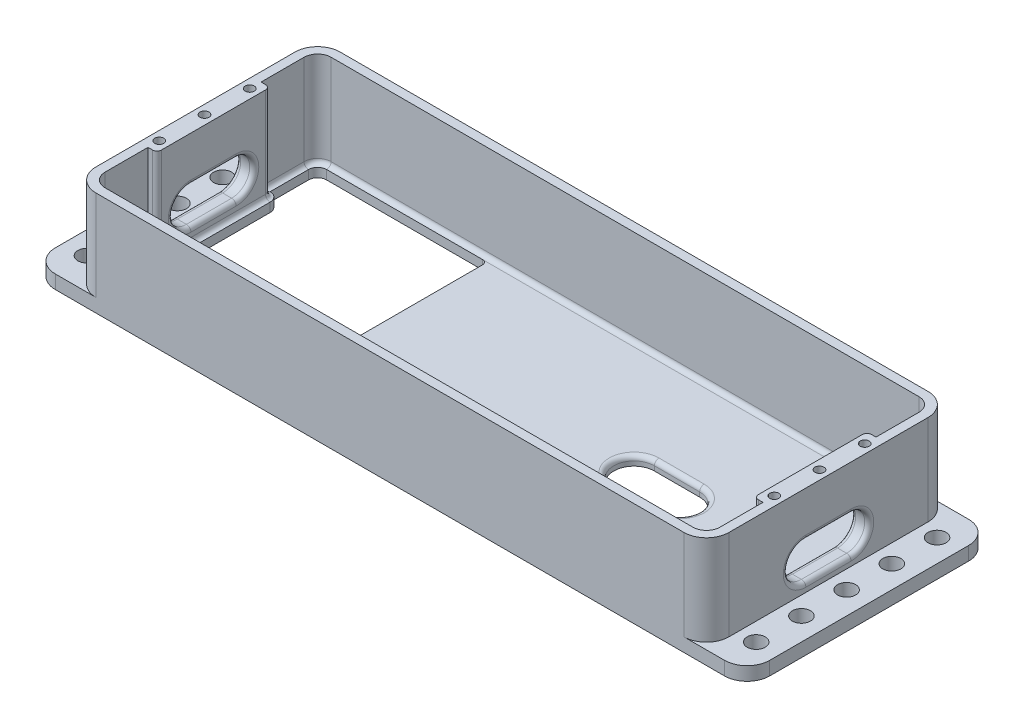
ISO-10303-21;
HEADER;
FILE_DESCRIPTION(('STEP AP214'),'2;1');
FILE_NAME('part.step','',(''),(''),'','','');
FILE_SCHEMA(('AUTOMOTIVE_DESIGN { 1 0 10303 214 1 1 1 1 }'));
ENDSEC;
DATA;
#1=APPLICATION_CONTEXT('core data for automotive mechanical design processes');
#2=APPLICATION_PROTOCOL_DEFINITION('international standard','automotive_design',2000,#1);
#3=PRODUCT_CONTEXT('',#1,'mechanical');
#4=PRODUCT('Part','Part','',(#3));
#5=PRODUCT_RELATED_PRODUCT_CATEGORY('part','',(#4));
#6=PRODUCT_DEFINITION_FORMATION('','',#4);
#7=PRODUCT_DEFINITION_CONTEXT('part definition',#1,'design');
#8=PRODUCT_DEFINITION('design','',#6,#7);
#9=PRODUCT_DEFINITION_SHAPE('','',#8);
#10=(LENGTH_UNIT() NAMED_UNIT(*) SI_UNIT(.MILLI.,.METRE.));
#11=(NAMED_UNIT(*) PLANE_ANGLE_UNIT() SI_UNIT($,.RADIAN.));
#12=(NAMED_UNIT(*) SI_UNIT($,.STERADIAN.) SOLID_ANGLE_UNIT());
#13=UNCERTAINTY_MEASURE_WITH_UNIT(LENGTH_MEASURE(1.E-05),#10,'distance_accuracy_value','');
#14=(GEOMETRIC_REPRESENTATION_CONTEXT(3) GLOBAL_UNCERTAINTY_ASSIGNED_CONTEXT((#13)) GLOBAL_UNIT_ASSIGNED_CONTEXT((#10,
#11,#12)) REPRESENTATION_CONTEXT('',''));
#15=CARTESIAN_POINT('',(0.,0.,0.));
#16=DIRECTION('',(0.,0.,1.));
#17=DIRECTION('',(1.,0.,0.));
#18=AXIS2_PLACEMENT_3D('',#15,#16,#17);
#19=CARTESIAN_POINT('',(0.,2.,0.));
#20=DIRECTION('',(0.,1.,0.));
#21=DIRECTION('',(0.,0.,1.));
#22=AXIS2_PLACEMENT_3D('',#19,#20,#21);
#23=PLANE('',#22);
#24=DIRECTION('',(-1.,0.,0.));
#25=VECTOR('',#24,1.);
#26=CARTESIAN_POINT('',(0.,2.,-5.5));
#27=LINE('',#26,#25);
#28=CARTESIAN_POINT('',(27.,2.,-5.5));
#29=VERTEX_POINT('',#28);
#30=CARTESIAN_POINT('',(37.,2.,-5.5));
#31=VERTEX_POINT('',#30);
#32=EDGE_CURVE('E182',#29,#31,#27,.F.);
#33=ORIENTED_EDGE('',*,*,#32,.T.);
#34=CARTESIAN_POINT('',(37.,2.,0.));
#35=DIRECTION('',(0.,1.,0.));
#36=DIRECTION('',(0.,0.,1.));
#37=AXIS2_PLACEMENT_3D('',#34,#35,#36);
#38=CIRCLE('',#37,5.5);
#39=CARTESIAN_POINT('',(37.,2.,5.5));
#40=VERTEX_POINT('',#39);
#41=EDGE_CURVE('E173',#31,#40,#38,.F.);
#42=ORIENTED_EDGE('',*,*,#41,.T.);
#43=DIRECTION('',(-1.,0.,0.));
#44=VECTOR('',#43,1.);
#45=CARTESIAN_POINT('',(27.,2.,5.5));
#46=LINE('',#45,#44);
#47=CARTESIAN_POINT('',(27.,2.,5.5));
#48=VERTEX_POINT('',#47);
#49=EDGE_CURVE('E176',#40,#48,#46,.T.);
#50=ORIENTED_EDGE('',*,*,#49,.T.);
#51=CARTESIAN_POINT('',(27.,2.,0.));
#52=DIRECTION('',(0.,1.,0.));
#53=DIRECTION('',(0.,0.,1.));
#54=AXIS2_PLACEMENT_3D('',#51,#52,#53);
#55=CIRCLE('',#54,5.5);
#56=EDGE_CURVE('E179',#48,#29,#55,.F.);
#57=ORIENTED_EDGE('',*,*,#56,.T.);
#58=EDGE_LOOP('',(#33,#42,#50,#57));
#59=FACE_BOUND('',#58,.T.);
#60=DIRECTION('',(-1.,0.,0.));
#61=VECTOR('',#60,1.);
#62=CARTESIAN_POINT('',(-65.,2.,-24.));
#63=LINE('',#62,#61);
#64=CARTESIAN_POINT('',(65.,2.,-24.));
#65=VERTEX_POINT('',#64);
#66=CARTESIAN_POINT('',(-30.5000000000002,2.,-24.));
#67=VERTEX_POINT('',#66);
#68=EDGE_CURVE('E84',#65,#67,#63,.T.);
#69=ORIENTED_EDGE('',*,*,#68,.T.);
#70=CARTESIAN_POINT('',(-30.5000000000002,2.,-23.));
#71=DIRECTION('',(0.,1.,0.));
#72=DIRECTION('',(0.,0.,1.));
#73=AXIS2_PLACEMENT_3D('',#70,#71,#72);
#74=CIRCLE('',#73,1.);
#75=CARTESIAN_POINT('',(-29.5000000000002,2.,-23.));
#76=VERTEX_POINT('',#75);
#77=EDGE_CURVE('E107',#67,#76,#74,.F.);
#78=ORIENTED_EDGE('',*,*,#77,.T.);
#79=DIRECTION('',(0.,0.,1.));
#80=VECTOR('',#79,1.);
#81=CARTESIAN_POINT('',(-29.5000000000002,2.,0.));
#82=LINE('',#81,#80);
#83=CARTESIAN_POINT('',(-29.5000000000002,2.,23.));
#84=VERTEX_POINT('',#83);
#85=EDGE_CURVE('E110',#76,#84,#82,.T.);
#86=ORIENTED_EDGE('',*,*,#85,.T.);
#87=CARTESIAN_POINT('',(-30.5000000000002,2.,23.));
#88=DIRECTION('',(0.,1.,0.));
#89=DIRECTION('',(0.,0.,1.));
#90=AXIS2_PLACEMENT_3D('',#87,#88,#89);
#91=CIRCLE('',#90,1.);
#92=CARTESIAN_POINT('',(-30.5000000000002,2.,24.));
#93=VERTEX_POINT('',#92);
#94=EDGE_CURVE('E55',#84,#93,#91,.F.);
#95=ORIENTED_EDGE('',*,*,#94,.T.);
#96=DIRECTION('',(1.,0.,0.));
#97=VECTOR('',#96,1.);
#98=CARTESIAN_POINT('',(65.,2.,24.));
#99=LINE('',#98,#97);
#100=CARTESIAN_POINT('',(65.,2.,24.));
#101=VERTEX_POINT('',#100);
#102=EDGE_CURVE('E62',#93,#101,#99,.T.);
#103=ORIENTED_EDGE('',*,*,#102,.T.);
#104=CARTESIAN_POINT('',(65.,2.,22.));
#105=DIRECTION('',(0.,1.,0.));
#106=DIRECTION('',(0.,0.,1.));
#107=AXIS2_PLACEMENT_3D('',#104,#105,#106);
#108=CIRCLE('',#107,2.);
#109=CARTESIAN_POINT('',(67.,2.,22.));
#110=VERTEX_POINT('',#109);
#111=EDGE_CURVE('E453',#101,#110,#108,.T.);
#112=ORIENTED_EDGE('',*,*,#111,.T.);
#113=DIRECTION('',(0.,0.,-1.));
#114=VECTOR('',#113,1.);
#115=CARTESIAN_POINT('',(67.,2.,12.5));
#116=LINE('',#115,#114);
#117=CARTESIAN_POINT('',(67.,2.,13.5));
#118=VERTEX_POINT('',#117);
#119=EDGE_CURVE('E455',#110,#118,#116,.T.);
#120=ORIENTED_EDGE('',*,*,#119,.T.);
#121=CARTESIAN_POINT('',(67.,2.,11.5));
#122=DIRECTION('',(0.,1.,0.));
#123=DIRECTION('',(0.,0.,1.));
#124=AXIS2_PLACEMENT_3D('',#121,#122,#123);
#125=CIRCLE('',#124,2.);
#126=CARTESIAN_POINT('',(65.,2.,11.5));
#127=VERTEX_POINT('',#126);
#128=EDGE_CURVE('E461',#118,#127,#125,.F.);
#129=ORIENTED_EDGE('',*,*,#128,.T.);
#130=DIRECTION('',(0.,0.,-1.));
#131=VECTOR('',#130,1.);
#132=CARTESIAN_POINT('',(65.,2.,-11.5));
#133=LINE('',#132,#131);
#134=CARTESIAN_POINT('',(65.,2.,-11.5));
#135=VERTEX_POINT('',#134);
#136=EDGE_CURVE('E464',#127,#135,#133,.T.);
#137=ORIENTED_EDGE('',*,*,#136,.T.);
#138=CARTESIAN_POINT('',(67.,2.,-11.5));
#139=DIRECTION('',(0.,1.,0.));
#140=DIRECTION('',(0.,0.,1.));
#141=AXIS2_PLACEMENT_3D('',#138,#139,#140);
#142=CIRCLE('',#141,2.);
#143=CARTESIAN_POINT('',(67.,2.,-13.5));
#144=VERTEX_POINT('',#143);
#145=EDGE_CURVE('E470',#135,#144,#142,.F.);
#146=ORIENTED_EDGE('',*,*,#145,.T.);
#147=DIRECTION('',(0.,0.,-1.));
#148=VECTOR('',#147,1.);
#149=CARTESIAN_POINT('',(67.,2.,-22.));
#150=LINE('',#149,#148);
#151=CARTESIAN_POINT('',(67.,2.,-22.));
#152=VERTEX_POINT('',#151);
#153=EDGE_CURVE('E476',#144,#152,#150,.T.);
#154=ORIENTED_EDGE('',*,*,#153,.T.);
#155=CARTESIAN_POINT('',(65.,2.,-22.));
#156=DIRECTION('',(0.,1.,0.));
#157=DIRECTION('',(0.,0.,1.));
#158=AXIS2_PLACEMENT_3D('',#155,#156,#157);
#159=CIRCLE('',#158,2.);
#160=EDGE_CURVE('E479',#152,#65,#159,.T.);
#161=ORIENTED_EDGE('',*,*,#160,.T.);
#162=EDGE_LOOP('',(#69,#78,#86,#95,#103,#112,#120,#129,#137,#146,#154,#161));
#163=FACE_BOUND('',#162,.T.);
#164=ADVANCED_FACE('F47',(#59,#163),#23,.T.);
#165=CARTESIAN_POINT('',(0.,23.,0.));
#166=DIRECTION('',(0.,-1.,0.));
#167=DIRECTION('',(0.,0.,-1.));
#168=AXIS2_PLACEMENT_3D('',#165,#166,#167);
#169=PLANE('',#168);
#170=CARTESIAN_POINT('',(-68.,23.,0.));
#171=DIRECTION('',(0.,1.,0.));
#172=DIRECTION('',(0.,0.,1.));
#173=AXIS2_PLACEMENT_3D('',#170,#171,#172);
#174=CIRCLE('',#173,0.999999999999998);
#175=CARTESIAN_POINT('',(-68.,23.,1.00000000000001));
#176=VERTEX_POINT('',#175);
#177=EDGE_CURVE('E834',#176,#176,#174,.T.);
#178=ORIENTED_EDGE('',*,*,#177,.F.);
#179=EDGE_LOOP('',(#178));
#180=FACE_BOUND('',#179,.T.);
#181=CARTESIAN_POINT('',(-68.,23.,10.));
#182=DIRECTION('',(0.,1.,0.));
#183=DIRECTION('',(0.,0.,1.));
#184=AXIS2_PLACEMENT_3D('',#181,#182,#183);
#185=CIRCLE('',#184,0.999999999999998);
#186=CARTESIAN_POINT('',(-68.,23.,11.));
#187=VERTEX_POINT('',#186);
#188=EDGE_CURVE('E853',#187,#187,#185,.T.);
#189=ORIENTED_EDGE('',*,*,#188,.F.);
#190=EDGE_LOOP('',(#189));
#191=FACE_BOUND('',#190,.T.);
#192=CARTESIAN_POINT('',(-68.,23.,-10.));
#193=DIRECTION('',(0.,1.,0.));
#194=DIRECTION('',(0.,0.,1.));
#195=AXIS2_PLACEMENT_3D('',#192,#193,#194);
#196=CIRCLE('',#195,0.999999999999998);
#197=CARTESIAN_POINT('',(-68.,23.,-9.));
#198=VERTEX_POINT('',#197);
#199=EDGE_CURVE('E831',#198,#198,#196,.T.);
#200=ORIENTED_EDGE('',*,*,#199,.F.);
#201=EDGE_LOOP('',(#200));
#202=FACE_BOUND('',#201,.T.);
#203=DIRECTION('',(1.,0.,0.));
#204=VECTOR('',#203,1.);
#205=CARTESIAN_POINT('',(-70.,23.,-27.));
#206=LINE('',#205,#204);
#207=CARTESIAN_POINT('',(-65.,23.,-27.));
#208=VERTEX_POINT('',#207);
#209=CARTESIAN_POINT('',(65.,23.,-27.));
#210=VERTEX_POINT('',#209);
#211=EDGE_CURVE('E746',#208,#210,#206,.T.);
#212=ORIENTED_EDGE('',*,*,#211,.F.);
#213=CARTESIAN_POINT('',(-65.,23.,-22.));
#214=DIRECTION('',(0.,-1.,0.));
#215=DIRECTION('',(0.,0.,-1.));
#216=AXIS2_PLACEMENT_3D('',#213,#214,#215);
#217=CIRCLE('',#216,5.);
#218=CARTESIAN_POINT('',(-70.,23.,-22.));
#219=VERTEX_POINT('',#218);
#220=EDGE_CURVE('E550',#208,#219,#217,.F.);
#221=ORIENTED_EDGE('',*,*,#220,.T.);
#222=DIRECTION('',(0.,0.,-1.));
#223=VECTOR('',#222,1.);
#224=CARTESIAN_POINT('',(-70.,23.,27.));
#225=LINE('',#224,#223);
#226=CARTESIAN_POINT('',(-70.,23.,22.));
#227=VERTEX_POINT('',#226);
#228=EDGE_CURVE('E736',#227,#219,#225,.T.);
#229=ORIENTED_EDGE('',*,*,#228,.F.);
#230=CARTESIAN_POINT('',(-65.,23.,22.));
#231=DIRECTION('',(0.,-1.,0.));
#232=DIRECTION('',(0.,0.,-1.));
#233=AXIS2_PLACEMENT_3D('',#230,#231,#232);
#234=CIRCLE('',#233,5.);
#235=CARTESIAN_POINT('',(-65.,23.,27.));
#236=VERTEX_POINT('',#235);
#237=EDGE_CURVE('E559',#227,#236,#234,.F.);
#238=ORIENTED_EDGE('',*,*,#237,.T.);
#239=DIRECTION('',(1.,0.,0.));
#240=VECTOR('',#239,1.);
#241=CARTESIAN_POINT('',(-70.,23.,27.));
#242=LINE('',#241,#240);
#243=CARTESIAN_POINT('',(65.,23.,27.));
#244=VERTEX_POINT('',#243);
#245=EDGE_CURVE('E725',#236,#244,#242,.T.);
#246=ORIENTED_EDGE('',*,*,#245,.T.);
#247=CARTESIAN_POINT('',(65.,23.,22.));
#248=DIRECTION('',(0.,-1.,0.));
#249=DIRECTION('',(0.,0.,-1.));
#250=AXIS2_PLACEMENT_3D('',#247,#248,#249);
#251=CIRCLE('',#250,5.);
#252=CARTESIAN_POINT('',(70.,23.,22.));
#253=VERTEX_POINT('',#252);
#254=EDGE_CURVE('E556',#244,#253,#251,.F.);
#255=ORIENTED_EDGE('',*,*,#254,.T.);
#256=DIRECTION('',(0.,0.,-1.));
#257=VECTOR('',#256,1.);
#258=CARTESIAN_POINT('',(70.,23.,27.));
#259=LINE('',#258,#257);
#260=CARTESIAN_POINT('',(70.,23.,-22.));
#261=VERTEX_POINT('',#260);
#262=EDGE_CURVE('E743',#253,#261,#259,.T.);
#263=ORIENTED_EDGE('',*,*,#262,.T.);
#264=CARTESIAN_POINT('',(65.,23.,-22.));
#265=DIRECTION('',(0.,-1.,0.));
#266=DIRECTION('',(0.,0.,-1.));
#267=AXIS2_PLACEMENT_3D('',#264,#265,#266);
#268=CIRCLE('',#267,5.);
#269=EDGE_CURVE('E553',#261,#210,#268,.F.);
#270=ORIENTED_EDGE('',*,*,#269,.T.);
#271=EDGE_LOOP('',(#212,#221,#229,#238,#246,#255,#263,#270));
#272=FACE_BOUND('',#271,.T.);
#273=DIRECTION('',(-1.,0.,0.));
#274=VECTOR('',#273,1.);
#275=CARTESIAN_POINT('',(0.,23.,-12.5));
#276=LINE('',#275,#274);
#277=CARTESIAN_POINT('',(68.,23.,-12.5));
#278=VERTEX_POINT('',#277);
#279=CARTESIAN_POINT('',(67.,23.,-12.5));
#280=VERTEX_POINT('',#279);
#281=EDGE_CURVE('E813',#278,#280,#276,.T.);
#282=ORIENTED_EDGE('',*,*,#281,.T.);
#283=CARTESIAN_POINT('',(67.,23.,-11.5));
#284=DIRECTION('',(0.,-1.,0.));
#285=DIRECTION('',(0.,0.,-1.));
#286=AXIS2_PLACEMENT_3D('',#283,#284,#285);
#287=CIRCLE('',#286,1.);
#288=CARTESIAN_POINT('',(66.,23.,-11.5));
#289=VERTEX_POINT('',#288);
#290=EDGE_CURVE('E511',#280,#289,#287,.F.);
#291=ORIENTED_EDGE('',*,*,#290,.T.);
#292=DIRECTION('',(0.,0.,1.));
#293=VECTOR('',#292,1.);
#294=CARTESIAN_POINT('',(66.,23.,0.));
#295=LINE('',#294,#293);
#296=CARTESIAN_POINT('',(66.,23.,11.5));
#297=VERTEX_POINT('',#296);
#298=EDGE_CURVE('E810',#289,#297,#295,.T.);
#299=ORIENTED_EDGE('',*,*,#298,.T.);
#300=CARTESIAN_POINT('',(67.,23.,11.5));
#301=DIRECTION('',(0.,-1.,0.));
#302=DIRECTION('',(0.,0.,-1.));
#303=AXIS2_PLACEMENT_3D('',#300,#301,#302);
#304=CIRCLE('',#303,1.);
#305=CARTESIAN_POINT('',(67.,23.,12.5));
#306=VERTEX_POINT('',#305);
#307=EDGE_CURVE('E514',#297,#306,#304,.F.);
#308=ORIENTED_EDGE('',*,*,#307,.T.);
#309=DIRECTION('',(-1.,0.,0.));
#310=VECTOR('',#309,1.);
#311=CARTESIAN_POINT('',(0.,23.,12.5));
#312=LINE('',#311,#310);
#313=CARTESIAN_POINT('',(68.,23.,12.5));
#314=VERTEX_POINT('',#313);
#315=EDGE_CURVE('E804',#314,#306,#312,.T.);
#316=ORIENTED_EDGE('',*,*,#315,.F.);
#317=DIRECTION('',(0.,0.,-1.));
#318=VECTOR('',#317,1.);
#319=CARTESIAN_POINT('',(68.,23.,0.));
#320=LINE('',#319,#318);
#321=CARTESIAN_POINT('',(68.,23.,22.));
#322=VERTEX_POINT('',#321);
#323=EDGE_CURVE('E756',#322,#314,#320,.T.);
#324=ORIENTED_EDGE('',*,*,#323,.F.);
#325=CARTESIAN_POINT('',(65.,23.,22.));
#326=DIRECTION('',(0.,-1.,0.));
#327=DIRECTION('',(0.,0.,-1.));
#328=AXIS2_PLACEMENT_3D('',#325,#326,#327);
#329=CIRCLE('',#328,3.);
#330=CARTESIAN_POINT('',(65.,23.,25.));
#331=VERTEX_POINT('',#330);
#332=EDGE_CURVE('E755',#331,#322,#329,.F.);
#333=ORIENTED_EDGE('',*,*,#332,.F.);
#334=DIRECTION('',(1.,0.,0.));
#335=VECTOR('',#334,1.);
#336=CARTESIAN_POINT('',(0.,23.,25.));
#337=LINE('',#336,#335);
#338=CARTESIAN_POINT('',(-65.,23.,25.));
#339=VERTEX_POINT('',#338);
#340=EDGE_CURVE('E759',#339,#331,#337,.T.);
#341=ORIENTED_EDGE('',*,*,#340,.F.);
#342=CARTESIAN_POINT('',(-65.,23.,22.));
#343=DIRECTION('',(0.,-1.,0.));
#344=DIRECTION('',(0.,0.,-1.));
#345=AXIS2_PLACEMENT_3D('',#342,#343,#344);
#346=CIRCLE('',#345,3.);
#347=CARTESIAN_POINT('',(-68.,23.,22.));
#348=VERTEX_POINT('',#347);
#349=EDGE_CURVE('E763',#348,#339,#346,.F.);
#350=ORIENTED_EDGE('',*,*,#349,.F.);
#351=DIRECTION('',(0.,0.,-1.));
#352=VECTOR('',#351,1.);
#353=CARTESIAN_POINT('',(-68.,23.,0.));
#354=LINE('',#353,#352);
#355=CARTESIAN_POINT('',(-68.,23.,12.5));
#356=VERTEX_POINT('',#355);
#357=EDGE_CURVE('E770',#348,#356,#354,.T.);
#358=ORIENTED_EDGE('',*,*,#357,.T.);
#359=DIRECTION('',(1.,0.,0.));
#360=VECTOR('',#359,1.);
#361=CARTESIAN_POINT('',(0.,23.,12.5));
#362=LINE('',#361,#360);
#363=CARTESIAN_POINT('',(-67.,23.,12.5));
#364=VERTEX_POINT('',#363);
#365=EDGE_CURVE('E821',#356,#364,#362,.T.);
#366=ORIENTED_EDGE('',*,*,#365,.T.);
#367=CARTESIAN_POINT('',(-67.,23.,11.5));
#368=DIRECTION('',(0.,-1.,0.));
#369=DIRECTION('',(0.,0.,-1.));
#370=AXIS2_PLACEMENT_3D('',#367,#368,#369);
#371=CIRCLE('',#370,1.);
#372=CARTESIAN_POINT('',(-66.,23.,11.5));
#373=VERTEX_POINT('',#372);
#374=EDGE_CURVE('E517',#364,#373,#371,.F.);
#375=ORIENTED_EDGE('',*,*,#374,.T.);
#376=DIRECTION('',(0.,0.,1.));
#377=VECTOR('',#376,1.);
#378=CARTESIAN_POINT('',(-66.,23.,0.));
#379=LINE('',#378,#377);
#380=CARTESIAN_POINT('',(-66.,23.,-11.5));
#381=VERTEX_POINT('',#380);
#382=EDGE_CURVE('E807',#381,#373,#379,.T.);
#383=ORIENTED_EDGE('',*,*,#382,.F.);
#384=CARTESIAN_POINT('',(-67.,23.,-11.5));
#385=DIRECTION('',(0.,-1.,0.));
#386=DIRECTION('',(0.,0.,-1.));
#387=AXIS2_PLACEMENT_3D('',#384,#385,#386);
#388=CIRCLE('',#387,1.);
#389=CARTESIAN_POINT('',(-67.,23.,-12.5));
#390=VERTEX_POINT('',#389);
#391=EDGE_CURVE('E520',#381,#390,#388,.F.);
#392=ORIENTED_EDGE('',*,*,#391,.T.);
#393=DIRECTION('',(1.,0.,0.));
#394=VECTOR('',#393,1.);
#395=CARTESIAN_POINT('',(0.,23.,-12.5));
#396=LINE('',#395,#394);
#397=CARTESIAN_POINT('',(-68.,23.,-12.5));
#398=VERTEX_POINT('',#397);
#399=EDGE_CURVE('E826',#398,#390,#396,.T.);
#400=ORIENTED_EDGE('',*,*,#399,.F.);
#401=CARTESIAN_POINT('',(-68.,23.,-22.));
#402=VERTEX_POINT('',#401);
#403=EDGE_CURVE('E774',#398,#402,#354,.T.);
#404=ORIENTED_EDGE('',*,*,#403,.T.);
#405=CARTESIAN_POINT('',(-65.,23.,-22.));
#406=DIRECTION('',(0.,-1.,0.));
#407=DIRECTION('',(0.,0.,-1.));
#408=AXIS2_PLACEMENT_3D('',#405,#406,#407);
#409=CIRCLE('',#408,3.);
#410=CARTESIAN_POINT('',(-65.,23.,-25.));
#411=VERTEX_POINT('',#410);
#412=EDGE_CURVE('E754',#411,#402,#409,.F.);
#413=ORIENTED_EDGE('',*,*,#412,.F.);
#414=DIRECTION('',(1.,0.,0.));
#415=VECTOR('',#414,1.);
#416=CARTESIAN_POINT('',(-79.,23.,-25.));
#417=LINE('',#416,#415);
#418=CARTESIAN_POINT('',(65.,23.,-25.));
#419=VERTEX_POINT('',#418);
#420=EDGE_CURVE('E773',#411,#419,#417,.T.);
#421=ORIENTED_EDGE('',*,*,#420,.T.);
#422=CARTESIAN_POINT('',(65.,23.,-22.));
#423=DIRECTION('',(0.,-1.,0.));
#424=DIRECTION('',(0.,0.,-1.));
#425=AXIS2_PLACEMENT_3D('',#422,#423,#424);
#426=CIRCLE('',#425,3.);
#427=CARTESIAN_POINT('',(68.,23.,-22.));
#428=VERTEX_POINT('',#427);
#429=EDGE_CURVE('E751',#428,#419,#426,.F.);
#430=ORIENTED_EDGE('',*,*,#429,.F.);
#431=EDGE_CURVE('E760',#278,#428,#320,.T.);
#432=ORIENTED_EDGE('',*,*,#431,.F.);
#433=EDGE_LOOP('',(#282,#291,#299,#308,#316,#324,#333,#341,#350,#358,#366,#375,#383,#392,#400,
#404,#413,#421,#430,#432));
#434=FACE_BOUND('',#433,.T.);
#435=CARTESIAN_POINT('',(68.0000000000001,23.,9.99999999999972));
#436=DIRECTION('',(0.,-1.,0.));
#437=DIRECTION('',(0.,0.,-1.));
#438=AXIS2_PLACEMENT_3D('',#435,#436,#437);
#439=CIRCLE('',#438,0.999999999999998);
#440=CARTESIAN_POINT('',(68.0000000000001,23.,8.99999999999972));
#441=VERTEX_POINT('',#440);
#442=EDGE_CURVE('E841',#441,#441,#439,.T.);
#443=ORIENTED_EDGE('',*,*,#442,.T.);
#444=EDGE_LOOP('',(#443));
#445=FACE_BOUND('',#444,.T.);
#446=CARTESIAN_POINT('',(68.0000000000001,23.,-2.61943244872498E-13));
#447=DIRECTION('',(0.,-1.,0.));
#448=DIRECTION('',(0.,0.,-1.));
#449=AXIS2_PLACEMENT_3D('',#446,#447,#448);
#450=CIRCLE('',#449,0.999999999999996);
#451=CARTESIAN_POINT('',(68.0000000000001,23.,-1.00000000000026));
#452=VERTEX_POINT('',#451);
#453=EDGE_CURVE('E840',#452,#452,#450,.T.);
#454=ORIENTED_EDGE('',*,*,#453,.T.);
#455=EDGE_LOOP('',(#454));
#456=FACE_BOUND('',#455,.T.);
#457=CARTESIAN_POINT('',(68.,23.,-10.0000000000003));
#458=DIRECTION('',(0.,-1.,0.));
#459=DIRECTION('',(0.,0.,-1.));
#460=AXIS2_PLACEMENT_3D('',#457,#458,#459);
#461=CIRCLE('',#460,0.999999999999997);
#462=CARTESIAN_POINT('',(68.,23.,-11.0000000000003));
#463=VERTEX_POINT('',#462);
#464=EDGE_CURVE('E847',#463,#463,#461,.T.);
#465=ORIENTED_EDGE('',*,*,#464,.T.);
#466=EDGE_LOOP('',(#465));
#467=FACE_BOUND('',#466,.T.);
#468=ADVANCED_FACE('F1320',(#180,#191,#202,#272,#434,#445,#456,#467),#169,.F.);
#469=CARTESIAN_POINT('',(68.,23.,27.));
#470=DIRECTION('',(-1.,0.,0.));
#471=DIRECTION('',(0.,0.,1.));
#472=AXIS2_PLACEMENT_3D('',#469,#470,#471);
#473=PLANE('',#472);
#474=DIRECTION('',(0.,1.,0.));
#475=VECTOR('',#474,1.);
#476=CARTESIAN_POINT('',(68.,-23.0798724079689,12.5));
#477=LINE('',#476,#475);
#478=CARTESIAN_POINT('',(68.,2.99999999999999,12.5));
#479=VERTEX_POINT('',#478);
#480=EDGE_CURVE('E803',#479,#314,#477,.T.);
#481=ORIENTED_EDGE('',*,*,#480,.F.);
#482=DIRECTION('',(0.,0.,-1.));
#483=VECTOR('',#482,1.);
#484=CARTESIAN_POINT('',(68.,3.,22.));
#485=LINE('',#484,#483);
#486=CARTESIAN_POINT('',(68.,3.,22.));
#487=VERTEX_POINT('',#486);
#488=EDGE_CURVE('E394',#479,#487,#485,.F.);
#489=ORIENTED_EDGE('',*,*,#488,.T.);
#490=DIRECTION('',(0.,1.,0.));
#491=VECTOR('',#490,1.);
#492=CARTESIAN_POINT('',(68.,23.,22.));
#493=LINE('',#492,#491);
#494=EDGE_CURVE('E777',#322,#487,#493,.F.);
#495=ORIENTED_EDGE('',*,*,#494,.F.);
#496=ORIENTED_EDGE('',*,*,#323,.T.);
#497=EDGE_LOOP('',(#481,#489,#495,#496));
#498=FACE_BOUND('',#497,.T.);
#499=ADVANCED_FACE('F1327',(#498),#473,.T.);
#500=CARTESIAN_POINT('',(-68.,23.,27.));
#501=DIRECTION('',(-1.,0.,0.));
#502=DIRECTION('',(0.,0.,1.));
#503=AXIS2_PLACEMENT_3D('',#500,#501,#502);
#504=PLANE('',#503);
#505=DIRECTION('',(0.,1.,0.));
#506=VECTOR('',#505,1.);
#507=CARTESIAN_POINT('',(-68.,-23.0798724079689,-12.5));
#508=LINE('',#507,#506);
#509=CARTESIAN_POINT('',(-68.,2.99999999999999,-12.5));
#510=VERTEX_POINT('',#509);
#511=EDGE_CURVE('E817',#510,#398,#508,.T.);
#512=ORIENTED_EDGE('',*,*,#511,.F.);
#513=DIRECTION('',(0.,0.,1.));
#514=VECTOR('',#513,1.);
#515=CARTESIAN_POINT('',(-68.,3.,27.));
#516=LINE('',#515,#514);
#517=CARTESIAN_POINT('',(-68.,3.,-22.));
#518=VERTEX_POINT('',#517);
#519=EDGE_CURVE('E403',#510,#518,#516,.F.);
#520=ORIENTED_EDGE('',*,*,#519,.T.);
#521=DIRECTION('',(0.,1.,0.));
#522=VECTOR('',#521,1.);
#523=CARTESIAN_POINT('',(-68.,23.,-22.));
#524=LINE('',#523,#522);
#525=EDGE_CURVE('E780',#402,#518,#524,.F.);
#526=ORIENTED_EDGE('',*,*,#525,.F.);
#527=ORIENTED_EDGE('',*,*,#403,.F.);
#528=EDGE_LOOP('',(#512,#520,#526,#527));
#529=FACE_BOUND('',#528,.T.);
#530=ADVANCED_FACE('F1352',(#529),#504,.F.);
#531=CARTESIAN_POINT('',(0.,-12.,4.5));
#532=DIRECTION('',(0.,0.,1.));
#533=DIRECTION('',(1.,0.,0.));
#534=AXIS2_PLACEMENT_3D('',#531,#532,#533);
#535=PLANE('',#534);
#536=DIRECTION('',(0.,1.,0.));
#537=VECTOR('',#536,1.);
#538=CARTESIAN_POINT('',(27.,-12.,4.5));
#539=LINE('',#538,#537);
#540=CARTESIAN_POINT('',(27.,0.,4.5));
#541=VERTEX_POINT('',#540);
#542=CARTESIAN_POINT('',(27.,1.,4.5));
#543=VERTEX_POINT('',#542);
#544=EDGE_CURVE('E698',#541,#543,#539,.T.);
#545=ORIENTED_EDGE('',*,*,#544,.T.);
#546=DIRECTION('',(-1.,0.,0.));
#547=VECTOR('',#546,1.);
#548=CARTESIAN_POINT('',(37.,1.,4.5));
#549=LINE('',#548,#547);
#550=CARTESIAN_POINT('',(37.,1.,4.5));
#551=VERTEX_POINT('',#550);
#552=EDGE_CURVE('E167',#543,#551,#549,.F.);
#553=ORIENTED_EDGE('',*,*,#552,.T.);
#554=DIRECTION('',(0.,1.,0.));
#555=VECTOR('',#554,1.);
#556=CARTESIAN_POINT('',(37.,-12.,4.5));
#557=LINE('',#556,#555);
#558=CARTESIAN_POINT('',(37.,0.,4.5));
#559=VERTEX_POINT('',#558);
#560=EDGE_CURVE('E721',#559,#551,#557,.T.);
#561=ORIENTED_EDGE('',*,*,#560,.F.);
#562=DIRECTION('',(1.,0.,0.));
#563=VECTOR('',#562,1.);
#564=CARTESIAN_POINT('',(0.,0.,4.5));
#565=LINE('',#564,#563);
#566=EDGE_CURVE('E574',#541,#559,#565,.T.);
#567=ORIENTED_EDGE('',*,*,#566,.F.);
#568=EDGE_LOOP('',(#545,#553,#561,#567));
#569=FACE_BOUND('',#568,.T.);
#570=ADVANCED_FACE('F1254',(#569),#535,.F.);
#571=CARTESIAN_POINT('',(27.,-12.,0.));
#572=DIRECTION('',(0.,1.,0.));
#573=DIRECTION('',(0.,0.,1.));
#574=AXIS2_PLACEMENT_3D('',#571,#572,#573);
#575=CYLINDRICAL_SURFACE('',#574,4.5);
#576=DIRECTION('',(0.,1.,0.));
#577=VECTOR('',#576,1.);
#578=CARTESIAN_POINT('',(27.,-12.,-4.5));
#579=LINE('',#578,#577);
#580=CARTESIAN_POINT('',(27.,0.,-4.5));
#581=VERTEX_POINT('',#580);
#582=CARTESIAN_POINT('',(27.,1.,-4.5));
#583=VERTEX_POINT('',#582);
#584=EDGE_CURVE('E728',#581,#583,#579,.T.);
#585=ORIENTED_EDGE('',*,*,#584,.T.);
#586=CARTESIAN_POINT('',(27.,1.,0.));
#587=DIRECTION('',(0.,1.,0.));
#588=DIRECTION('',(0.,0.,1.));
#589=AXIS2_PLACEMENT_3D('',#586,#587,#588);
#590=CIRCLE('',#589,4.5);
#591=EDGE_CURVE('E148',#583,#543,#590,.T.);
#592=ORIENTED_EDGE('',*,*,#591,.T.);
#593=ORIENTED_EDGE('',*,*,#544,.F.);
#594=CARTESIAN_POINT('',(27.,0.,0.));
#595=DIRECTION('',(0.,1.,0.));
#596=DIRECTION('',(0.,0.,1.));
#597=AXIS2_PLACEMENT_3D('',#594,#595,#596);
#598=CIRCLE('',#597,4.5);
#599=EDGE_CURVE('E577',#581,#541,#598,.T.);
#600=ORIENTED_EDGE('',*,*,#599,.F.);
#601=EDGE_LOOP('',(#585,#592,#593,#600));
#602=FACE_BOUND('',#601,.T.);
#603=ADVANCED_FACE('F1248',(#602),#575,.F.);
#604=CARTESIAN_POINT('',(0.,-12.,-4.5));
#605=DIRECTION('',(0.,0.,1.));
#606=DIRECTION('',(1.,0.,0.));
#607=AXIS2_PLACEMENT_3D('',#604,#605,#606);
#608=PLANE('',#607);
#609=DIRECTION('',(0.,1.,0.));
#610=VECTOR('',#609,1.);
#611=CARTESIAN_POINT('',(37.,-12.,-4.5));
#612=LINE('',#611,#610);
#613=CARTESIAN_POINT('',(37.,0.,-4.5));
#614=VERTEX_POINT('',#613);
#615=CARTESIAN_POINT('',(37.,1.,-4.5));
#616=VERTEX_POINT('',#615);
#617=EDGE_CURVE('E724',#614,#616,#612,.T.);
#618=ORIENTED_EDGE('',*,*,#617,.T.);
#619=DIRECTION('',(-1.,0.,0.));
#620=VECTOR('',#619,1.);
#621=CARTESIAN_POINT('',(0.,1.,-4.5));
#622=LINE('',#621,#620);
#623=EDGE_CURVE('E146',#616,#583,#622,.T.);
#624=ORIENTED_EDGE('',*,*,#623,.T.);
#625=ORIENTED_EDGE('',*,*,#584,.F.);
#626=DIRECTION('',(1.,0.,0.));
#627=VECTOR('',#626,1.);
#628=CARTESIAN_POINT('',(0.,0.,-4.5));
#629=LINE('',#628,#627);
#630=EDGE_CURVE('E580',#581,#614,#629,.T.);
#631=ORIENTED_EDGE('',*,*,#630,.T.);
#632=EDGE_LOOP('',(#618,#624,#625,#631));
#633=FACE_BOUND('',#632,.T.);
#634=ADVANCED_FACE('F1272',(#633),#608,.T.);
#635=CARTESIAN_POINT('',(37.,-12.,0.));
#636=DIRECTION('',(0.,1.,0.));
#637=DIRECTION('',(0.,0.,1.));
#638=AXIS2_PLACEMENT_3D('',#635,#636,#637);
#639=CYLINDRICAL_SURFACE('',#638,4.5);
#640=ORIENTED_EDGE('',*,*,#560,.T.);
#641=CARTESIAN_POINT('',(37.,1.,0.));
#642=DIRECTION('',(0.,1.,0.));
#643=DIRECTION('',(0.,0.,1.));
#644=AXIS2_PLACEMENT_3D('',#641,#642,#643);
#645=CIRCLE('',#644,4.5);
#646=EDGE_CURVE('E170',#551,#616,#645,.T.);
#647=ORIENTED_EDGE('',*,*,#646,.T.);
#648=ORIENTED_EDGE('',*,*,#617,.F.);
#649=CARTESIAN_POINT('',(37.,0.,0.));
#650=DIRECTION('',(0.,1.,0.));
#651=DIRECTION('',(0.,0.,1.));
#652=AXIS2_PLACEMENT_3D('',#649,#650,#651);
#653=CIRCLE('',#652,4.5);
#654=EDGE_CURVE('E583',#559,#614,#653,.T.);
#655=ORIENTED_EDGE('',*,*,#654,.F.);
#656=EDGE_LOOP('',(#640,#647,#648,#655));
#657=FACE_BOUND('',#656,.T.);
#658=ADVANCED_FACE('F1270',(#657),#639,.F.);
#659=CARTESIAN_POINT('',(0.,3.,0.));
#660=DIRECTION('',(0.,1.,0.));
#661=DIRECTION('',(0.,0.,1.));
#662=AXIS2_PLACEMENT_3D('',#659,#660,#661);
#663=PLANE('',#662);
#664=CARTESIAN_POINT('',(-74.,3.,20.));
#665=DIRECTION('',(0.,1.,0.));
#666=DIRECTION('',(0.,0.,1.));
#667=AXIS2_PLACEMENT_3D('',#664,#665,#666);
#668=CIRCLE('',#667,2.);
#669=CARTESIAN_POINT('',(-74.,3.,22.));
#670=VERTEX_POINT('',#669);
#671=EDGE_CURVE('E707',#670,#670,#668,.T.);
#672=ORIENTED_EDGE('',*,*,#671,.F.);
#673=EDGE_LOOP('',(#672));
#674=FACE_BOUND('',#673,.T.);
#675=CARTESIAN_POINT('',(-74.,3.,10.));
#676=DIRECTION('',(0.,1.,0.));
#677=DIRECTION('',(0.,0.,1.));
#678=AXIS2_PLACEMENT_3D('',#675,#676,#677);
#679=CIRCLE('',#678,2.);
#680=CARTESIAN_POINT('',(-74.,3.,12.));
#681=VERTEX_POINT('',#680);
#682=EDGE_CURVE('E704',#681,#681,#679,.T.);
#683=ORIENTED_EDGE('',*,*,#682,.F.);
#684=EDGE_LOOP('',(#683));
#685=FACE_BOUND('',#684,.T.);
#686=CARTESIAN_POINT('',(-74.,3.,0.));
#687=DIRECTION('',(0.,1.,0.));
#688=DIRECTION('',(0.,0.,1.));
#689=AXIS2_PLACEMENT_3D('',#686,#687,#688);
#690=CIRCLE('',#689,2.);
#691=CARTESIAN_POINT('',(-74.,3.,2.));
#692=VERTEX_POINT('',#691);
#693=EDGE_CURVE('E701',#692,#692,#690,.T.);
#694=ORIENTED_EDGE('',*,*,#693,.F.);
#695=EDGE_LOOP('',(#694));
#696=FACE_BOUND('',#695,.T.);
#697=CARTESIAN_POINT('',(-74.0000000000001,3.,-10.));
#698=DIRECTION('',(0.,1.,0.));
#699=DIRECTION('',(0.,0.,1.));
#700=AXIS2_PLACEMENT_3D('',#697,#698,#699);
#701=CIRCLE('',#700,2.);
#702=CARTESIAN_POINT('',(-74.0000000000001,3.,-8.));
#703=VERTEX_POINT('',#702);
#704=EDGE_CURVE('E697',#703,#703,#701,.T.);
#705=ORIENTED_EDGE('',*,*,#704,.F.);
#706=EDGE_LOOP('',(#705));
#707=FACE_BOUND('',#706,.T.);
#708=CARTESIAN_POINT('',(-74.0000000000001,3.,-20.));
#709=DIRECTION('',(0.,1.,0.));
#710=DIRECTION('',(0.,0.,1.));
#711=AXIS2_PLACEMENT_3D('',#708,#709,#710);
#712=CIRCLE('',#711,2.);
#713=CARTESIAN_POINT('',(-74.0000000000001,3.,-18.));
#714=VERTEX_POINT('',#713);
#715=EDGE_CURVE('E694',#714,#714,#712,.T.);
#716=ORIENTED_EDGE('',*,*,#715,.F.);
#717=EDGE_LOOP('',(#716));
#718=FACE_BOUND('',#717,.T.);
#719=DIRECTION('',(1.,0.,0.));
#720=VECTOR('',#719,1.);
#721=CARTESIAN_POINT('',(-79.,3.,27.));
#722=LINE('',#721,#720);
#723=CARTESIAN_POINT('',(-74.,3.,27.));
#724=VERTEX_POINT('',#723);
#725=CARTESIAN_POINT('',(-65.,3.,27.));
#726=VERTEX_POINT('',#725);
#727=EDGE_CURVE('E634',#724,#726,#722,.T.);
#728=ORIENTED_EDGE('',*,*,#727,.T.);
#729=CARTESIAN_POINT('',(-65.,3.,22.));
#730=DIRECTION('',(0.,1.,0.));
#731=DIRECTION('',(0.,0.,1.));
#732=AXIS2_PLACEMENT_3D('',#729,#730,#731);
#733=CIRCLE('',#732,5.);
#734=CARTESIAN_POINT('',(-70.,3.,22.));
#735=VERTEX_POINT('',#734);
#736=EDGE_CURVE('E526',#726,#735,#733,.F.);
#737=ORIENTED_EDGE('',*,*,#736,.T.);
#738=DIRECTION('',(0.,0.,-1.));
#739=VECTOR('',#738,1.);
#740=CARTESIAN_POINT('',(-70.,3.,27.));
#741=LINE('',#740,#739);
#742=CARTESIAN_POINT('',(-70.,3.,-22.));
#743=VERTEX_POINT('',#742);
#744=EDGE_CURVE('E737',#735,#743,#741,.T.);
#745=ORIENTED_EDGE('',*,*,#744,.T.);
#746=CARTESIAN_POINT('',(-65.,3.,-22.));
#747=DIRECTION('',(0.,1.,0.));
#748=DIRECTION('',(0.,0.,1.));
#749=AXIS2_PLACEMENT_3D('',#746,#747,#748);
#750=CIRCLE('',#749,5.);
#751=CARTESIAN_POINT('',(-65.,3.,-27.));
#752=VERTEX_POINT('',#751);
#753=EDGE_CURVE('E535',#743,#752,#750,.F.);
#754=ORIENTED_EDGE('',*,*,#753,.T.);
#755=DIRECTION('',(-1.,0.,0.));
#756=VECTOR('',#755,1.);
#757=CARTESIAN_POINT('',(-79.,3.,-27.));
#758=LINE('',#757,#756);
#759=CARTESIAN_POINT('',(-74.,3.,-27.));
#760=VERTEX_POINT('',#759);
#761=EDGE_CURVE('E688',#752,#760,#758,.T.);
#762=ORIENTED_EDGE('',*,*,#761,.T.);
#763=CARTESIAN_POINT('',(-74.,3.,-22.));
#764=DIRECTION('',(0.,1.,0.));
#765=DIRECTION('',(0.,0.,1.));
#766=AXIS2_PLACEMENT_3D('',#763,#764,#765);
#767=CIRCLE('',#766,5.);
#768=CARTESIAN_POINT('',(-79.,3.,-22.));
#769=VERTEX_POINT('',#768);
#770=EDGE_CURVE('E601',#760,#769,#767,.T.);
#771=ORIENTED_EDGE('',*,*,#770,.T.);
#772=DIRECTION('',(0.,0.,1.));
#773=VECTOR('',#772,1.);
#774=CARTESIAN_POINT('',(-79.,3.,-27.));
#775=LINE('',#774,#773);
#776=CARTESIAN_POINT('',(-79.,3.,22.));
#777=VERTEX_POINT('',#776);
#778=EDGE_CURVE('E682',#769,#777,#775,.T.);
#779=ORIENTED_EDGE('',*,*,#778,.T.);
#780=CARTESIAN_POINT('',(-74.,3.,22.));
#781=DIRECTION('',(0.,1.,0.));
#782=DIRECTION('',(0.,0.,1.));
#783=AXIS2_PLACEMENT_3D('',#780,#781,#782);
#784=CIRCLE('',#783,5.);
#785=EDGE_CURVE('E598',#777,#724,#784,.T.);
#786=ORIENTED_EDGE('',*,*,#785,.T.);
#787=EDGE_LOOP('',(#728,#737,#745,#754,#762,#771,#779,#786));
#788=FACE_BOUND('',#787,.T.);
#789=ADVANCED_FACE('F1385',(#674,#685,#696,#707,#718,#788),#663,.T.);
#790=DIRECTION('',(0.,0.,-1.));
#791=VECTOR('',#790,1.);
#792=CARTESIAN_POINT('',(70.,3.,27.));
#793=LINE('',#792,#791);
#794=CARTESIAN_POINT('',(70.,3.,22.));
#795=VERTEX_POINT('',#794);
#796=CARTESIAN_POINT('',(70.,3.,-22.));
#797=VERTEX_POINT('',#796);
#798=EDGE_CURVE('E733',#795,#797,#793,.T.);
#799=ORIENTED_EDGE('',*,*,#798,.F.);
#800=CARTESIAN_POINT('',(65.,3.,22.));
#801=DIRECTION('',(0.,1.,0.));
#802=DIRECTION('',(0.,0.,1.));
#803=AXIS2_PLACEMENT_3D('',#800,#801,#802);
#804=CIRCLE('',#803,5.);
#805=CARTESIAN_POINT('',(65.,3.,27.));
#806=VERTEX_POINT('',#805);
#807=EDGE_CURVE('E529',#795,#806,#804,.F.);
#808=ORIENTED_EDGE('',*,*,#807,.T.);
#809=CARTESIAN_POINT('',(74.,3.,27.));
#810=VERTEX_POINT('',#809);
#811=EDGE_CURVE('E681',#806,#810,#722,.T.);
#812=ORIENTED_EDGE('',*,*,#811,.T.);
#813=CARTESIAN_POINT('',(74.,3.,22.));
#814=DIRECTION('',(0.,1.,0.));
#815=DIRECTION('',(0.,0.,1.));
#816=AXIS2_PLACEMENT_3D('',#813,#814,#815);
#817=CIRCLE('',#816,5.);
#818=CARTESIAN_POINT('',(79.,3.,22.));
#819=VERTEX_POINT('',#818);
#820=EDGE_CURVE('E607',#810,#819,#817,.T.);
#821=ORIENTED_EDGE('',*,*,#820,.T.);
#822=DIRECTION('',(0.,0.,-1.));
#823=VECTOR('',#822,1.);
#824=CARTESIAN_POINT('',(79.,3.,-27.));
#825=LINE('',#824,#823);
#826=CARTESIAN_POINT('',(79.,3.,-22.));
#827=VERTEX_POINT('',#826);
#828=EDGE_CURVE('E670',#819,#827,#825,.T.);
#829=ORIENTED_EDGE('',*,*,#828,.T.);
#830=CARTESIAN_POINT('',(74.,3.,-22.));
#831=DIRECTION('',(0.,1.,0.));
#832=DIRECTION('',(0.,0.,1.));
#833=AXIS2_PLACEMENT_3D('',#830,#831,#832);
#834=CIRCLE('',#833,5.);
#835=CARTESIAN_POINT('',(74.,3.,-27.));
#836=VERTEX_POINT('',#835);
#837=EDGE_CURVE('E604',#827,#836,#834,.T.);
#838=ORIENTED_EDGE('',*,*,#837,.T.);
#839=CARTESIAN_POINT('',(65.,3.,-27.));
#840=VERTEX_POINT('',#839);
#841=EDGE_CURVE('E685',#836,#840,#758,.T.);
#842=ORIENTED_EDGE('',*,*,#841,.T.);
#843=CARTESIAN_POINT('',(65.,3.,-22.));
#844=DIRECTION('',(0.,1.,0.));
#845=DIRECTION('',(0.,0.,1.));
#846=AXIS2_PLACEMENT_3D('',#843,#844,#845);
#847=CIRCLE('',#846,5.);
#848=EDGE_CURVE('E532',#840,#797,#847,.F.);
#849=ORIENTED_EDGE('',*,*,#848,.T.);
#850=EDGE_LOOP('',(#799,#808,#812,#821,#829,#838,#842,#849));
#851=FACE_BOUND('',#850,.T.);
#852=CARTESIAN_POINT('',(74.,3.,20.));
#853=DIRECTION('',(0.,1.,0.));
#854=DIRECTION('',(0.,0.,1.));
#855=AXIS2_PLACEMENT_3D('',#852,#853,#854);
#856=CIRCLE('',#855,2.);
#857=CARTESIAN_POINT('',(74.,3.,22.));
#858=VERTEX_POINT('',#857);
#859=EDGE_CURVE('E710',#858,#858,#856,.F.);
#860=ORIENTED_EDGE('',*,*,#859,.T.);
#861=EDGE_LOOP('',(#860));
#862=FACE_BOUND('',#861,.T.);
#863=CARTESIAN_POINT('',(74.,3.,9.99999999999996));
#864=DIRECTION('',(0.,1.,0.));
#865=DIRECTION('',(0.,0.,1.));
#866=AXIS2_PLACEMENT_3D('',#863,#864,#865);
#867=CIRCLE('',#866,2.);
#868=CARTESIAN_POINT('',(74.,3.,12.));
#869=VERTEX_POINT('',#868);
#870=EDGE_CURVE('E713',#869,#869,#867,.F.);
#871=ORIENTED_EDGE('',*,*,#870,.T.);
#872=EDGE_LOOP('',(#871));
#873=FACE_BOUND('',#872,.T.);
#874=CARTESIAN_POINT('',(74.,3.,0.));
#875=DIRECTION('',(0.,1.,0.));
#876=DIRECTION('',(0.,0.,1.));
#877=AXIS2_PLACEMENT_3D('',#874,#875,#876);
#878=CIRCLE('',#877,2.00000000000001);
#879=CARTESIAN_POINT('',(74.,3.,2.00000000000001));
#880=VERTEX_POINT('',#879);
#881=EDGE_CURVE('E716',#880,#880,#878,.F.);
#882=ORIENTED_EDGE('',*,*,#881,.T.);
#883=EDGE_LOOP('',(#882));
#884=FACE_BOUND('',#883,.T.);
#885=CARTESIAN_POINT('',(74.0000000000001,3.,-10.));
#886=DIRECTION('',(0.,1.,0.));
#887=DIRECTION('',(0.,0.,1.));
#888=AXIS2_PLACEMENT_3D('',#885,#886,#887);
#889=CIRCLE('',#888,2.);
#890=CARTESIAN_POINT('',(74.0000000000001,3.,-8.00000000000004));
#891=VERTEX_POINT('',#890);
#892=EDGE_CURVE('E693',#891,#891,#889,.F.);
#893=ORIENTED_EDGE('',*,*,#892,.T.);
#894=EDGE_LOOP('',(#893));
#895=FACE_BOUND('',#894,.T.);
#896=CARTESIAN_POINT('',(74.0000000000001,3.,-20.));
#897=DIRECTION('',(0.,1.,0.));
#898=DIRECTION('',(0.,0.,1.));
#899=AXIS2_PLACEMENT_3D('',#896,#897,#898);
#900=CIRCLE('',#899,2.);
#901=CARTESIAN_POINT('',(74.0000000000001,3.,-18.));
#902=VERTEX_POINT('',#901);
#903=EDGE_CURVE('E666',#902,#902,#900,.F.);
#904=ORIENTED_EDGE('',*,*,#903,.T.);
#905=EDGE_LOOP('',(#904));
#906=FACE_BOUND('',#905,.T.);
#907=ADVANCED_FACE('F1277',(#851,#862,#873,#884,#895,#906),#663,.T.);
#908=CARTESIAN_POINT('',(0.,0.,0.));
#909=DIRECTION('',(0.,1.,0.));
#910=DIRECTION('',(0.,0.,1.));
#911=AXIS2_PLACEMENT_3D('',#908,#909,#910);
#912=PLANE('',#911);
#913=DIRECTION('',(0.,0.,1.));
#914=VECTOR('',#913,1.);
#915=CARTESIAN_POINT('',(-29.5000000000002,0.,0.));
#916=LINE('',#915,#914);
#917=CARTESIAN_POINT('',(-29.5000000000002,0.,-23.));
#918=VERTEX_POINT('',#917);
#919=CARTESIAN_POINT('',(-29.5000000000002,0.,23.));
#920=VERTEX_POINT('',#919);
#921=EDGE_CURVE('E143',#918,#920,#916,.T.);
#922=ORIENTED_EDGE('',*,*,#921,.F.);
#923=CARTESIAN_POINT('',(-30.5000000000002,0.,-23.));
#924=DIRECTION('',(0.,1.,0.));
#925=DIRECTION('',(0.,0.,1.));
#926=AXIS2_PLACEMENT_3D('',#923,#924,#925);
#927=CIRCLE('',#926,1.);
#928=CARTESIAN_POINT('',(-30.5000000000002,0.,-24.));
#929=VERTEX_POINT('',#928);
#930=EDGE_CURVE('E115',#918,#929,#927,.T.);
#931=ORIENTED_EDGE('',*,*,#930,.T.);
#932=DIRECTION('',(-1.,0.,0.));
#933=VECTOR('',#932,1.);
#934=CARTESIAN_POINT('',(0.,0.,-24.));
#935=LINE('',#934,#933);
#936=CARTESIAN_POINT('',(-65.,0.,-24.));
#937=VERTEX_POINT('',#936);
#938=EDGE_CURVE('E163',#929,#937,#935,.T.);
#939=ORIENTED_EDGE('',*,*,#938,.T.);
#940=CARTESIAN_POINT('',(-65.,0.,-22.));
#941=DIRECTION('',(0.,1.,0.));
#942=DIRECTION('',(0.,0.,1.));
#943=AXIS2_PLACEMENT_3D('',#940,#941,#942);
#944=CIRCLE('',#943,2.);
#945=CARTESIAN_POINT('',(-67.,0.,-22.));
#946=VERTEX_POINT('',#945);
#947=EDGE_CURVE('E883',#937,#946,#944,.T.);
#948=ORIENTED_EDGE('',*,*,#947,.T.);
#949=DIRECTION('',(0.,0.,1.));
#950=VECTOR('',#949,1.);
#951=CARTESIAN_POINT('',(-67.,0.,0.));
#952=LINE('',#951,#950);
#953=CARTESIAN_POINT('',(-67.,0.,-13.5));
#954=VERTEX_POINT('',#953);
#955=EDGE_CURVE('E886',#946,#954,#952,.T.);
#956=ORIENTED_EDGE('',*,*,#955,.T.);
#957=CARTESIAN_POINT('',(-67.,0.,-11.5));
#958=DIRECTION('',(0.,1.,0.));
#959=DIRECTION('',(0.,0.,1.));
#960=AXIS2_PLACEMENT_3D('',#957,#958,#959);
#961=CIRCLE('',#960,2.);
#962=CARTESIAN_POINT('',(-65.,0.,-11.5));
#963=VERTEX_POINT('',#962);
#964=EDGE_CURVE('E889',#954,#963,#961,.F.);
#965=ORIENTED_EDGE('',*,*,#964,.T.);
#966=DIRECTION('',(0.,0.,1.));
#967=VECTOR('',#966,1.);
#968=CARTESIAN_POINT('',(-65.,0.,0.));
#969=LINE('',#968,#967);
#970=CARTESIAN_POINT('',(-65.,0.,11.5));
#971=VERTEX_POINT('',#970);
#972=EDGE_CURVE('E893',#963,#971,#969,.T.);
#973=ORIENTED_EDGE('',*,*,#972,.T.);
#974=CARTESIAN_POINT('',(-67.,0.,11.5));
#975=DIRECTION('',(0.,1.,0.));
#976=DIRECTION('',(0.,0.,1.));
#977=AXIS2_PLACEMENT_3D('',#974,#975,#976);
#978=CIRCLE('',#977,2.);
#979=CARTESIAN_POINT('',(-67.,0.,13.5));
#980=VERTEX_POINT('',#979);
#981=EDGE_CURVE('E898',#971,#980,#978,.F.);
#982=ORIENTED_EDGE('',*,*,#981,.T.);
#983=DIRECTION('',(0.,0.,1.));
#984=VECTOR('',#983,1.);
#985=CARTESIAN_POINT('',(-67.,0.,0.));
#986=LINE('',#985,#984);
#987=CARTESIAN_POINT('',(-67.,0.,22.));
#988=VERTEX_POINT('',#987);
#989=EDGE_CURVE('E901',#980,#988,#986,.T.);
#990=ORIENTED_EDGE('',*,*,#989,.T.);
#991=CARTESIAN_POINT('',(-65.,0.,22.));
#992=DIRECTION('',(0.,1.,0.));
#993=DIRECTION('',(0.,0.,1.));
#994=AXIS2_PLACEMENT_3D('',#991,#992,#993);
#995=CIRCLE('',#994,2.);
#996=CARTESIAN_POINT('',(-65.,0.,24.));
#997=VERTEX_POINT('',#996);
#998=EDGE_CURVE('E896',#988,#997,#995,.T.);
#999=ORIENTED_EDGE('',*,*,#998,.T.);
#1000=DIRECTION('',(1.,0.,0.));
#1001=VECTOR('',#1000,1.);
#1002=CARTESIAN_POINT('',(0.,0.,24.));
#1003=LINE('',#1002,#1001);
#1004=CARTESIAN_POINT('',(-30.5000000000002,0.,24.));
#1005=VERTEX_POINT('',#1004);
#1006=EDGE_CURVE('E145',#997,#1005,#1003,.T.);
#1007=ORIENTED_EDGE('',*,*,#1006,.T.);
#1008=CARTESIAN_POINT('',(-30.5000000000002,0.,23.));
#1009=DIRECTION('',(0.,1.,0.));
#1010=DIRECTION('',(0.,0.,1.));
#1011=AXIS2_PLACEMENT_3D('',#1008,#1009,#1010);
#1012=CIRCLE('',#1011,1.);
#1013=EDGE_CURVE('E11',#1005,#920,#1012,.T.);
#1014=ORIENTED_EDGE('',*,*,#1013,.T.);
#1015=EDGE_LOOP('',(#922,#931,#939,#948,#956,#965,#973,#982,#990,#999,#1007,#1014));
#1016=FACE_BOUND('',#1015,.T.);
#1017=ORIENTED_EDGE('',*,*,#599,.T.);
#1018=ORIENTED_EDGE('',*,*,#566,.T.);
#1019=ORIENTED_EDGE('',*,*,#654,.T.);
#1020=ORIENTED_EDGE('',*,*,#630,.F.);
#1021=EDGE_LOOP('',(#1017,#1018,#1019,#1020));
#1022=FACE_BOUND('',#1021,.T.);
#1023=CARTESIAN_POINT('',(-74.0000000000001,0.,-10.));
#1024=DIRECTION('',(0.,1.,0.));
#1025=DIRECTION('',(0.,0.,1.));
#1026=AXIS2_PLACEMENT_3D('',#1023,#1024,#1025);
#1027=CIRCLE('',#1026,2.);
#1028=CARTESIAN_POINT('',(-74.0000000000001,0.,-8.));
#1029=VERTEX_POINT('',#1028);
#1030=EDGE_CURVE('E639',#1029,#1029,#1027,.T.);
#1031=ORIENTED_EDGE('',*,*,#1030,.T.);
#1032=EDGE_LOOP('',(#1031));
#1033=FACE_BOUND('',#1032,.T.);
#1034=CARTESIAN_POINT('',(-74.,0.,10.));
#1035=DIRECTION('',(0.,1.,0.));
#1036=DIRECTION('',(0.,0.,1.));
#1037=AXIS2_PLACEMENT_3D('',#1034,#1035,#1036);
#1038=CIRCLE('',#1037,2.);
#1039=CARTESIAN_POINT('',(-74.,0.,12.));
#1040=VERTEX_POINT('',#1039);
#1041=EDGE_CURVE('E645',#1040,#1040,#1038,.T.);
#1042=ORIENTED_EDGE('',*,*,#1041,.T.);
#1043=EDGE_LOOP('',(#1042));
#1044=FACE_BOUND('',#1043,.T.);
#1045=DIRECTION('',(1.,0.,0.));
#1046=VECTOR('',#1045,1.);
#1047=CARTESIAN_POINT('',(-79.,0.,27.));
#1048=LINE('',#1047,#1046);
#1049=CARTESIAN_POINT('',(-74.,0.,27.));
#1050=VERTEX_POINT('',#1049);
#1051=CARTESIAN_POINT('',(74.,0.,27.));
#1052=VERTEX_POINT('',#1051);
#1053=EDGE_CURVE('E667',#1050,#1052,#1048,.T.);
#1054=ORIENTED_EDGE('',*,*,#1053,.F.);
#1055=CARTESIAN_POINT('',(-74.,0.,22.));
#1056=DIRECTION('',(0.,1.,0.));
#1057=DIRECTION('',(0.,0.,1.));
#1058=AXIS2_PLACEMENT_3D('',#1055,#1056,#1057);
#1059=CIRCLE('',#1058,5.);
#1060=CARTESIAN_POINT('',(-79.,0.,22.));
#1061=VERTEX_POINT('',#1060);
#1062=EDGE_CURVE('E616',#1050,#1061,#1059,.F.);
#1063=ORIENTED_EDGE('',*,*,#1062,.T.);
#1064=DIRECTION('',(0.,0.,1.));
#1065=VECTOR('',#1064,1.);
#1066=CARTESIAN_POINT('',(-79.,0.,-27.));
#1067=LINE('',#1066,#1065);
#1068=CARTESIAN_POINT('',(-79.,0.,-22.));
#1069=VERTEX_POINT('',#1068);
#1070=EDGE_CURVE('E671',#1069,#1061,#1067,.T.);
#1071=ORIENTED_EDGE('',*,*,#1070,.F.);
#1072=CARTESIAN_POINT('',(-74.,0.,-22.));
#1073=DIRECTION('',(0.,1.,0.));
#1074=DIRECTION('',(0.,0.,1.));
#1075=AXIS2_PLACEMENT_3D('',#1072,#1073,#1074);
#1076=CIRCLE('',#1075,5.);
#1077=CARTESIAN_POINT('',(-74.,0.,-27.));
#1078=VERTEX_POINT('',#1077);
#1079=EDGE_CURVE('E619',#1069,#1078,#1076,.F.);
#1080=ORIENTED_EDGE('',*,*,#1079,.T.);
#1081=DIRECTION('',(-1.,0.,0.));
#1082=VECTOR('',#1081,1.);
#1083=CARTESIAN_POINT('',(-79.,0.,-27.));
#1084=LINE('',#1083,#1082);
#1085=CARTESIAN_POINT('',(74.,0.,-27.));
#1086=VERTEX_POINT('',#1085);
#1087=EDGE_CURVE('E674',#1086,#1078,#1084,.T.);
#1088=ORIENTED_EDGE('',*,*,#1087,.F.);
#1089=CARTESIAN_POINT('',(74.,0.,-22.));
#1090=DIRECTION('',(0.,1.,0.));
#1091=DIRECTION('',(0.,0.,1.));
#1092=AXIS2_PLACEMENT_3D('',#1089,#1090,#1091);
#1093=CIRCLE('',#1092,5.);
#1094=CARTESIAN_POINT('',(79.,0.,-22.));
#1095=VERTEX_POINT('',#1094);
#1096=EDGE_CURVE('E622',#1086,#1095,#1093,.F.);
#1097=ORIENTED_EDGE('',*,*,#1096,.T.);
#1098=DIRECTION('',(0.,0.,-1.));
#1099=VECTOR('',#1098,1.);
#1100=CARTESIAN_POINT('',(79.,0.,-27.));
#1101=LINE('',#1100,#1099);
#1102=CARTESIAN_POINT('',(79.,0.,22.));
#1103=VERTEX_POINT('',#1102);
#1104=EDGE_CURVE('E638',#1103,#1095,#1101,.T.);
#1105=ORIENTED_EDGE('',*,*,#1104,.F.);
#1106=CARTESIAN_POINT('',(74.,0.,22.));
#1107=DIRECTION('',(0.,1.,0.));
#1108=DIRECTION('',(0.,0.,1.));
#1109=AXIS2_PLACEMENT_3D('',#1106,#1107,#1108);
#1110=CIRCLE('',#1109,5.);
#1111=EDGE_CURVE('E625',#1103,#1052,#1110,.F.);
#1112=ORIENTED_EDGE('',*,*,#1111,.T.);
#1113=EDGE_LOOP('',(#1054,#1063,#1071,#1080,#1088,#1097,#1105,#1112));
#1114=FACE_BOUND('',#1113,.T.);
#1115=CARTESIAN_POINT('',(74.0000000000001,0.,-20.));
#1116=DIRECTION('',(0.,1.,0.));
#1117=DIRECTION('',(0.,0.,1.));
#1118=AXIS2_PLACEMENT_3D('',#1115,#1116,#1117);
#1119=CIRCLE('',#1118,2.);
#1120=CARTESIAN_POINT('',(74.0000000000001,0.,-18.));
#1121=VERTEX_POINT('',#1120);
#1122=EDGE_CURVE('E663',#1121,#1121,#1119,.F.);
#1123=ORIENTED_EDGE('',*,*,#1122,.F.);
#1124=EDGE_LOOP('',(#1123));
#1125=FACE_BOUND('',#1124,.T.);
#1126=CARTESIAN_POINT('',(74.0000000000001,0.,-10.));
#1127=DIRECTION('',(0.,1.,0.));
#1128=DIRECTION('',(0.,0.,1.));
#1129=AXIS2_PLACEMENT_3D('',#1126,#1127,#1128);
#1130=CIRCLE('',#1129,2.);
#1131=CARTESIAN_POINT('',(74.0000000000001,0.,-8.00000000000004));
#1132=VERTEX_POINT('',#1131);
#1133=EDGE_CURVE('E660',#1132,#1132,#1130,.F.);
#1134=ORIENTED_EDGE('',*,*,#1133,.F.);
#1135=EDGE_LOOP('',(#1134));
#1136=FACE_BOUND('',#1135,.T.);
#1137=CARTESIAN_POINT('',(74.,0.,0.));
#1138=DIRECTION('',(0.,1.,0.));
#1139=DIRECTION('',(0.,0.,1.));
#1140=AXIS2_PLACEMENT_3D('',#1137,#1138,#1139);
#1141=CIRCLE('',#1140,2.00000000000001);
#1142=CARTESIAN_POINT('',(74.,0.,2.00000000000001));
#1143=VERTEX_POINT('',#1142);
#1144=EDGE_CURVE('E657',#1143,#1143,#1141,.F.);
#1145=ORIENTED_EDGE('',*,*,#1144,.F.);
#1146=EDGE_LOOP('',(#1145));
#1147=FACE_BOUND('',#1146,.T.);
#1148=CARTESIAN_POINT('',(74.,0.,9.99999999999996));
#1149=DIRECTION('',(0.,1.,0.));
#1150=DIRECTION('',(0.,0.,1.));
#1151=AXIS2_PLACEMENT_3D('',#1148,#1149,#1150);
#1152=CIRCLE('',#1151,2.);
#1153=CARTESIAN_POINT('',(74.,0.,12.));
#1154=VERTEX_POINT('',#1153);
#1155=EDGE_CURVE('E654',#1154,#1154,#1152,.F.);
#1156=ORIENTED_EDGE('',*,*,#1155,.F.);
#1157=EDGE_LOOP('',(#1156));
#1158=FACE_BOUND('',#1157,.T.);
#1159=CARTESIAN_POINT('',(74.,0.,20.));
#1160=DIRECTION('',(0.,1.,0.));
#1161=DIRECTION('',(0.,0.,1.));
#1162=AXIS2_PLACEMENT_3D('',#1159,#1160,#1161);
#1163=CIRCLE('',#1162,2.);
#1164=CARTESIAN_POINT('',(74.,0.,22.));
#1165=VERTEX_POINT('',#1164);
#1166=EDGE_CURVE('E651',#1165,#1165,#1163,.F.);
#1167=ORIENTED_EDGE('',*,*,#1166,.F.);
#1168=EDGE_LOOP('',(#1167));
#1169=FACE_BOUND('',#1168,.T.);
#1170=CARTESIAN_POINT('',(-74.,0.,20.));
#1171=DIRECTION('',(0.,1.,0.));
#1172=DIRECTION('',(0.,0.,1.));
#1173=AXIS2_PLACEMENT_3D('',#1170,#1171,#1172);
#1174=CIRCLE('',#1173,2.);
#1175=CARTESIAN_POINT('',(-74.,0.,22.));
#1176=VERTEX_POINT('',#1175);
#1177=EDGE_CURVE('E648',#1176,#1176,#1174,.T.);
#1178=ORIENTED_EDGE('',*,*,#1177,.T.);
#1179=EDGE_LOOP('',(#1178));
#1180=FACE_BOUND('',#1179,.T.);
#1181=CARTESIAN_POINT('',(-74.,0.,0.));
#1182=DIRECTION('',(0.,1.,0.));
#1183=DIRECTION('',(0.,0.,1.));
#1184=AXIS2_PLACEMENT_3D('',#1181,#1182,#1183);
#1185=CIRCLE('',#1184,2.);
#1186=CARTESIAN_POINT('',(-74.,0.,2.));
#1187=VERTEX_POINT('',#1186);
#1188=EDGE_CURVE('E642',#1187,#1187,#1185,.T.);
#1189=ORIENTED_EDGE('',*,*,#1188,.T.);
#1190=EDGE_LOOP('',(#1189));
#1191=FACE_BOUND('',#1190,.T.);
#1192=CARTESIAN_POINT('',(-74.0000000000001,0.,-20.));
#1193=DIRECTION('',(0.,1.,0.));
#1194=DIRECTION('',(0.,0.,1.));
#1195=AXIS2_PLACEMENT_3D('',#1192,#1193,#1194);
#1196=CIRCLE('',#1195,2.);
#1197=CARTESIAN_POINT('',(-74.0000000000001,0.,-18.));
#1198=VERTEX_POINT('',#1197);
#1199=EDGE_CURVE('E635',#1198,#1198,#1196,.T.);
#1200=ORIENTED_EDGE('',*,*,#1199,.T.);
#1201=EDGE_LOOP('',(#1200));
#1202=FACE_BOUND('',#1201,.T.);
#1203=ADVANCED_FACE('F141',(#1016,#1022,#1033,#1044,#1114,#1125,#1136,#1147,#1158,#1169,#1180,
#1191,#1202),#912,.F.);
#1204=CARTESIAN_POINT('',(79.,3.,-27.));
#1205=DIRECTION('',(-1.,0.,0.));
#1206=DIRECTION('',(0.,0.,1.));
#1207=AXIS2_PLACEMENT_3D('',#1204,#1205,#1206);
#1208=PLANE('',#1207);
#1209=ORIENTED_EDGE('',*,*,#1104,.T.);
#1210=DIRECTION('',(0.,-1.,0.));
#1211=VECTOR('',#1210,1.);
#1212=CARTESIAN_POINT('',(79.,3.,-22.));
#1213=LINE('',#1212,#1211);
#1214=EDGE_CURVE('E586',#1095,#827,#1213,.F.);
#1215=ORIENTED_EDGE('',*,*,#1214,.T.);
#1216=ORIENTED_EDGE('',*,*,#828,.F.);
#1217=DIRECTION('',(0.,-1.,0.));
#1218=VECTOR('',#1217,1.);
#1219=CARTESIAN_POINT('',(79.,3.,22.));
#1220=LINE('',#1219,#1218);
#1221=EDGE_CURVE('E589',#819,#1103,#1220,.T.);
#1222=ORIENTED_EDGE('',*,*,#1221,.T.);
#1223=EDGE_LOOP('',(#1209,#1215,#1216,#1222));
#1224=FACE_BOUND('',#1223,.T.);
#1225=ADVANCED_FACE('F1276',(#1224),#1208,.F.);
#1226=CARTESIAN_POINT('',(-79.,3.,-27.));
#1227=DIRECTION('',(0.,0.,1.));
#1228=DIRECTION('',(1.,0.,0.));
#1229=AXIS2_PLACEMENT_3D('',#1226,#1227,#1228);
#1230=PLANE('',#1229);
#1231=ORIENTED_EDGE('',*,*,#761,.F.);
#1232=DIRECTION('',(0.,-1.,0.));
#1233=VECTOR('',#1232,1.);
#1234=CARTESIAN_POINT('',(-65.,23.,-27.));
#1235=LINE('',#1234,#1233);
#1236=EDGE_CURVE('E562',#752,#208,#1235,.F.);
#1237=ORIENTED_EDGE('',*,*,#1236,.T.);
#1238=ORIENTED_EDGE('',*,*,#211,.T.);
#1239=DIRECTION('',(0.,-1.,0.));
#1240=VECTOR('',#1239,1.);
#1241=CARTESIAN_POINT('',(65.,3.,-27.));
#1242=LINE('',#1241,#1240);
#1243=EDGE_CURVE('E565',#210,#840,#1242,.T.);
#1244=ORIENTED_EDGE('',*,*,#1243,.T.);
#1245=ORIENTED_EDGE('',*,*,#841,.F.);
#1246=DIRECTION('',(0.,-1.,0.));
#1247=VECTOR('',#1246,1.);
#1248=CARTESIAN_POINT('',(74.,3.,-27.));
#1249=LINE('',#1248,#1247);
#1250=EDGE_CURVE('E595',#836,#1086,#1249,.T.);
#1251=ORIENTED_EDGE('',*,*,#1250,.T.);
#1252=ORIENTED_EDGE('',*,*,#1087,.T.);
#1253=DIRECTION('',(0.,-1.,0.));
#1254=VECTOR('',#1253,1.);
#1255=CARTESIAN_POINT('',(-74.,3.,-27.));
#1256=LINE('',#1255,#1254);
#1257=EDGE_CURVE('E592',#1078,#760,#1256,.F.);
#1258=ORIENTED_EDGE('',*,*,#1257,.T.);
#1259=EDGE_LOOP('',(#1231,#1237,#1238,#1244,#1245,#1251,#1252,#1258));
#1260=FACE_BOUND('',#1259,.T.);
#1261=ADVANCED_FACE('F1462',(#1260),#1230,.F.);
#1262=CARTESIAN_POINT('',(-79.,3.,-27.));
#1263=DIRECTION('',(1.,0.,0.));
#1264=DIRECTION('',(0.,0.,-1.));
#1265=AXIS2_PLACEMENT_3D('',#1262,#1263,#1264);
#1266=PLANE('',#1265);
#1267=ORIENTED_EDGE('',*,*,#1070,.T.);
#1268=DIRECTION('',(0.,-1.,0.));
#1269=VECTOR('',#1268,1.);
#1270=CARTESIAN_POINT('',(-79.,3.,22.));
#1271=LINE('',#1270,#1269);
#1272=EDGE_CURVE('E610',#1061,#777,#1271,.F.);
#1273=ORIENTED_EDGE('',*,*,#1272,.T.);
#1274=ORIENTED_EDGE('',*,*,#778,.F.);
#1275=DIRECTION('',(0.,-1.,0.));
#1276=VECTOR('',#1275,1.);
#1277=CARTESIAN_POINT('',(-79.,3.,-22.));
#1278=LINE('',#1277,#1276);
#1279=EDGE_CURVE('E613',#769,#1069,#1278,.T.);
#1280=ORIENTED_EDGE('',*,*,#1279,.T.);
#1281=EDGE_LOOP('',(#1267,#1273,#1274,#1280));
#1282=FACE_BOUND('',#1281,.T.);
#1283=ADVANCED_FACE('F1477',(#1282),#1266,.F.);
#1284=CARTESIAN_POINT('',(-79.,3.,27.));
#1285=DIRECTION('',(0.,0.,-1.));
#1286=DIRECTION('',(-1.,0.,0.));
#1287=AXIS2_PLACEMENT_3D('',#1284,#1285,#1286);
#1288=PLANE('',#1287);
#1289=ORIENTED_EDGE('',*,*,#811,.F.);
#1290=DIRECTION('',(0.,-1.,0.));
#1291=VECTOR('',#1290,1.);
#1292=CARTESIAN_POINT('',(65.,3.,27.));
#1293=LINE('',#1292,#1291);
#1294=EDGE_CURVE('E538',#806,#244,#1293,.F.);
#1295=ORIENTED_EDGE('',*,*,#1294,.T.);
#1296=ORIENTED_EDGE('',*,*,#245,.F.);
#1297=DIRECTION('',(0.,-1.,0.));
#1298=VECTOR('',#1297,1.);
#1299=CARTESIAN_POINT('',(-65.,3.,27.));
#1300=LINE('',#1299,#1298);
#1301=EDGE_CURVE('E541',#236,#726,#1300,.T.);
#1302=ORIENTED_EDGE('',*,*,#1301,.T.);
#1303=ORIENTED_EDGE('',*,*,#727,.F.);
#1304=DIRECTION('',(0.,-1.,0.));
#1305=VECTOR('',#1304,1.);
#1306=CARTESIAN_POINT('',(-74.,3.,27.));
#1307=LINE('',#1306,#1305);
#1308=EDGE_CURVE('E628',#724,#1050,#1307,.T.);
#1309=ORIENTED_EDGE('',*,*,#1308,.T.);
#1310=ORIENTED_EDGE('',*,*,#1053,.T.);
#1311=DIRECTION('',(0.,-1.,0.));
#1312=VECTOR('',#1311,1.);
#1313=CARTESIAN_POINT('',(74.,3.,27.));
#1314=LINE('',#1313,#1312);
#1315=EDGE_CURVE('E631',#1052,#810,#1314,.F.);
#1316=ORIENTED_EDGE('',*,*,#1315,.T.);
#1317=EDGE_LOOP('',(#1289,#1295,#1296,#1302,#1303,#1309,#1310,#1316));
#1318=FACE_BOUND('',#1317,.T.);
#1319=ADVANCED_FACE('F1439',(#1318),#1288,.F.);
#1320=CARTESIAN_POINT('',(74.0000000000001,-12.,-20.));
#1321=DIRECTION('',(0.,1.,0.));
#1322=DIRECTION('',(0.,0.,1.));
#1323=AXIS2_PLACEMENT_3D('',#1320,#1321,#1322);
#1324=CYLINDRICAL_SURFACE('',#1323,2.);
#1325=ORIENTED_EDGE('',*,*,#903,.F.);
#1326=EDGE_LOOP('',(#1325));
#1327=FACE_BOUND('',#1326,.T.);
#1328=ORIENTED_EDGE('',*,*,#1122,.T.);
#1329=EDGE_LOOP('',(#1328));
#1330=FACE_BOUND('',#1329,.T.);
#1331=ADVANCED_FACE('F1392',(#1327,#1330),#1324,.F.);
#1332=CARTESIAN_POINT('',(74.0000000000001,-12.,-10.));
#1333=DIRECTION('',(0.,1.,0.));
#1334=DIRECTION('',(0.,0.,1.));
#1335=AXIS2_PLACEMENT_3D('',#1332,#1333,#1334);
#1336=CYLINDRICAL_SURFACE('',#1335,2.);
#1337=ORIENTED_EDGE('',*,*,#892,.F.);
#1338=EDGE_LOOP('',(#1337));
#1339=FACE_BOUND('',#1338,.T.);
#1340=ORIENTED_EDGE('',*,*,#1133,.T.);
#1341=EDGE_LOOP('',(#1340));
#1342=FACE_BOUND('',#1341,.T.);
#1343=ADVANCED_FACE('F1388',(#1339,#1342),#1336,.F.);
#1344=CARTESIAN_POINT('',(74.,-12.,0.));
#1345=DIRECTION('',(0.,1.,0.));
#1346=DIRECTION('',(0.,0.,1.));
#1347=AXIS2_PLACEMENT_3D('',#1344,#1345,#1346);
#1348=CYLINDRICAL_SURFACE('',#1347,2.00000000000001);
#1349=ORIENTED_EDGE('',*,*,#881,.F.);
#1350=EDGE_LOOP('',(#1349));
#1351=FACE_BOUND('',#1350,.T.);
#1352=ORIENTED_EDGE('',*,*,#1144,.T.);
#1353=EDGE_LOOP('',(#1352));
#1354=FACE_BOUND('',#1353,.T.);
#1355=ADVANCED_FACE('F1391',(#1351,#1354),#1348,.F.);
#1356=CARTESIAN_POINT('',(74.,-12.,9.99999999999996));
#1357=DIRECTION('',(0.,1.,0.));
#1358=DIRECTION('',(0.,0.,1.));
#1359=AXIS2_PLACEMENT_3D('',#1356,#1357,#1358);
#1360=CYLINDRICAL_SURFACE('',#1359,2.);
#1361=ORIENTED_EDGE('',*,*,#870,.F.);
#1362=EDGE_LOOP('',(#1361));
#1363=FACE_BOUND('',#1362,.T.);
#1364=ORIENTED_EDGE('',*,*,#1155,.T.);
#1365=EDGE_LOOP('',(#1364));
#1366=FACE_BOUND('',#1365,.T.);
#1367=ADVANCED_FACE('F1396',(#1363,#1366),#1360,.F.);
#1368=CARTESIAN_POINT('',(74.,-12.,20.));
#1369=DIRECTION('',(0.,1.,0.));
#1370=DIRECTION('',(0.,0.,1.));
#1371=AXIS2_PLACEMENT_3D('',#1368,#1369,#1370);
#1372=CYLINDRICAL_SURFACE('',#1371,2.);
#1373=ORIENTED_EDGE('',*,*,#859,.F.);
#1374=EDGE_LOOP('',(#1373));
#1375=FACE_BOUND('',#1374,.T.);
#1376=ORIENTED_EDGE('',*,*,#1166,.T.);
#1377=EDGE_LOOP('',(#1376));
#1378=FACE_BOUND('',#1377,.T.);
#1379=ADVANCED_FACE('F1400',(#1375,#1378),#1372,.F.);
#1380=CARTESIAN_POINT('',(-74.,-12.,20.));
#1381=DIRECTION('',(0.,1.,0.));
#1382=DIRECTION('',(0.,0.,1.));
#1383=AXIS2_PLACEMENT_3D('',#1380,#1381,#1382);
#1384=CYLINDRICAL_SURFACE('',#1383,2.);
#1385=ORIENTED_EDGE('',*,*,#671,.T.);
#1386=EDGE_LOOP('',(#1385));
#1387=FACE_BOUND('',#1386,.T.);
#1388=ORIENTED_EDGE('',*,*,#1177,.F.);
#1389=EDGE_LOOP('',(#1388));
#1390=FACE_BOUND('',#1389,.T.);
#1391=ADVANCED_FACE('F1404',(#1387,#1390),#1384,.F.);
#1392=CARTESIAN_POINT('',(-74.,-12.,10.));
#1393=DIRECTION('',(0.,1.,0.));
#1394=DIRECTION('',(0.,0.,1.));
#1395=AXIS2_PLACEMENT_3D('',#1392,#1393,#1394);
#1396=CYLINDRICAL_SURFACE('',#1395,2.);
#1397=ORIENTED_EDGE('',*,*,#682,.T.);
#1398=EDGE_LOOP('',(#1397));
#1399=FACE_BOUND('',#1398,.T.);
#1400=ORIENTED_EDGE('',*,*,#1041,.F.);
#1401=EDGE_LOOP('',(#1400));
#1402=FACE_BOUND('',#1401,.T.);
#1403=ADVANCED_FACE('F1408',(#1399,#1402),#1396,.F.);
#1404=CARTESIAN_POINT('',(-74.,-12.,0.));
#1405=DIRECTION('',(0.,1.,0.));
#1406=DIRECTION('',(0.,0.,1.));
#1407=AXIS2_PLACEMENT_3D('',#1404,#1405,#1406);
#1408=CYLINDRICAL_SURFACE('',#1407,2.);
#1409=ORIENTED_EDGE('',*,*,#693,.T.);
#1410=EDGE_LOOP('',(#1409));
#1411=FACE_BOUND('',#1410,.T.);
#1412=ORIENTED_EDGE('',*,*,#1188,.F.);
#1413=EDGE_LOOP('',(#1412));
#1414=FACE_BOUND('',#1413,.T.);
#1415=ADVANCED_FACE('F1315',(#1411,#1414),#1408,.F.);
#1416=CARTESIAN_POINT('',(-74.0000000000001,-12.,-10.));
#1417=DIRECTION('',(0.,1.,0.));
#1418=DIRECTION('',(0.,0.,1.));
#1419=AXIS2_PLACEMENT_3D('',#1416,#1417,#1418);
#1420=CYLINDRICAL_SURFACE('',#1419,2.);
#1421=ORIENTED_EDGE('',*,*,#704,.T.);
#1422=EDGE_LOOP('',(#1421));
#1423=FACE_BOUND('',#1422,.T.);
#1424=ORIENTED_EDGE('',*,*,#1030,.F.);
#1425=EDGE_LOOP('',(#1424));
#1426=FACE_BOUND('',#1425,.T.);
#1427=ADVANCED_FACE('F1304',(#1423,#1426),#1420,.F.);
#1428=CARTESIAN_POINT('',(-74.0000000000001,-12.,-20.));
#1429=DIRECTION('',(0.,1.,0.));
#1430=DIRECTION('',(0.,0.,1.));
#1431=AXIS2_PLACEMENT_3D('',#1428,#1429,#1430);
#1432=CYLINDRICAL_SURFACE('',#1431,2.);
#1433=ORIENTED_EDGE('',*,*,#715,.T.);
#1434=EDGE_LOOP('',(#1433));
#1435=FACE_BOUND('',#1434,.T.);
#1436=ORIENTED_EDGE('',*,*,#1199,.F.);
#1437=EDGE_LOOP('',(#1436));
#1438=FACE_BOUND('',#1437,.T.);
#1439=ADVANCED_FACE('F1301',(#1435,#1438),#1432,.F.);
#1440=CARTESIAN_POINT('',(-74.,3.,22.));
#1441=DIRECTION('',(0.,-1.,0.));
#1442=DIRECTION('',(0.,0.,-1.));
#1443=AXIS2_PLACEMENT_3D('',#1440,#1441,#1442);
#1444=CYLINDRICAL_SURFACE('',#1443,5.);
#1445=ORIENTED_EDGE('',*,*,#785,.F.);
#1446=ORIENTED_EDGE('',*,*,#1272,.F.);
#1447=ORIENTED_EDGE('',*,*,#1062,.F.);
#1448=ORIENTED_EDGE('',*,*,#1308,.F.);
#1449=EDGE_LOOP('',(#1445,#1446,#1447,#1448));
#1450=FACE_BOUND('',#1449,.T.);
#1451=ADVANCED_FACE('F1303',(#1450),#1444,.T.);
#1452=CARTESIAN_POINT('',(-74.,3.,-22.));
#1453=DIRECTION('',(0.,-1.,0.));
#1454=DIRECTION('',(0.,0.,-1.));
#1455=AXIS2_PLACEMENT_3D('',#1452,#1453,#1454);
#1456=CYLINDRICAL_SURFACE('',#1455,5.);
#1457=ORIENTED_EDGE('',*,*,#770,.F.);
#1458=ORIENTED_EDGE('',*,*,#1257,.F.);
#1459=ORIENTED_EDGE('',*,*,#1079,.F.);
#1460=ORIENTED_EDGE('',*,*,#1279,.F.);
#1461=EDGE_LOOP('',(#1457,#1458,#1459,#1460));
#1462=FACE_BOUND('',#1461,.T.);
#1463=ADVANCED_FACE('F1312',(#1462),#1456,.T.);
#1464=CARTESIAN_POINT('',(74.,3.,-22.));
#1465=DIRECTION('',(0.,-1.,0.));
#1466=DIRECTION('',(0.,0.,-1.));
#1467=AXIS2_PLACEMENT_3D('',#1464,#1465,#1466);
#1468=CYLINDRICAL_SURFACE('',#1467,5.);
#1469=ORIENTED_EDGE('',*,*,#837,.F.);
#1470=ORIENTED_EDGE('',*,*,#1214,.F.);
#1471=ORIENTED_EDGE('',*,*,#1096,.F.);
#1472=ORIENTED_EDGE('',*,*,#1250,.F.);
#1473=EDGE_LOOP('',(#1469,#1470,#1471,#1472));
#1474=FACE_BOUND('',#1473,.T.);
#1475=ADVANCED_FACE('F1489',(#1474),#1468,.T.);
#1476=CARTESIAN_POINT('',(74.,3.,22.));
#1477=DIRECTION('',(0.,-1.,0.));
#1478=DIRECTION('',(0.,0.,-1.));
#1479=AXIS2_PLACEMENT_3D('',#1476,#1477,#1478);
#1480=CYLINDRICAL_SURFACE('',#1479,5.);
#1481=ORIENTED_EDGE('',*,*,#820,.F.);
#1482=ORIENTED_EDGE('',*,*,#1315,.F.);
#1483=ORIENTED_EDGE('',*,*,#1111,.F.);
#1484=ORIENTED_EDGE('',*,*,#1221,.F.);
#1485=EDGE_LOOP('',(#1481,#1482,#1483,#1484));
#1486=FACE_BOUND('',#1485,.T.);
#1487=ADVANCED_FACE('F1373',(#1486),#1480,.T.);
#1488=CARTESIAN_POINT('',(70.,23.,27.));
#1489=DIRECTION('',(-1.,0.,0.));
#1490=DIRECTION('',(0.,0.,1.));
#1491=AXIS2_PLACEMENT_3D('',#1488,#1489,#1490);
#1492=PLANE('',#1491);
#1493=CARTESIAN_POINT('',(70.,9.,5.));
#1494=DIRECTION('',(-1.,0.,0.));
#1495=DIRECTION('',(0.,0.,1.));
#1496=AXIS2_PLACEMENT_3D('',#1493,#1494,#1495);
#1497=CIRCLE('',#1496,5.);
#1498=CARTESIAN_POINT('',(70.,4.,5.));
#1499=VERTEX_POINT('',#1498);
#1500=CARTESIAN_POINT('',(70.,14.,5.));
#1501=VERTEX_POINT('',#1500);
#1502=EDGE_CURVE('E314',#1499,#1501,#1497,.T.);
#1503=ORIENTED_EDGE('',*,*,#1502,.T.);
#1504=DIRECTION('',(0.,0.,1.));
#1505=VECTOR('',#1504,1.);
#1506=CARTESIAN_POINT('',(70.,14.,-5.));
#1507=LINE('',#1506,#1505);
#1508=CARTESIAN_POINT('',(70.,14.,-5.));
#1509=VERTEX_POINT('',#1508);
#1510=EDGE_CURVE('E311',#1501,#1509,#1507,.F.);
#1511=ORIENTED_EDGE('',*,*,#1510,.T.);
#1512=CARTESIAN_POINT('',(70.,9.,-5.));
#1513=DIRECTION('',(-1.,0.,0.));
#1514=DIRECTION('',(0.,0.,1.));
#1515=AXIS2_PLACEMENT_3D('',#1512,#1513,#1514);
#1516=CIRCLE('',#1515,5.);
#1517=CARTESIAN_POINT('',(70.,4.,-5.));
#1518=VERTEX_POINT('',#1517);
#1519=EDGE_CURVE('E320',#1509,#1518,#1516,.T.);
#1520=ORIENTED_EDGE('',*,*,#1519,.T.);
#1521=DIRECTION('',(0.,0.,1.));
#1522=VECTOR('',#1521,1.);
#1523=CARTESIAN_POINT('',(70.,4.00000000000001,27.));
#1524=LINE('',#1523,#1522);
#1525=EDGE_CURVE('E317',#1518,#1499,#1524,.T.);
#1526=ORIENTED_EDGE('',*,*,#1525,.T.);
#1527=EDGE_LOOP('',(#1503,#1511,#1520,#1526));
#1528=FACE_BOUND('',#1527,.T.);
#1529=ORIENTED_EDGE('',*,*,#798,.T.);
#1530=DIRECTION('',(0.,-1.,0.));
#1531=VECTOR('',#1530,1.);
#1532=CARTESIAN_POINT('',(70.,23.,-22.));
#1533=LINE('',#1532,#1531);
#1534=EDGE_CURVE('E544',#797,#261,#1533,.F.);
#1535=ORIENTED_EDGE('',*,*,#1534,.T.);
#1536=ORIENTED_EDGE('',*,*,#262,.F.);
#1537=DIRECTION('',(0.,-1.,0.));
#1538=VECTOR('',#1537,1.);
#1539=CARTESIAN_POINT('',(70.,23.,22.));
#1540=LINE('',#1539,#1538);
#1541=EDGE_CURVE('E547',#253,#795,#1540,.T.);
#1542=ORIENTED_EDGE('',*,*,#1541,.T.);
#1543=EDGE_LOOP('',(#1529,#1535,#1536,#1542));
#1544=FACE_BOUND('',#1543,.T.);
#1545=ADVANCED_FACE('F1369',(#1528,#1544),#1492,.F.);
#1546=CARTESIAN_POINT('',(-70.,23.,27.));
#1547=DIRECTION('',(-1.,0.,0.));
#1548=DIRECTION('',(0.,0.,1.));
#1549=AXIS2_PLACEMENT_3D('',#1546,#1547,#1548);
#1550=PLANE('',#1549);
#1551=CARTESIAN_POINT('',(-70.,9.,-5.));
#1552=DIRECTION('',(-1.,0.,0.));
#1553=DIRECTION('',(0.,0.,1.));
#1554=AXIS2_PLACEMENT_3D('',#1551,#1552,#1553);
#1555=CIRCLE('',#1554,5.);
#1556=CARTESIAN_POINT('',(-70.,4.,-5.));
#1557=VERTEX_POINT('',#1556);
#1558=CARTESIAN_POINT('',(-70.,14.,-5.));
#1559=VERTEX_POINT('',#1558);
#1560=EDGE_CURVE('E296',#1557,#1559,#1555,.F.);
#1561=ORIENTED_EDGE('',*,*,#1560,.T.);
#1562=DIRECTION('',(0.,0.,1.));
#1563=VECTOR('',#1562,1.);
#1564=CARTESIAN_POINT('',(-70.,14.,27.));
#1565=LINE('',#1564,#1563);
#1566=CARTESIAN_POINT('',(-70.,14.,5.));
#1567=VERTEX_POINT('',#1566);
#1568=EDGE_CURVE('E287',#1559,#1567,#1565,.T.);
#1569=ORIENTED_EDGE('',*,*,#1568,.T.);
#1570=CARTESIAN_POINT('',(-70.,9.,5.));
#1571=DIRECTION('',(-1.,0.,0.));
#1572=DIRECTION('',(0.,0.,1.));
#1573=AXIS2_PLACEMENT_3D('',#1570,#1571,#1572);
#1574=CIRCLE('',#1573,5.);
#1575=CARTESIAN_POINT('',(-70.,4.,5.));
#1576=VERTEX_POINT('',#1575);
#1577=EDGE_CURVE('E290',#1567,#1576,#1574,.F.);
#1578=ORIENTED_EDGE('',*,*,#1577,.T.);
#1579=DIRECTION('',(0.,0.,1.));
#1580=VECTOR('',#1579,1.);
#1581=CARTESIAN_POINT('',(-70.,4.,-5.));
#1582=LINE('',#1581,#1580);
#1583=EDGE_CURVE('E293',#1576,#1557,#1582,.F.);
#1584=ORIENTED_EDGE('',*,*,#1583,.T.);
#1585=EDGE_LOOP('',(#1561,#1569,#1578,#1584));
#1586=FACE_BOUND('',#1585,.T.);
#1587=ORIENTED_EDGE('',*,*,#228,.T.);
#1588=DIRECTION('',(0.,-1.,0.));
#1589=VECTOR('',#1588,1.);
#1590=CARTESIAN_POINT('',(-70.,3.,-22.));
#1591=LINE('',#1590,#1589);
#1592=EDGE_CURVE('E568',#219,#743,#1591,.T.);
#1593=ORIENTED_EDGE('',*,*,#1592,.T.);
#1594=ORIENTED_EDGE('',*,*,#744,.F.);
#1595=DIRECTION('',(0.,-1.,0.));
#1596=VECTOR('',#1595,1.);
#1597=CARTESIAN_POINT('',(-70.,23.,22.));
#1598=LINE('',#1597,#1596);
#1599=EDGE_CURVE('E571',#735,#227,#1598,.F.);
#1600=ORIENTED_EDGE('',*,*,#1599,.T.);
#1601=EDGE_LOOP('',(#1587,#1593,#1594,#1600));
#1602=FACE_BOUND('',#1601,.T.);
#1603=ADVANCED_FACE('F1372',(#1586,#1602),#1550,.T.);
#1604=CARTESIAN_POINT('',(-65.,23.,-22.));
#1605=DIRECTION('',(0.,1.,0.));
#1606=DIRECTION('',(0.,0.,1.));
#1607=AXIS2_PLACEMENT_3D('',#1604,#1605,#1606);
#1608=CYLINDRICAL_SURFACE('',#1607,5.);
#1609=ORIENTED_EDGE('',*,*,#220,.F.);
#1610=ORIENTED_EDGE('',*,*,#1236,.F.);
#1611=ORIENTED_EDGE('',*,*,#753,.F.);
#1612=ORIENTED_EDGE('',*,*,#1592,.F.);
#1613=EDGE_LOOP('',(#1609,#1610,#1611,#1612));
#1614=FACE_BOUND('',#1613,.T.);
#1615=ADVANCED_FACE('F1377',(#1614),#1608,.T.);
#1616=CARTESIAN_POINT('',(65.,3.,-22.));
#1617=DIRECTION('',(0.,-1.,0.));
#1618=DIRECTION('',(0.,0.,-1.));
#1619=AXIS2_PLACEMENT_3D('',#1616,#1617,#1618);
#1620=CYLINDRICAL_SURFACE('',#1619,5.);
#1621=ORIENTED_EDGE('',*,*,#269,.F.);
#1622=ORIENTED_EDGE('',*,*,#1534,.F.);
#1623=ORIENTED_EDGE('',*,*,#848,.F.);
#1624=ORIENTED_EDGE('',*,*,#1243,.F.);
#1625=EDGE_LOOP('',(#1621,#1622,#1623,#1624));
#1626=FACE_BOUND('',#1625,.T.);
#1627=ADVANCED_FACE('F1460',(#1626),#1620,.T.);
#1628=CARTESIAN_POINT('',(65.,23.,22.));
#1629=DIRECTION('',(0.,-1.,0.));
#1630=DIRECTION('',(0.,0.,-1.));
#1631=AXIS2_PLACEMENT_3D('',#1628,#1629,#1630);
#1632=CYLINDRICAL_SURFACE('',#1631,5.);
#1633=ORIENTED_EDGE('',*,*,#254,.F.);
#1634=ORIENTED_EDGE('',*,*,#1294,.F.);
#1635=ORIENTED_EDGE('',*,*,#807,.F.);
#1636=ORIENTED_EDGE('',*,*,#1541,.F.);
#1637=EDGE_LOOP('',(#1633,#1634,#1635,#1636));
#1638=FACE_BOUND('',#1637,.T.);
#1639=ADVANCED_FACE('F1449',(#1638),#1632,.T.);
#1640=CARTESIAN_POINT('',(-65.,3.,22.));
#1641=DIRECTION('',(0.,1.,0.));
#1642=DIRECTION('',(0.,0.,1.));
#1643=AXIS2_PLACEMENT_3D('',#1640,#1641,#1642);
#1644=CYLINDRICAL_SURFACE('',#1643,5.);
#1645=ORIENTED_EDGE('',*,*,#237,.F.);
#1646=ORIENTED_EDGE('',*,*,#1599,.F.);
#1647=ORIENTED_EDGE('',*,*,#736,.F.);
#1648=ORIENTED_EDGE('',*,*,#1301,.F.);
#1649=EDGE_LOOP('',(#1645,#1646,#1647,#1648));
#1650=FACE_BOUND('',#1649,.T.);
#1651=ADVANCED_FACE('F1366',(#1650),#1644,.T.);
#1652=CARTESIAN_POINT('',(-65.,3.,22.));
#1653=DIRECTION('',(0.,1.,0.));
#1654=DIRECTION('',(0.,0.,1.));
#1655=AXIS2_PLACEMENT_3D('',#1652,#1653,#1654);
#1656=CYLINDRICAL_SURFACE('',#1655,3.);
#1657=DIRECTION('',(0.,1.,0.));
#1658=VECTOR('',#1657,1.);
#1659=CARTESIAN_POINT('',(-65.,3.,25.));
#1660=LINE('',#1659,#1658);
#1661=CARTESIAN_POINT('',(-65.,3.,25.));
#1662=VERTEX_POINT('',#1661);
#1663=EDGE_CURVE('E789',#339,#1662,#1660,.F.);
#1664=ORIENTED_EDGE('',*,*,#1663,.T.);
#1665=CARTESIAN_POINT('',(-65.,3.,22.));
#1666=DIRECTION('',(0.,1.,0.));
#1667=DIRECTION('',(0.,0.,1.));
#1668=AXIS2_PLACEMENT_3D('',#1665,#1666,#1667);
#1669=CIRCLE('',#1668,3.);
#1670=CARTESIAN_POINT('',(-68.,3.,22.));
#1671=VERTEX_POINT('',#1670);
#1672=EDGE_CURVE('E430',#1662,#1671,#1669,.F.);
#1673=ORIENTED_EDGE('',*,*,#1672,.T.);
#1674=DIRECTION('',(0.,1.,0.));
#1675=VECTOR('',#1674,1.);
#1676=CARTESIAN_POINT('',(-68.,23.,22.));
#1677=LINE('',#1676,#1675);
#1678=EDGE_CURVE('E766',#1671,#348,#1677,.T.);
#1679=ORIENTED_EDGE('',*,*,#1678,.T.);
#1680=ORIENTED_EDGE('',*,*,#349,.T.);
#1681=EDGE_LOOP('',(#1664,#1673,#1679,#1680));
#1682=FACE_BOUND('',#1681,.T.);
#1683=ADVANCED_FACE('F1338',(#1682),#1656,.F.);
#1684=CARTESIAN_POINT('',(-79.,3.,-25.));
#1685=DIRECTION('',(0.,0.,1.));
#1686=DIRECTION('',(1.,0.,0.));
#1687=AXIS2_PLACEMENT_3D('',#1684,#1685,#1686);
#1688=PLANE('',#1687);
#1689=DIRECTION('',(0.,1.,0.));
#1690=VECTOR('',#1689,1.);
#1691=CARTESIAN_POINT('',(-65.,3.,-25.));
#1692=LINE('',#1691,#1690);
#1693=CARTESIAN_POINT('',(-65.,3.,-25.));
#1694=VERTEX_POINT('',#1693);
#1695=EDGE_CURVE('E769',#1694,#411,#1692,.T.);
#1696=ORIENTED_EDGE('',*,*,#1695,.F.);
#1697=DIRECTION('',(-1.,0.,0.));
#1698=VECTOR('',#1697,1.);
#1699=CARTESIAN_POINT('',(65.,3.,-25.));
#1700=LINE('',#1699,#1698);
#1701=CARTESIAN_POINT('',(65.,3.,-25.));
#1702=VERTEX_POINT('',#1701);
#1703=EDGE_CURVE('E329',#1694,#1702,#1700,.F.);
#1704=ORIENTED_EDGE('',*,*,#1703,.T.);
#1705=DIRECTION('',(0.,1.,0.));
#1706=VECTOR('',#1705,1.);
#1707=CARTESIAN_POINT('',(65.,3.,-25.));
#1708=LINE('',#1707,#1706);
#1709=EDGE_CURVE('E783',#419,#1702,#1708,.F.);
#1710=ORIENTED_EDGE('',*,*,#1709,.F.);
#1711=ORIENTED_EDGE('',*,*,#420,.F.);
#1712=EDGE_LOOP('',(#1696,#1704,#1710,#1711));
#1713=FACE_BOUND('',#1712,.T.);
#1714=ADVANCED_FACE('F1334',(#1713),#1688,.T.);
#1715=CARTESIAN_POINT('',(-79.,3.,25.));
#1716=DIRECTION('',(0.,0.,-1.));
#1717=DIRECTION('',(-1.,0.,0.));
#1718=AXIS2_PLACEMENT_3D('',#1715,#1716,#1717);
#1719=PLANE('',#1718);
#1720=DIRECTION('',(0.,1.,0.));
#1721=VECTOR('',#1720,1.);
#1722=CARTESIAN_POINT('',(65.,3.,25.));
#1723=LINE('',#1722,#1721);
#1724=CARTESIAN_POINT('',(65.,3.,25.));
#1725=VERTEX_POINT('',#1724);
#1726=EDGE_CURVE('E740',#1725,#331,#1723,.T.);
#1727=ORIENTED_EDGE('',*,*,#1726,.F.);
#1728=DIRECTION('',(1.,0.,0.));
#1729=VECTOR('',#1728,1.);
#1730=CARTESIAN_POINT('',(-65.,3.,25.));
#1731=LINE('',#1730,#1729);
#1732=EDGE_CURVE('E427',#1725,#1662,#1731,.F.);
#1733=ORIENTED_EDGE('',*,*,#1732,.T.);
#1734=ORIENTED_EDGE('',*,*,#1663,.F.);
#1735=ORIENTED_EDGE('',*,*,#340,.T.);
#1736=EDGE_LOOP('',(#1727,#1733,#1734,#1735));
#1737=FACE_BOUND('',#1736,.T.);
#1738=ADVANCED_FACE('F1337',(#1737),#1719,.T.);
#1739=DIRECTION('',(0.,1.,0.));
#1740=VECTOR('',#1739,1.);
#1741=CARTESIAN_POINT('',(68.,23.,-22.));
#1742=LINE('',#1741,#1740);
#1743=CARTESIAN_POINT('',(68.,3.,-22.));
#1744=VERTEX_POINT('',#1743);
#1745=EDGE_CURVE('E786',#1744,#428,#1742,.T.);
#1746=ORIENTED_EDGE('',*,*,#1745,.F.);
#1747=DIRECTION('',(0.,0.,-1.));
#1748=VECTOR('',#1747,1.);
#1749=CARTESIAN_POINT('',(68.,3.,-12.5));
#1750=LINE('',#1749,#1748);
#1751=CARTESIAN_POINT('',(68.,2.99999999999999,-12.5));
#1752=VERTEX_POINT('',#1751);
#1753=EDGE_CURVE('E409',#1744,#1752,#1750,.F.);
#1754=ORIENTED_EDGE('',*,*,#1753,.T.);
#1755=DIRECTION('',(0.,1.,0.));
#1756=VECTOR('',#1755,1.);
#1757=CARTESIAN_POINT('',(68.,-23.0798724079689,-12.5));
#1758=LINE('',#1757,#1756);
#1759=EDGE_CURVE('E800',#1752,#278,#1758,.T.);
#1760=ORIENTED_EDGE('',*,*,#1759,.T.);
#1761=ORIENTED_EDGE('',*,*,#431,.T.);
#1762=EDGE_LOOP('',(#1746,#1754,#1760,#1761));
#1763=FACE_BOUND('',#1762,.T.);
#1764=ADVANCED_FACE('F1342',(#1763),#473,.T.);
#1765=ORIENTED_EDGE('',*,*,#1678,.F.);
#1766=DIRECTION('',(0.,0.,1.));
#1767=VECTOR('',#1766,1.);
#1768=CARTESIAN_POINT('',(-68.,3.,27.));
#1769=LINE('',#1768,#1767);
#1770=CARTESIAN_POINT('',(-68.,2.99999999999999,12.5));
#1771=VERTEX_POINT('',#1770);
#1772=EDGE_CURVE('E433',#1671,#1771,#1769,.F.);
#1773=ORIENTED_EDGE('',*,*,#1772,.T.);
#1774=DIRECTION('',(0.,1.,0.));
#1775=VECTOR('',#1774,1.);
#1776=CARTESIAN_POINT('',(-68.,-23.0798724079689,12.5));
#1777=LINE('',#1776,#1775);
#1778=EDGE_CURVE('E820',#1771,#356,#1777,.T.);
#1779=ORIENTED_EDGE('',*,*,#1778,.T.);
#1780=ORIENTED_EDGE('',*,*,#357,.F.);
#1781=EDGE_LOOP('',(#1765,#1773,#1779,#1780));
#1782=FACE_BOUND('',#1781,.T.);
#1783=ADVANCED_FACE('F1346',(#1782),#504,.F.);
#1784=CARTESIAN_POINT('',(-65.,23.,-22.));
#1785=DIRECTION('',(0.,1.,0.));
#1786=DIRECTION('',(0.,0.,1.));
#1787=AXIS2_PLACEMENT_3D('',#1784,#1785,#1786);
#1788=CYLINDRICAL_SURFACE('',#1787,3.);
#1789=ORIENTED_EDGE('',*,*,#525,.T.);
#1790=CARTESIAN_POINT('',(-65.,3.,-22.));
#1791=DIRECTION('',(0.,1.,0.));
#1792=DIRECTION('',(0.,0.,1.));
#1793=AXIS2_PLACEMENT_3D('',#1790,#1791,#1792);
#1794=CIRCLE('',#1793,3.);
#1795=EDGE_CURVE('E400',#518,#1694,#1794,.F.);
#1796=ORIENTED_EDGE('',*,*,#1795,.T.);
#1797=ORIENTED_EDGE('',*,*,#1695,.T.);
#1798=ORIENTED_EDGE('',*,*,#412,.T.);
#1799=EDGE_LOOP('',(#1789,#1796,#1797,#1798));
#1800=FACE_BOUND('',#1799,.T.);
#1801=ADVANCED_FACE('F1350',(#1800),#1788,.F.);
#1802=CARTESIAN_POINT('',(65.,3.,-22.));
#1803=DIRECTION('',(0.,-1.,0.));
#1804=DIRECTION('',(0.,0.,-1.));
#1805=AXIS2_PLACEMENT_3D('',#1802,#1803,#1804);
#1806=CYLINDRICAL_SURFACE('',#1805,3.);
#1807=ORIENTED_EDGE('',*,*,#1709,.T.);
#1808=CARTESIAN_POINT('',(65.,3.,-22.));
#1809=DIRECTION('',(0.,1.,0.));
#1810=DIRECTION('',(0.,0.,1.));
#1811=AXIS2_PLACEMENT_3D('',#1808,#1809,#1810);
#1812=CIRCLE('',#1811,3.);
#1813=EDGE_CURVE('E406',#1702,#1744,#1812,.F.);
#1814=ORIENTED_EDGE('',*,*,#1813,.T.);
#1815=ORIENTED_EDGE('',*,*,#1745,.T.);
#1816=ORIENTED_EDGE('',*,*,#429,.T.);
#1817=EDGE_LOOP('',(#1807,#1814,#1815,#1816));
#1818=FACE_BOUND('',#1817,.T.);
#1819=ADVANCED_FACE('F1355',(#1818),#1806,.F.);
#1820=CARTESIAN_POINT('',(65.,23.,22.));
#1821=DIRECTION('',(0.,-1.,0.));
#1822=DIRECTION('',(0.,0.,-1.));
#1823=AXIS2_PLACEMENT_3D('',#1820,#1821,#1822);
#1824=CYLINDRICAL_SURFACE('',#1823,3.);
#1825=ORIENTED_EDGE('',*,*,#494,.T.);
#1826=CARTESIAN_POINT('',(65.,3.,22.));
#1827=DIRECTION('',(0.,1.,0.));
#1828=DIRECTION('',(0.,0.,1.));
#1829=AXIS2_PLACEMENT_3D('',#1826,#1827,#1828);
#1830=CIRCLE('',#1829,3.);
#1831=EDGE_CURVE('E424',#487,#1725,#1830,.F.);
#1832=ORIENTED_EDGE('',*,*,#1831,.T.);
#1833=ORIENTED_EDGE('',*,*,#1726,.T.);
#1834=ORIENTED_EDGE('',*,*,#332,.T.);
#1835=EDGE_LOOP('',(#1825,#1832,#1833,#1834));
#1836=FACE_BOUND('',#1835,.T.);
#1837=ADVANCED_FACE('F1359',(#1836),#1824,.F.);
#1838=CARTESIAN_POINT('',(0.,-23.0798724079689,-12.5));
#1839=DIRECTION('',(0.,0.,1.));
#1840=DIRECTION('',(1.,0.,0.));
#1841=AXIS2_PLACEMENT_3D('',#1838,#1839,#1840);
#1842=PLANE('',#1841);
#1843=DIRECTION('',(0.,1.,0.));
#1844=VECTOR('',#1843,1.);
#1845=CARTESIAN_POINT('',(-67.,-23.0798724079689,-12.5));
#1846=LINE('',#1845,#1844);
#1847=CARTESIAN_POINT('',(-67.,3.,-12.5));
#1848=VERTEX_POINT('',#1847);
#1849=EDGE_CURVE('E490',#390,#1848,#1846,.F.);
#1850=ORIENTED_EDGE('',*,*,#1849,.T.);
#1851=DIRECTION('',(-1.,0.,0.));
#1852=VECTOR('',#1851,1.);
#1853=CARTESIAN_POINT('',(0.,3.,-12.5));
#1854=LINE('',#1853,#1852);
#1855=EDGE_CURVE('E439',#1848,#510,#1854,.T.);
#1856=ORIENTED_EDGE('',*,*,#1855,.T.);
#1857=ORIENTED_EDGE('',*,*,#511,.T.);
#1858=ORIENTED_EDGE('',*,*,#399,.T.);
#1859=EDGE_LOOP('',(#1850,#1856,#1857,#1858));
#1860=FACE_BOUND('',#1859,.T.);
#1861=ADVANCED_FACE('F1363',(#1860),#1842,.F.);
#1862=CARTESIAN_POINT('',(0.,-23.0798724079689,12.5));
#1863=DIRECTION('',(0.,0.,1.));
#1864=DIRECTION('',(1.,0.,0.));
#1865=AXIS2_PLACEMENT_3D('',#1862,#1863,#1864);
#1866=PLANE('',#1865);
#1867=ORIENTED_EDGE('',*,*,#1778,.F.);
#1868=DIRECTION('',(-1.,0.,0.));
#1869=VECTOR('',#1868,1.);
#1870=CARTESIAN_POINT('',(-67.,3.,12.5));
#1871=LINE('',#1870,#1869);
#1872=CARTESIAN_POINT('',(-67.,3.,12.5));
#1873=VERTEX_POINT('',#1872);
#1874=EDGE_CURVE('E487',#1771,#1873,#1871,.F.);
#1875=ORIENTED_EDGE('',*,*,#1874,.T.);
#1876=DIRECTION('',(0.,1.,0.));
#1877=VECTOR('',#1876,1.);
#1878=CARTESIAN_POINT('',(-67.,23.,12.5));
#1879=LINE('',#1878,#1877);
#1880=EDGE_CURVE('E499',#1873,#364,#1879,.T.);
#1881=ORIENTED_EDGE('',*,*,#1880,.T.);
#1882=ORIENTED_EDGE('',*,*,#365,.F.);
#1883=EDGE_LOOP('',(#1867,#1875,#1881,#1882));
#1884=FACE_BOUND('',#1883,.T.);
#1885=ADVANCED_FACE('F1767',(#1884),#1866,.T.);
#1886=CARTESIAN_POINT('',(-66.,-23.0798724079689,0.));
#1887=DIRECTION('',(-1.,0.,0.));
#1888=DIRECTION('',(0.,0.,1.));
#1889=AXIS2_PLACEMENT_3D('',#1886,#1887,#1888);
#1890=PLANE('',#1889);
#1891=CARTESIAN_POINT('',(-66.,9.,5.));
#1892=DIRECTION('',(-1.,0.,0.));
#1893=DIRECTION('',(0.,0.,1.));
#1894=AXIS2_PLACEMENT_3D('',#1891,#1892,#1893);
#1895=CIRCLE('',#1894,5.);
#1896=CARTESIAN_POINT('',(-66.,4.,5.));
#1897=VERTEX_POINT('',#1896);
#1898=CARTESIAN_POINT('',(-66.,14.,5.));
#1899=VERTEX_POINT('',#1898);
#1900=EDGE_CURVE('E248',#1897,#1899,#1895,.T.);
#1901=ORIENTED_EDGE('',*,*,#1900,.T.);
#1902=DIRECTION('',(0.,0.,1.));
#1903=VECTOR('',#1902,1.);
#1904=CARTESIAN_POINT('',(-66.,14.,-5.));
#1905=LINE('',#1904,#1903);
#1906=CARTESIAN_POINT('',(-66.,14.,-5.));
#1907=VERTEX_POINT('',#1906);
#1908=EDGE_CURVE('E245',#1899,#1907,#1905,.F.);
#1909=ORIENTED_EDGE('',*,*,#1908,.T.);
#1910=CARTESIAN_POINT('',(-66.,9.,-5.));
#1911=DIRECTION('',(-1.,0.,0.));
#1912=DIRECTION('',(0.,0.,1.));
#1913=AXIS2_PLACEMENT_3D('',#1910,#1911,#1912);
#1914=CIRCLE('',#1913,5.);
#1915=CARTESIAN_POINT('',(-66.,4.,-5.));
#1916=VERTEX_POINT('',#1915);
#1917=EDGE_CURVE('E254',#1907,#1916,#1914,.T.);
#1918=ORIENTED_EDGE('',*,*,#1917,.T.);
#1919=DIRECTION('',(0.,0.,1.));
#1920=VECTOR('',#1919,1.);
#1921=CARTESIAN_POINT('',(-66.,4.,0.));
#1922=LINE('',#1921,#1920);
#1923=EDGE_CURVE('E251',#1916,#1897,#1922,.T.);
#1924=ORIENTED_EDGE('',*,*,#1923,.T.);
#1925=EDGE_LOOP('',(#1901,#1909,#1918,#1924));
#1926=FACE_BOUND('',#1925,.T.);
#1927=DIRECTION('',(0.,1.,0.));
#1928=VECTOR('',#1927,1.);
#1929=CARTESIAN_POINT('',(-66.,2.,11.5));
#1930=LINE('',#1929,#1928);
#1931=CARTESIAN_POINT('',(-66.,3.,11.5));
#1932=VERTEX_POINT('',#1931);
#1933=EDGE_CURVE('E493',#373,#1932,#1930,.F.);
#1934=ORIENTED_EDGE('',*,*,#1933,.T.);
#1935=DIRECTION('',(0.,0.,-1.));
#1936=VECTOR('',#1935,1.);
#1937=CARTESIAN_POINT('',(-66.,3.,0.));
#1938=LINE('',#1937,#1936);
#1939=CARTESIAN_POINT('',(-66.,3.,-11.5));
#1940=VERTEX_POINT('',#1939);
#1941=EDGE_CURVE('E397',#1932,#1940,#1938,.T.);
#1942=ORIENTED_EDGE('',*,*,#1941,.T.);
#1943=DIRECTION('',(0.,1.,0.));
#1944=VECTOR('',#1943,1.);
#1945=CARTESIAN_POINT('',(-66.,-23.0798724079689,-11.5));
#1946=LINE('',#1945,#1944);
#1947=EDGE_CURVE('E496',#1940,#381,#1946,.T.);
#1948=ORIENTED_EDGE('',*,*,#1947,.T.);
#1949=ORIENTED_EDGE('',*,*,#382,.T.);
#1950=EDGE_LOOP('',(#1934,#1942,#1948,#1949));
#1951=FACE_BOUND('',#1950,.T.);
#1952=ADVANCED_FACE('F1770',(#1926,#1951),#1890,.F.);
#1953=CARTESIAN_POINT('',(0.,-23.0798724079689,12.5));
#1954=DIRECTION('',(0.,0.,-1.));
#1955=DIRECTION('',(-1.,0.,0.));
#1956=AXIS2_PLACEMENT_3D('',#1953,#1954,#1955);
#1957=PLANE('',#1956);
#1958=DIRECTION('',(0.,1.,0.));
#1959=VECTOR('',#1958,1.);
#1960=CARTESIAN_POINT('',(67.,2.,12.5));
#1961=LINE('',#1960,#1959);
#1962=CARTESIAN_POINT('',(67.,3.,12.5));
#1963=VERTEX_POINT('',#1962);
#1964=EDGE_CURVE('E502',#306,#1963,#1961,.F.);
#1965=ORIENTED_EDGE('',*,*,#1964,.T.);
#1966=DIRECTION('',(1.,0.,0.));
#1967=VECTOR('',#1966,1.);
#1968=CARTESIAN_POINT('',(0.,3.,12.5));
#1969=LINE('',#1968,#1967);
#1970=EDGE_CURVE('E421',#1963,#479,#1969,.T.);
#1971=ORIENTED_EDGE('',*,*,#1970,.T.);
#1972=ORIENTED_EDGE('',*,*,#480,.T.);
#1973=ORIENTED_EDGE('',*,*,#315,.T.);
#1974=EDGE_LOOP('',(#1965,#1971,#1972,#1973));
#1975=FACE_BOUND('',#1974,.T.);
#1976=ADVANCED_FACE('F1777',(#1975),#1957,.F.);
#1977=CARTESIAN_POINT('',(66.,-23.0798724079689,0.));
#1978=DIRECTION('',(-1.,0.,0.));
#1979=DIRECTION('',(0.,0.,1.));
#1980=AXIS2_PLACEMENT_3D('',#1977,#1978,#1979);
#1981=PLANE('',#1980);
#1982=CARTESIAN_POINT('',(66.,9.,-5.));
#1983=DIRECTION('',(-1.,0.,0.));
#1984=DIRECTION('',(0.,0.,1.));
#1985=AXIS2_PLACEMENT_3D('',#1982,#1983,#1984);
#1986=CIRCLE('',#1985,5.);
#1987=CARTESIAN_POINT('',(66.,4.,-5.));
#1988=VERTEX_POINT('',#1987);
#1989=CARTESIAN_POINT('',(66.,14.,-5.));
#1990=VERTEX_POINT('',#1989);
#1991=EDGE_CURVE('E266',#1988,#1990,#1986,.F.);
#1992=ORIENTED_EDGE('',*,*,#1991,.T.);
#1993=DIRECTION('',(0.,0.,1.));
#1994=VECTOR('',#1993,1.);
#1995=CARTESIAN_POINT('',(66.,14.,0.));
#1996=LINE('',#1995,#1994);
#1997=CARTESIAN_POINT('',(66.,14.,5.));
#1998=VERTEX_POINT('',#1997);
#1999=EDGE_CURVE('E257',#1990,#1998,#1996,.T.);
#2000=ORIENTED_EDGE('',*,*,#1999,.T.);
#2001=CARTESIAN_POINT('',(66.,9.,5.));
#2002=DIRECTION('',(-1.,0.,0.));
#2003=DIRECTION('',(0.,0.,1.));
#2004=AXIS2_PLACEMENT_3D('',#2001,#2002,#2003);
#2005=CIRCLE('',#2004,5.);
#2006=CARTESIAN_POINT('',(66.,4.,5.));
#2007=VERTEX_POINT('',#2006);
#2008=EDGE_CURVE('E260',#1998,#2007,#2005,.F.);
#2009=ORIENTED_EDGE('',*,*,#2008,.T.);
#2010=DIRECTION('',(0.,0.,1.));
#2011=VECTOR('',#2010,1.);
#2012=CARTESIAN_POINT('',(66.,4.,-5.));
#2013=LINE('',#2012,#2011);
#2014=EDGE_CURVE('E263',#2007,#1988,#2013,.F.);
#2015=ORIENTED_EDGE('',*,*,#2014,.T.);
#2016=EDGE_LOOP('',(#1992,#2000,#2009,#2015));
#2017=FACE_BOUND('',#2016,.T.);
#2018=DIRECTION('',(0.,1.,0.));
#2019=VECTOR('',#2018,1.);
#2020=CARTESIAN_POINT('',(66.,-23.0798724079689,-11.5));
#2021=LINE('',#2020,#2019);
#2022=CARTESIAN_POINT('',(66.,3.,-11.5));
#2023=VERTEX_POINT('',#2022);
#2024=EDGE_CURVE('E505',#289,#2023,#2021,.F.);
#2025=ORIENTED_EDGE('',*,*,#2024,.T.);
#2026=DIRECTION('',(0.,0.,-1.));
#2027=VECTOR('',#2026,1.);
#2028=CARTESIAN_POINT('',(66.,3.,11.5));
#2029=LINE('',#2028,#2027);
#2030=CARTESIAN_POINT('',(66.,3.,11.5));
#2031=VERTEX_POINT('',#2030);
#2032=EDGE_CURVE('E415',#2023,#2031,#2029,.F.);
#2033=ORIENTED_EDGE('',*,*,#2032,.T.);
#2034=DIRECTION('',(0.,1.,0.));
#2035=VECTOR('',#2034,1.);
#2036=CARTESIAN_POINT('',(66.,23.,11.5));
#2037=LINE('',#2036,#2035);
#2038=EDGE_CURVE('E508',#2031,#297,#2037,.T.);
#2039=ORIENTED_EDGE('',*,*,#2038,.T.);
#2040=ORIENTED_EDGE('',*,*,#298,.F.);
#2041=EDGE_LOOP('',(#2025,#2033,#2039,#2040));
#2042=FACE_BOUND('',#2041,.T.);
#2043=ADVANCED_FACE('F1780',(#2017,#2042),#1981,.T.);
#2044=CARTESIAN_POINT('',(0.,-23.0798724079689,-12.5));
#2045=DIRECTION('',(0.,0.,-1.));
#2046=DIRECTION('',(-1.,0.,0.));
#2047=AXIS2_PLACEMENT_3D('',#2044,#2045,#2046);
#2048=PLANE('',#2047);
#2049=ORIENTED_EDGE('',*,*,#1759,.F.);
#2050=DIRECTION('',(1.,0.,0.));
#2051=VECTOR('',#2050,1.);
#2052=CARTESIAN_POINT('',(67.,3.,-12.5));
#2053=LINE('',#2052,#2051);
#2054=CARTESIAN_POINT('',(67.,3.,-12.5));
#2055=VERTEX_POINT('',#2054);
#2056=EDGE_CURVE('E412',#1752,#2055,#2053,.F.);
#2057=ORIENTED_EDGE('',*,*,#2056,.T.);
#2058=DIRECTION('',(0.,1.,0.));
#2059=VECTOR('',#2058,1.);
#2060=CARTESIAN_POINT('',(67.,-23.0798724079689,-12.5));
#2061=LINE('',#2060,#2059);
#2062=EDGE_CURVE('E523',#2055,#280,#2061,.T.);
#2063=ORIENTED_EDGE('',*,*,#2062,.T.);
#2064=ORIENTED_EDGE('',*,*,#281,.F.);
#2065=EDGE_LOOP('',(#2049,#2057,#2063,#2064));
#2066=FACE_BOUND('',#2065,.T.);
#2067=ADVANCED_FACE('F1332',(#2066),#2048,.T.);
#2068=CARTESIAN_POINT('',(67.,-23.0798724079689,-11.5));
#2069=DIRECTION('',(0.,1.,0.));
#2070=DIRECTION('',(0.,0.,1.));
#2071=AXIS2_PLACEMENT_3D('',#2068,#2069,#2070);
#2072=CYLINDRICAL_SURFACE('',#2071,1.);
#2073=ORIENTED_EDGE('',*,*,#2062,.F.);
#2074=CARTESIAN_POINT('',(67.,3.,-11.5));
#2075=DIRECTION('',(0.,1.,0.));
#2076=DIRECTION('',(0.,0.,1.));
#2077=AXIS2_PLACEMENT_3D('',#2074,#2075,#2076);
#2078=CIRCLE('',#2077,1.);
#2079=EDGE_CURVE('E391',#2055,#2023,#2078,.T.);
#2080=ORIENTED_EDGE('',*,*,#2079,.T.);
#2081=ORIENTED_EDGE('',*,*,#2024,.F.);
#2082=ORIENTED_EDGE('',*,*,#290,.F.);
#2083=EDGE_LOOP('',(#2073,#2080,#2081,#2082));
#2084=FACE_BOUND('',#2083,.T.);
#2085=ADVANCED_FACE('F1507',(#2084),#2072,.T.);
#2086=CARTESIAN_POINT('',(67.,-23.0798724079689,11.5));
#2087=DIRECTION('',(0.,-1.,0.));
#2088=DIRECTION('',(0.,0.,-1.));
#2089=AXIS2_PLACEMENT_3D('',#2086,#2087,#2088);
#2090=CYLINDRICAL_SURFACE('',#2089,1.);
#2091=ORIENTED_EDGE('',*,*,#2038,.F.);
#2092=CARTESIAN_POINT('',(67.,3.,11.5));
#2093=DIRECTION('',(0.,1.,0.));
#2094=DIRECTION('',(0.,0.,1.));
#2095=AXIS2_PLACEMENT_3D('',#2092,#2093,#2094);
#2096=CIRCLE('',#2095,1.);
#2097=EDGE_CURVE('E418',#2031,#1963,#2096,.T.);
#2098=ORIENTED_EDGE('',*,*,#2097,.T.);
#2099=ORIENTED_EDGE('',*,*,#1964,.F.);
#2100=ORIENTED_EDGE('',*,*,#307,.F.);
#2101=EDGE_LOOP('',(#2091,#2098,#2099,#2100));
#2102=FACE_BOUND('',#2101,.T.);
#2103=ADVANCED_FACE('F1510',(#2102),#2090,.T.);
#2104=CARTESIAN_POINT('',(-67.,-23.0798724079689,11.5));
#2105=DIRECTION('',(0.,-1.,0.));
#2106=DIRECTION('',(0.,0.,-1.));
#2107=AXIS2_PLACEMENT_3D('',#2104,#2105,#2106);
#2108=CYLINDRICAL_SURFACE('',#2107,1.);
#2109=ORIENTED_EDGE('',*,*,#1880,.F.);
#2110=CARTESIAN_POINT('',(-67.,3.,11.5));
#2111=DIRECTION('',(0.,1.,0.));
#2112=DIRECTION('',(0.,0.,1.));
#2113=AXIS2_PLACEMENT_3D('',#2110,#2111,#2112);
#2114=CIRCLE('',#2113,1.);
#2115=EDGE_CURVE('E442',#1873,#1932,#2114,.T.);
#2116=ORIENTED_EDGE('',*,*,#2115,.T.);
#2117=ORIENTED_EDGE('',*,*,#1933,.F.);
#2118=ORIENTED_EDGE('',*,*,#374,.F.);
#2119=EDGE_LOOP('',(#2109,#2116,#2117,#2118));
#2120=FACE_BOUND('',#2119,.T.);
#2121=ADVANCED_FACE('F1514',(#2120),#2108,.T.);
#2122=CARTESIAN_POINT('',(-67.,-23.0798724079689,-11.5));
#2123=DIRECTION('',(0.,1.,0.));
#2124=DIRECTION('',(0.,0.,1.));
#2125=AXIS2_PLACEMENT_3D('',#2122,#2123,#2124);
#2126=CYLINDRICAL_SURFACE('',#2125,1.);
#2127=ORIENTED_EDGE('',*,*,#1947,.F.);
#2128=CARTESIAN_POINT('',(-67.,3.,-11.5));
#2129=DIRECTION('',(0.,1.,0.));
#2130=DIRECTION('',(0.,0.,1.));
#2131=AXIS2_PLACEMENT_3D('',#2128,#2129,#2130);
#2132=CIRCLE('',#2131,1.);
#2133=EDGE_CURVE('E436',#1940,#1848,#2132,.T.);
#2134=ORIENTED_EDGE('',*,*,#2133,.T.);
#2135=ORIENTED_EDGE('',*,*,#1849,.F.);
#2136=ORIENTED_EDGE('',*,*,#391,.F.);
#2137=EDGE_LOOP('',(#2127,#2134,#2135,#2136));
#2138=FACE_BOUND('',#2137,.T.);
#2139=ADVANCED_FACE('F1518',(#2138),#2126,.T.);
#2140=CARTESIAN_POINT('',(-68.,17.,-10.));
#2141=DIRECTION('',(0.,1.,0.));
#2142=DIRECTION('',(0.,0.,1.));
#2143=AXIS2_PLACEMENT_3D('',#2140,#2141,#2142);
#2144=CYLINDRICAL_SURFACE('',#2143,0.999999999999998);
#2145=CARTESIAN_POINT('',(-68.,17.,-10.));
#2146=DIRECTION('',(0.,1.,0.));
#2147=DIRECTION('',(0.,0.,1.));
#2148=AXIS2_PLACEMENT_3D('',#2145,#2146,#2147);
#2149=CIRCLE('',#2148,0.999999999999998);
#2150=CARTESIAN_POINT('',(-68.,17.,-9.));
#2151=VERTEX_POINT('',#2150);
#2152=EDGE_CURVE('E816',#2151,#2151,#2149,.T.);
#2153=ORIENTED_EDGE('',*,*,#2152,.F.);
#2154=EDGE_LOOP('',(#2153));
#2155=FACE_BOUND('',#2154,.T.);
#2156=ORIENTED_EDGE('',*,*,#199,.T.);
#2157=EDGE_LOOP('',(#2156));
#2158=FACE_BOUND('',#2157,.T.);
#2159=ADVANCED_FACE('F1522',(#2155,#2158),#2144,.F.);
#2160=CARTESIAN_POINT('',(0.,17.,0.));
#2161=DIRECTION('',(0.,1.,0.));
#2162=DIRECTION('',(0.,0.,1.));
#2163=AXIS2_PLACEMENT_3D('',#2160,#2161,#2162);
#2164=PLANE('',#2163);
#2165=ORIENTED_EDGE('',*,*,#2152,.T.);
#2166=EDGE_LOOP('',(#2165));
#2167=FACE_BOUND('',#2166,.T.);
#2168=ADVANCED_FACE('F1725',(#2167),#2164,.T.);
#2169=CARTESIAN_POINT('',(68.0000000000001,17.,9.99999999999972));
#2170=DIRECTION('',(0.,1.,0.));
#2171=DIRECTION('',(0.,0.,1.));
#2172=AXIS2_PLACEMENT_3D('',#2169,#2170,#2171);
#2173=CYLINDRICAL_SURFACE('',#2172,0.999999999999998);
#2174=CARTESIAN_POINT('',(68.0000000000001,17.,9.99999999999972));
#2175=DIRECTION('',(0.,-1.,0.));
#2176=DIRECTION('',(0.,0.,-1.));
#2177=AXIS2_PLACEMENT_3D('',#2174,#2175,#2176);
#2178=CIRCLE('',#2177,0.999999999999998);
#2179=CARTESIAN_POINT('',(68.0000000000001,17.,8.99999999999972));
#2180=VERTEX_POINT('',#2179);
#2181=EDGE_CURVE('E861',#2180,#2180,#2178,.T.);
#2182=ORIENTED_EDGE('',*,*,#2181,.T.);
#2183=EDGE_LOOP('',(#2182));
#2184=FACE_BOUND('',#2183,.T.);
#2185=ORIENTED_EDGE('',*,*,#442,.F.);
#2186=EDGE_LOOP('',(#2185));
#2187=FACE_BOUND('',#2186,.T.);
#2188=ADVANCED_FACE('F1721',(#2184,#2187),#2173,.F.);
#2189=CARTESIAN_POINT('',(68.0000000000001,17.,9.99999999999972));
#2190=DIRECTION('',(0.,-1.,0.));
#2191=DIRECTION('',(0.,0.,-1.));
#2192=AXIS2_PLACEMENT_3D('',#2189,#2190,#2191);
#2193=PLANE('',#2192);
#2194=ORIENTED_EDGE('',*,*,#2181,.F.);
#2195=EDGE_LOOP('',(#2194));
#2196=FACE_BOUND('',#2195,.T.);
#2197=ADVANCED_FACE('F1724',(#2196),#2193,.F.);
#2198=CARTESIAN_POINT('',(68.0000000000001,17.,-2.61943244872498E-13));
#2199=DIRECTION('',(0.,1.,0.));
#2200=DIRECTION('',(0.,0.,1.));
#2201=AXIS2_PLACEMENT_3D('',#2198,#2199,#2200);
#2202=CYLINDRICAL_SURFACE('',#2201,0.999999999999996);
#2203=CARTESIAN_POINT('',(68.0000000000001,17.,-2.61943244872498E-13));
#2204=DIRECTION('',(0.,-1.,0.));
#2205=DIRECTION('',(0.,0.,-1.));
#2206=AXIS2_PLACEMENT_3D('',#2203,#2204,#2205);
#2207=CIRCLE('',#2206,0.999999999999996);
#2208=CARTESIAN_POINT('',(68.0000000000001,17.,-1.00000000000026));
#2209=VERTEX_POINT('',#2208);
#2210=EDGE_CURVE('E837',#2209,#2209,#2207,.T.);
#2211=ORIENTED_EDGE('',*,*,#2210,.T.);
#2212=EDGE_LOOP('',(#2211));
#2213=FACE_BOUND('',#2212,.T.);
#2214=ORIENTED_EDGE('',*,*,#453,.F.);
#2215=EDGE_LOOP('',(#2214));
#2216=FACE_BOUND('',#2215,.T.);
#2217=ADVANCED_FACE('F1729',(#2213,#2216),#2202,.F.);
#2218=CARTESIAN_POINT('',(68.0000000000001,17.,-2.61943244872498E-13));
#2219=DIRECTION('',(0.,-1.,0.));
#2220=DIRECTION('',(0.,0.,-1.));
#2221=AXIS2_PLACEMENT_3D('',#2218,#2219,#2220);
#2222=PLANE('',#2221);
#2223=ORIENTED_EDGE('',*,*,#2210,.F.);
#2224=EDGE_LOOP('',(#2223));
#2225=FACE_BOUND('',#2224,.T.);
#2226=ADVANCED_FACE('F1750',(#2225),#2222,.F.);
#2227=CARTESIAN_POINT('',(68.,17.,-10.0000000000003));
#2228=DIRECTION('',(0.,1.,0.));
#2229=DIRECTION('',(0.,0.,1.));
#2230=AXIS2_PLACEMENT_3D('',#2227,#2228,#2229);
#2231=CYLINDRICAL_SURFACE('',#2230,0.999999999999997);
#2232=CARTESIAN_POINT('',(68.,17.,-10.0000000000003));
#2233=DIRECTION('',(0.,-1.,0.));
#2234=DIRECTION('',(0.,0.,-1.));
#2235=AXIS2_PLACEMENT_3D('',#2232,#2233,#2234);
#2236=CIRCLE('',#2235,0.999999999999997);
#2237=CARTESIAN_POINT('',(68.,17.,-11.0000000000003));
#2238=VERTEX_POINT('',#2237);
#2239=EDGE_CURVE('E844',#2238,#2238,#2236,.T.);
#2240=ORIENTED_EDGE('',*,*,#2239,.T.);
#2241=EDGE_LOOP('',(#2240));
#2242=FACE_BOUND('',#2241,.T.);
#2243=ORIENTED_EDGE('',*,*,#464,.F.);
#2244=EDGE_LOOP('',(#2243));
#2245=FACE_BOUND('',#2244,.T.);
#2246=ADVANCED_FACE('F1747',(#2242,#2245),#2231,.F.);
#2247=CARTESIAN_POINT('',(68.,17.,-10.0000000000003));
#2248=DIRECTION('',(0.,-1.,0.));
#2249=DIRECTION('',(0.,0.,-1.));
#2250=AXIS2_PLACEMENT_3D('',#2247,#2248,#2249);
#2251=PLANE('',#2250);
#2252=ORIENTED_EDGE('',*,*,#2239,.F.);
#2253=EDGE_LOOP('',(#2252));
#2254=FACE_BOUND('',#2253,.T.);
#2255=ADVANCED_FACE('F1742',(#2254),#2251,.F.);
#2256=CARTESIAN_POINT('',(-68.,17.,10.));
#2257=DIRECTION('',(0.,1.,0.));
#2258=DIRECTION('',(0.,0.,1.));
#2259=AXIS2_PLACEMENT_3D('',#2256,#2257,#2258);
#2260=CYLINDRICAL_SURFACE('',#2259,0.999999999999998);
#2261=CARTESIAN_POINT('',(-68.,17.,10.));
#2262=DIRECTION('',(0.,1.,0.));
#2263=DIRECTION('',(0.,0.,1.));
#2264=AXIS2_PLACEMENT_3D('',#2261,#2262,#2263);
#2265=CIRCLE('',#2264,0.999999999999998);
#2266=CARTESIAN_POINT('',(-68.,17.,11.));
#2267=VERTEX_POINT('',#2266);
#2268=EDGE_CURVE('E850',#2267,#2267,#2265,.T.);
#2269=ORIENTED_EDGE('',*,*,#2268,.F.);
#2270=EDGE_LOOP('',(#2269));
#2271=FACE_BOUND('',#2270,.T.);
#2272=ORIENTED_EDGE('',*,*,#188,.T.);
#2273=EDGE_LOOP('',(#2272));
#2274=FACE_BOUND('',#2273,.T.);
#2275=ADVANCED_FACE('F1739',(#2271,#2274),#2260,.F.);
#2276=CARTESIAN_POINT('',(-68.,17.,10.));
#2277=DIRECTION('',(0.,1.,0.));
#2278=DIRECTION('',(0.,0.,1.));
#2279=AXIS2_PLACEMENT_3D('',#2276,#2277,#2278);
#2280=PLANE('',#2279);
#2281=ORIENTED_EDGE('',*,*,#2268,.T.);
#2282=EDGE_LOOP('',(#2281));
#2283=FACE_BOUND('',#2282,.T.);
#2284=ADVANCED_FACE('F1734',(#2283),#2280,.T.);
#2285=CARTESIAN_POINT('',(-68.,17.,0.));
#2286=DIRECTION('',(0.,1.,0.));
#2287=DIRECTION('',(0.,0.,1.));
#2288=AXIS2_PLACEMENT_3D('',#2285,#2286,#2287);
#2289=CYLINDRICAL_SURFACE('',#2288,0.999999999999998);
#2290=CARTESIAN_POINT('',(-68.,17.,0.));
#2291=DIRECTION('',(0.,1.,0.));
#2292=DIRECTION('',(0.,0.,1.));
#2293=AXIS2_PLACEMENT_3D('',#2290,#2291,#2292);
#2294=CIRCLE('',#2293,0.999999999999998);
#2295=CARTESIAN_POINT('',(-68.,17.,1.00000000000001));
#2296=VERTEX_POINT('',#2295);
#2297=EDGE_CURVE('E856',#2296,#2296,#2294,.T.);
#2298=ORIENTED_EDGE('',*,*,#2297,.F.);
#2299=EDGE_LOOP('',(#2298));
#2300=FACE_BOUND('',#2299,.T.);
#2301=ORIENTED_EDGE('',*,*,#177,.T.);
#2302=EDGE_LOOP('',(#2301));
#2303=FACE_BOUND('',#2302,.T.);
#2304=ADVANCED_FACE('F1731',(#2300,#2303),#2289,.F.);
#2305=CARTESIAN_POINT('',(-68.,17.,0.));
#2306=DIRECTION('',(0.,1.,0.));
#2307=DIRECTION('',(0.,0.,1.));
#2308=AXIS2_PLACEMENT_3D('',#2305,#2306,#2307);
#2309=PLANE('',#2308);
#2310=ORIENTED_EDGE('',*,*,#2297,.T.);
#2311=EDGE_LOOP('',(#2310));
#2312=FACE_BOUND('',#2311,.T.);
#2313=ADVANCED_FACE('F1715',(#2312),#2309,.T.);
#2314=CARTESIAN_POINT('',(129.,5.,0.));
#2315=DIRECTION('',(0.,-1.,0.));
#2316=DIRECTION('',(0.,0.,-1.));
#2317=AXIS2_PLACEMENT_3D('',#2314,#2315,#2316);
#2318=PLANE('',#2317);
#2319=DIRECTION('',(-1.,0.,0.));
#2320=VECTOR('',#2319,1.);
#2321=CARTESIAN_POINT('',(129.,5.,5.));
#2322=LINE('',#2321,#2320);
#2323=CARTESIAN_POINT('',(69.,5.,5.));
#2324=VERTEX_POINT('',#2323);
#2325=CARTESIAN_POINT('',(67.,5.,5.));
#2326=VERTEX_POINT('',#2325);
#2327=EDGE_CURVE('E873',#2324,#2326,#2322,.T.);
#2328=ORIENTED_EDGE('',*,*,#2327,.F.);
#2329=DIRECTION('',(0.,0.,1.));
#2330=VECTOR('',#2329,1.);
#2331=CARTESIAN_POINT('',(69.,5.,0.));
#2332=LINE('',#2331,#2330);
#2333=CARTESIAN_POINT('',(69.,5.,-5.));
#2334=VERTEX_POINT('',#2333);
#2335=EDGE_CURVE('E299',#2324,#2334,#2332,.F.);
#2336=ORIENTED_EDGE('',*,*,#2335,.T.);
#2337=DIRECTION('',(-1.,0.,0.));
#2338=VECTOR('',#2337,1.);
#2339=CARTESIAN_POINT('',(129.,5.,-5.));
#2340=LINE('',#2339,#2338);
#2341=CARTESIAN_POINT('',(67.,5.,-5.));
#2342=VERTEX_POINT('',#2341);
#2343=EDGE_CURVE('E869',#2334,#2342,#2340,.T.);
#2344=ORIENTED_EDGE('',*,*,#2343,.T.);
#2345=DIRECTION('',(0.,0.,1.));
#2346=VECTOR('',#2345,1.);
#2347=CARTESIAN_POINT('',(67.,5.,5.));
#2348=LINE('',#2347,#2346);
#2349=EDGE_CURVE('E302',#2342,#2326,#2348,.T.);
#2350=ORIENTED_EDGE('',*,*,#2349,.T.);
#2351=EDGE_LOOP('',(#2328,#2336,#2344,#2350));
#2352=FACE_BOUND('',#2351,.T.);
#2353=ADVANCED_FACE('F1710',(#2352),#2318,.F.);
#2354=CARTESIAN_POINT('',(129.,9.,5.));
#2355=DIRECTION('',(-1.,0.,0.));
#2356=DIRECTION('',(0.,0.,1.));
#2357=AXIS2_PLACEMENT_3D('',#2354,#2355,#2356);
#2358=CYLINDRICAL_SURFACE('',#2357,4.);
#2359=DIRECTION('',(-1.,0.,0.));
#2360=VECTOR('',#2359,1.);
#2361=CARTESIAN_POINT('',(129.,13.,5.));
#2362=LINE('',#2361,#2360);
#2363=CARTESIAN_POINT('',(69.,13.,5.));
#2364=VERTEX_POINT('',#2363);
#2365=CARTESIAN_POINT('',(67.,13.,5.));
#2366=VERTEX_POINT('',#2365);
#2367=EDGE_CURVE('E877',#2364,#2366,#2362,.T.);
#2368=ORIENTED_EDGE('',*,*,#2367,.F.);
#2369=CARTESIAN_POINT('',(69.,9.,5.));
#2370=DIRECTION('',(-1.,0.,0.));
#2371=DIRECTION('',(0.,0.,1.));
#2372=AXIS2_PLACEMENT_3D('',#2369,#2370,#2371);
#2373=CIRCLE('',#2372,4.);
#2374=EDGE_CURVE('E305',#2364,#2324,#2373,.F.);
#2375=ORIENTED_EDGE('',*,*,#2374,.T.);
#2376=ORIENTED_EDGE('',*,*,#2327,.T.);
#2377=CARTESIAN_POINT('',(67.,9.,5.));
#2378=DIRECTION('',(-1.,0.,0.));
#2379=DIRECTION('',(0.,0.,1.));
#2380=AXIS2_PLACEMENT_3D('',#2377,#2378,#2379);
#2381=CIRCLE('',#2380,4.);
#2382=EDGE_CURVE('E308',#2326,#2366,#2381,.T.);
#2383=ORIENTED_EDGE('',*,*,#2382,.T.);
#2384=EDGE_LOOP('',(#2368,#2375,#2376,#2383));
#2385=FACE_BOUND('',#2384,.T.);
#2386=ADVANCED_FACE('F1705',(#2385),#2358,.F.);
#2387=CARTESIAN_POINT('',(129.,13.,0.));
#2388=DIRECTION('',(0.,-1.,0.));
#2389=DIRECTION('',(0.,0.,-1.));
#2390=AXIS2_PLACEMENT_3D('',#2387,#2388,#2389);
#2391=PLANE('',#2390);
#2392=DIRECTION('',(-1.,0.,0.));
#2393=VECTOR('',#2392,1.);
#2394=CARTESIAN_POINT('',(129.,13.,-5.));
#2395=LINE('',#2394,#2393);
#2396=CARTESIAN_POINT('',(69.,13.,-5.));
#2397=VERTEX_POINT('',#2396);
#2398=CARTESIAN_POINT('',(67.,13.,-5.));
#2399=VERTEX_POINT('',#2398);
#2400=EDGE_CURVE('E864',#2397,#2399,#2395,.T.);
#2401=ORIENTED_EDGE('',*,*,#2400,.F.);
#2402=DIRECTION('',(0.,0.,1.));
#2403=VECTOR('',#2402,1.);
#2404=CARTESIAN_POINT('',(69.,13.,5.));
#2405=LINE('',#2404,#2403);
#2406=EDGE_CURVE('E323',#2397,#2364,#2405,.T.);
#2407=ORIENTED_EDGE('',*,*,#2406,.T.);
#2408=ORIENTED_EDGE('',*,*,#2367,.T.);
#2409=DIRECTION('',(0.,0.,1.));
#2410=VECTOR('',#2409,1.);
#2411=CARTESIAN_POINT('',(67.,13.,0.));
#2412=LINE('',#2411,#2410);
#2413=EDGE_CURVE('E326',#2366,#2399,#2412,.F.);
#2414=ORIENTED_EDGE('',*,*,#2413,.T.);
#2415=EDGE_LOOP('',(#2401,#2407,#2408,#2414));
#2416=FACE_BOUND('',#2415,.T.);
#2417=ADVANCED_FACE('F1701',(#2416),#2391,.T.);
#2418=CARTESIAN_POINT('',(129.,9.,-5.));
#2419=DIRECTION('',(-1.,0.,0.));
#2420=DIRECTION('',(0.,0.,1.));
#2421=AXIS2_PLACEMENT_3D('',#2418,#2419,#2420);
#2422=CYLINDRICAL_SURFACE('',#2421,4.);
#2423=ORIENTED_EDGE('',*,*,#2343,.F.);
#2424=CARTESIAN_POINT('',(69.,9.,-5.));
#2425=DIRECTION('',(-1.,0.,0.));
#2426=DIRECTION('',(0.,0.,1.));
#2427=AXIS2_PLACEMENT_3D('',#2424,#2425,#2426);
#2428=CIRCLE('',#2427,4.);
#2429=EDGE_CURVE('E239',#2334,#2397,#2428,.F.);
#2430=ORIENTED_EDGE('',*,*,#2429,.T.);
#2431=ORIENTED_EDGE('',*,*,#2400,.T.);
#2432=CARTESIAN_POINT('',(67.,9.,-5.));
#2433=DIRECTION('',(-1.,0.,0.));
#2434=DIRECTION('',(0.,0.,1.));
#2435=AXIS2_PLACEMENT_3D('',#2432,#2433,#2434);
#2436=CIRCLE('',#2435,4.);
#2437=EDGE_CURVE('E242',#2399,#2342,#2436,.T.);
#2438=ORIENTED_EDGE('',*,*,#2437,.T.);
#2439=EDGE_LOOP('',(#2423,#2430,#2431,#2438));
#2440=FACE_BOUND('',#2439,.T.);
#2441=ADVANCED_FACE('F1704',(#2440),#2422,.F.);
#2442=CARTESIAN_POINT('',(-67.,13.,-5.));
#2443=VERTEX_POINT('',#2442);
#2444=CARTESIAN_POINT('',(-69.,13.,-5.));
#2445=VERTEX_POINT('',#2444);
#2446=EDGE_CURVE('E878',#2443,#2445,#2395,.T.);
#2447=ORIENTED_EDGE('',*,*,#2446,.T.);
#2448=CARTESIAN_POINT('',(-69.,9.,-5.));
#2449=DIRECTION('',(-1.,0.,0.));
#2450=DIRECTION('',(0.,0.,1.));
#2451=AXIS2_PLACEMENT_3D('',#2448,#2449,#2450);
#2452=CIRCLE('',#2451,4.);
#2453=CARTESIAN_POINT('',(-69.,5.,-5.));
#2454=VERTEX_POINT('',#2453);
#2455=EDGE_CURVE('E185',#2445,#2454,#2452,.T.);
#2456=ORIENTED_EDGE('',*,*,#2455,.T.);
#2457=CARTESIAN_POINT('',(-67.,5.,-5.));
#2458=VERTEX_POINT('',#2457);
#2459=EDGE_CURVE('E333',#2458,#2454,#2340,.T.);
#2460=ORIENTED_EDGE('',*,*,#2459,.F.);
#2461=CARTESIAN_POINT('',(-67.,9.,-5.));
#2462=DIRECTION('',(-1.,0.,0.));
#2463=DIRECTION('',(0.,0.,1.));
#2464=AXIS2_PLACEMENT_3D('',#2461,#2462,#2463);
#2465=CIRCLE('',#2464,4.);
#2466=EDGE_CURVE('E236',#2458,#2443,#2465,.F.);
#2467=ORIENTED_EDGE('',*,*,#2466,.T.);
#2468=EDGE_LOOP('',(#2447,#2456,#2460,#2467));
#2469=FACE_BOUND('',#2468,.T.);
#2470=ADVANCED_FACE('F1719',(#2469),#2422,.F.);
#2471=CARTESIAN_POINT('',(-67.,13.,5.));
#2472=VERTEX_POINT('',#2471);
#2473=CARTESIAN_POINT('',(-69.,13.,5.));
#2474=VERTEX_POINT('',#2473);
#2475=EDGE_CURVE('E874',#2472,#2474,#2362,.T.);
#2476=ORIENTED_EDGE('',*,*,#2475,.T.);
#2477=DIRECTION('',(0.,0.,1.));
#2478=VECTOR('',#2477,1.);
#2479=CARTESIAN_POINT('',(-69.,13.,0.));
#2480=LINE('',#2479,#2478);
#2481=EDGE_CURVE('E281',#2474,#2445,#2480,.F.);
#2482=ORIENTED_EDGE('',*,*,#2481,.T.);
#2483=ORIENTED_EDGE('',*,*,#2446,.F.);
#2484=DIRECTION('',(0.,0.,1.));
#2485=VECTOR('',#2484,1.);
#2486=CARTESIAN_POINT('',(-67.,13.,5.));
#2487=LINE('',#2486,#2485);
#2488=EDGE_CURVE('E284',#2443,#2472,#2487,.T.);
#2489=ORIENTED_EDGE('',*,*,#2488,.T.);
#2490=EDGE_LOOP('',(#2476,#2482,#2483,#2489));
#2491=FACE_BOUND('',#2490,.T.);
#2492=ADVANCED_FACE('F1707',(#2491),#2391,.T.);
#2493=CARTESIAN_POINT('',(-67.,5.,5.));
#2494=VERTEX_POINT('',#2493);
#2495=CARTESIAN_POINT('',(-69.,5.,5.));
#2496=VERTEX_POINT('',#2495);
#2497=EDGE_CURVE('E870',#2494,#2496,#2322,.T.);
#2498=ORIENTED_EDGE('',*,*,#2497,.T.);
#2499=CARTESIAN_POINT('',(-69.,9.,5.));
#2500=DIRECTION('',(-1.,0.,0.));
#2501=DIRECTION('',(0.,0.,1.));
#2502=AXIS2_PLACEMENT_3D('',#2499,#2500,#2501);
#2503=CIRCLE('',#2502,4.);
#2504=EDGE_CURVE('E275',#2496,#2474,#2503,.T.);
#2505=ORIENTED_EDGE('',*,*,#2504,.T.);
#2506=ORIENTED_EDGE('',*,*,#2475,.F.);
#2507=CARTESIAN_POINT('',(-67.,9.,5.));
#2508=DIRECTION('',(-1.,0.,0.));
#2509=DIRECTION('',(0.,0.,1.));
#2510=AXIS2_PLACEMENT_3D('',#2507,#2508,#2509);
#2511=CIRCLE('',#2510,4.);
#2512=EDGE_CURVE('E278',#2472,#2494,#2511,.F.);
#2513=ORIENTED_EDGE('',*,*,#2512,.T.);
#2514=EDGE_LOOP('',(#2498,#2505,#2506,#2513));
#2515=FACE_BOUND('',#2514,.T.);
#2516=ADVANCED_FACE('F1712',(#2515),#2358,.F.);
#2517=ORIENTED_EDGE('',*,*,#2459,.T.);
#2518=DIRECTION('',(0.,0.,1.));
#2519=VECTOR('',#2518,1.);
#2520=CARTESIAN_POINT('',(-69.,5.,5.));
#2521=LINE('',#2520,#2519);
#2522=EDGE_CURVE('E269',#2454,#2496,#2521,.T.);
#2523=ORIENTED_EDGE('',*,*,#2522,.T.);
#2524=ORIENTED_EDGE('',*,*,#2497,.F.);
#2525=DIRECTION('',(0.,0.,1.));
#2526=VECTOR('',#2525,1.);
#2527=CARTESIAN_POINT('',(-67.,5.,1.07934494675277E-13));
#2528=LINE('',#2527,#2526);
#2529=EDGE_CURVE('E272',#2494,#2458,#2528,.F.);
#2530=ORIENTED_EDGE('',*,*,#2529,.T.);
#2531=EDGE_LOOP('',(#2517,#2523,#2524,#2530));
#2532=FACE_BOUND('',#2531,.T.);
#2533=ADVANCED_FACE('F1597',(#2532),#2318,.F.);
#2534=CARTESIAN_POINT('',(0.,3.,-13.5));
#2535=DIRECTION('',(-1.,0.,0.));
#2536=DIRECTION('',(0.,0.,1.));
#2537=AXIS2_PLACEMENT_3D('',#2534,#2535,#2536);
#2538=CYLINDRICAL_SURFACE('',#2537,1.);
#2539=CARTESIAN_POINT('',(67.,3.,-13.5));
#2540=DIRECTION('',(1.,0.,0.));
#2541=DIRECTION('',(0.,0.,-1.));
#2542=AXIS2_PLACEMENT_3D('',#2539,#2540,#2541);
#2543=CIRCLE('',#2542,1.);
#2544=EDGE_CURVE('E334',#2055,#144,#2543,.T.);
#2545=ORIENTED_EDGE('',*,*,#2544,.F.);
#2546=ORIENTED_EDGE('',*,*,#2056,.F.);
#2547=CARTESIAN_POINT('',(67.,3.,-13.5));
#2548=DIRECTION('',(-0.707106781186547,0.,0.707106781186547));
#2549=DIRECTION('',(-0.707106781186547,0.,-0.707106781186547));
#2550=AXIS2_PLACEMENT_3D('',#2547,#2548,#2549);
#2551=ELLIPSE('',#2550,1.41421356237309,1.);
#2552=EDGE_CURVE('E330',#144,#1752,#2551,.T.);
#2553=ORIENTED_EDGE('',*,*,#2552,.F.);
#2554=EDGE_LOOP('',(#2545,#2546,#2553));
#2555=FACE_BOUND('',#2554,.T.);
#2556=ADVANCED_FACE('F1593',(#2555),#2538,.F.);
#2557=CARTESIAN_POINT('',(67.,3.,0.));
#2558=DIRECTION('',(0.,0.,1.));
#2559=DIRECTION('',(1.,0.,0.));
#2560=AXIS2_PLACEMENT_3D('',#2557,#2558,#2559);
#2561=CYLINDRICAL_SURFACE('',#2560,1.);
#2562=ORIENTED_EDGE('',*,*,#2552,.T.);
#2563=ORIENTED_EDGE('',*,*,#1753,.F.);
#2564=CARTESIAN_POINT('',(67.,3.,-22.));
#2565=DIRECTION('',(0.,0.,1.));
#2566=DIRECTION('',(1.,0.,0.));
#2567=AXIS2_PLACEMENT_3D('',#2564,#2565,#2566);
#2568=CIRCLE('',#2567,1.);
#2569=EDGE_CURVE('E337',#152,#1744,#2568,.T.);
#2570=ORIENTED_EDGE('',*,*,#2569,.F.);
#2571=ORIENTED_EDGE('',*,*,#153,.F.);
#2572=EDGE_LOOP('',(#2562,#2563,#2570,#2571));
#2573=FACE_BOUND('',#2572,.T.);
#2574=ADVANCED_FACE('F1589',(#2573),#2561,.F.);
#2575=CARTESIAN_POINT('',(67.,3.,-11.5));
#2576=DIRECTION('',(0.,1.,0.));
#2577=DIRECTION('',(0.,0.,1.));
#2578=AXIS2_PLACEMENT_3D('',#2575,#2576,#2577);
#2579=TOROIDAL_SURFACE('',#2578,2.,1.);
#2580=ORIENTED_EDGE('',*,*,#2544,.T.);
#2581=ORIENTED_EDGE('',*,*,#145,.F.);
#2582=CARTESIAN_POINT('',(65.,3.,-11.5));
#2583=DIRECTION('',(0.,0.,-1.));
#2584=DIRECTION('',(-1.,0.,0.));
#2585=AXIS2_PLACEMENT_3D('',#2582,#2583,#2584);
#2586=CIRCLE('',#2585,1.);
#2587=EDGE_CURVE('E340',#2023,#135,#2586,.T.);
#2588=ORIENTED_EDGE('',*,*,#2587,.F.);
#2589=ORIENTED_EDGE('',*,*,#2079,.F.);
#2590=EDGE_LOOP('',(#2580,#2581,#2588,#2589));
#2591=FACE_BOUND('',#2590,.T.);
#2592=ADVANCED_FACE('F1585',(#2591),#2579,.F.);
#2593=CARTESIAN_POINT('',(65.,3.,-22.));
#2594=DIRECTION('',(0.,1.,0.));
#2595=DIRECTION('',(0.,0.,1.));
#2596=AXIS2_PLACEMENT_3D('',#2593,#2594,#2595);
#2597=TOROIDAL_SURFACE('',#2596,2.,1.);
#2598=ORIENTED_EDGE('',*,*,#2569,.T.);
#2599=ORIENTED_EDGE('',*,*,#1813,.F.);
#2600=CARTESIAN_POINT('',(65.,3.,-24.));
#2601=DIRECTION('',(1.,0.,0.));
#2602=DIRECTION('',(0.,0.,-1.));
#2603=AXIS2_PLACEMENT_3D('',#2600,#2601,#2602);
#2604=CIRCLE('',#2603,1.);
#2605=EDGE_CURVE('E343',#65,#1702,#2604,.T.);
#2606=ORIENTED_EDGE('',*,*,#2605,.F.);
#2607=ORIENTED_EDGE('',*,*,#160,.F.);
#2608=EDGE_LOOP('',(#2598,#2599,#2606,#2607));
#2609=FACE_BOUND('',#2608,.T.);
#2610=ADVANCED_FACE('F1581',(#2609),#2597,.F.);
#2611=CARTESIAN_POINT('',(65.,3.,0.));
#2612=DIRECTION('',(0.,0.,1.));
#2613=DIRECTION('',(1.,0.,0.));
#2614=AXIS2_PLACEMENT_3D('',#2611,#2612,#2613);
#2615=CYLINDRICAL_SURFACE('',#2614,1.);
#2616=ORIENTED_EDGE('',*,*,#2587,.T.);
#2617=ORIENTED_EDGE('',*,*,#136,.F.);
#2618=CARTESIAN_POINT('',(65.,3.,11.5));
#2619=DIRECTION('',(0.,0.,-1.));
#2620=DIRECTION('',(-1.,0.,0.));
#2621=AXIS2_PLACEMENT_3D('',#2618,#2619,#2620);
#2622=CIRCLE('',#2621,1.);
#2623=EDGE_CURVE('E346',#2031,#127,#2622,.T.);
#2624=ORIENTED_EDGE('',*,*,#2623,.F.);
#2625=ORIENTED_EDGE('',*,*,#2032,.F.);
#2626=EDGE_LOOP('',(#2616,#2617,#2624,#2625));
#2627=FACE_BOUND('',#2626,.T.);
#2628=ADVANCED_FACE('F1578',(#2627),#2615,.F.);
#2629=CARTESIAN_POINT('',(0.,3.,-24.));
#2630=DIRECTION('',(1.,0.,0.));
#2631=DIRECTION('',(0.,0.,-1.));
#2632=AXIS2_PLACEMENT_3D('',#2629,#2630,#2631);
#2633=CYLINDRICAL_SURFACE('',#2632,1.);
#2634=ORIENTED_EDGE('',*,*,#2605,.T.);
#2635=ORIENTED_EDGE('',*,*,#1703,.F.);
#2636=CARTESIAN_POINT('',(-65.,3.,-24.));
#2637=DIRECTION('',(1.,0.,0.));
#2638=DIRECTION('',(0.,0.,-1.));
#2639=AXIS2_PLACEMENT_3D('',#2636,#2637,#2638);
#2640=CIRCLE('',#2639,1.);
#2641=CARTESIAN_POINT('',(-65.,2.,-24.));
#2642=VERTEX_POINT('',#2641);
#2643=EDGE_CURVE('E349',#2642,#1694,#2640,.T.);
#2644=ORIENTED_EDGE('',*,*,#2643,.F.);
#2645=DIRECTION('',(-1.,0.,0.));
#2646=VECTOR('',#2645,1.);
#2647=CARTESIAN_POINT('',(0.,2.,-24.));
#2648=LINE('',#2647,#2646);
#2649=EDGE_CURVE('E125',#67,#2642,#2648,.T.);
#2650=ORIENTED_EDGE('',*,*,#2649,.F.);
#2651=ORIENTED_EDGE('',*,*,#68,.F.);
#2652=EDGE_LOOP('',(#2634,#2635,#2644,#2650,#2651));
#2653=FACE_BOUND('',#2652,.T.);
#2654=ADVANCED_FACE('F947',(#2653),#2633,.F.);
#2655=CARTESIAN_POINT('',(67.,3.,11.5));
#2656=DIRECTION('',(0.,1.,0.));
#2657=DIRECTION('',(0.,0.,1.));
#2658=AXIS2_PLACEMENT_3D('',#2655,#2656,#2657);
#2659=TOROIDAL_SURFACE('',#2658,2.,1.);
#2660=ORIENTED_EDGE('',*,*,#2623,.T.);
#2661=ORIENTED_EDGE('',*,*,#128,.F.);
#2662=CARTESIAN_POINT('',(67.,3.,13.5));
#2663=DIRECTION('',(-1.,0.,0.));
#2664=DIRECTION('',(0.,0.,1.));
#2665=AXIS2_PLACEMENT_3D('',#2662,#2663,#2664);
#2666=CIRCLE('',#2665,1.);
#2667=EDGE_CURVE('E352',#1963,#118,#2666,.T.);
#2668=ORIENTED_EDGE('',*,*,#2667,.F.);
#2669=ORIENTED_EDGE('',*,*,#2097,.F.);
#2670=EDGE_LOOP('',(#2660,#2661,#2668,#2669));
#2671=FACE_BOUND('',#2670,.T.);
#2672=ADVANCED_FACE('F1572',(#2671),#2659,.F.);
#2673=CARTESIAN_POINT('',(-65.,3.,-22.));
#2674=DIRECTION('',(0.,1.,0.));
#2675=DIRECTION('',(0.,0.,1.));
#2676=AXIS2_PLACEMENT_3D('',#2673,#2674,#2675);
#2677=TOROIDAL_SURFACE('',#2676,2.,1.);
#2678=ORIENTED_EDGE('',*,*,#2643,.T.);
#2679=ORIENTED_EDGE('',*,*,#1795,.F.);
#2680=CARTESIAN_POINT('',(-67.,3.,-22.));
#2681=DIRECTION('',(0.,0.,-1.));
#2682=DIRECTION('',(-1.,0.,0.));
#2683=AXIS2_PLACEMENT_3D('',#2680,#2681,#2682);
#2684=CIRCLE('',#2683,1.);
#2685=CARTESIAN_POINT('',(-67.,2.,-22.));
#2686=VERTEX_POINT('',#2685);
#2687=EDGE_CURVE('E355',#2686,#518,#2684,.T.);
#2688=ORIENTED_EDGE('',*,*,#2687,.F.);
#2689=CARTESIAN_POINT('',(-65.,2.,-22.));
#2690=DIRECTION('',(0.,1.,0.));
#2691=DIRECTION('',(0.,0.,1.));
#2692=AXIS2_PLACEMENT_3D('',#2689,#2690,#2691);
#2693=CIRCLE('',#2692,2.);
#2694=EDGE_CURVE('E483',#2642,#2686,#2693,.T.);
#2695=ORIENTED_EDGE('',*,*,#2694,.F.);
#2696=EDGE_LOOP('',(#2678,#2679,#2688,#2695));
#2697=FACE_BOUND('',#2696,.T.);
#2698=ADVANCED_FACE('F951',(#2697),#2677,.F.);
#2699=CARTESIAN_POINT('',(0.,3.,13.5));
#2700=DIRECTION('',(1.,0.,0.));
#2701=DIRECTION('',(0.,0.,-1.));
#2702=AXIS2_PLACEMENT_3D('',#2699,#2700,#2701);
#2703=CYLINDRICAL_SURFACE('',#2702,1.);
#2704=ORIENTED_EDGE('',*,*,#1970,.F.);
#2705=ORIENTED_EDGE('',*,*,#2667,.T.);
#2706=CARTESIAN_POINT('',(67.,3.,13.5));
#2707=DIRECTION('',(0.707106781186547,0.,0.707106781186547));
#2708=DIRECTION('',(0.707106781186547,0.,-0.707106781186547));
#2709=AXIS2_PLACEMENT_3D('',#2706,#2707,#2708);
#2710=ELLIPSE('',#2709,1.41421356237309,1.);
#2711=EDGE_CURVE('E358',#479,#118,#2710,.F.);
#2712=ORIENTED_EDGE('',*,*,#2711,.F.);
#2713=EDGE_LOOP('',(#2704,#2705,#2712));
#2714=FACE_BOUND('',#2713,.T.);
#2715=ADVANCED_FACE('F1566',(#2714),#2703,.F.);
#2716=CARTESIAN_POINT('',(-67.,3.,0.));
#2717=DIRECTION('',(0.,0.,1.));
#2718=DIRECTION('',(1.,0.,0.));
#2719=AXIS2_PLACEMENT_3D('',#2716,#2717,#2718);
#2720=CYLINDRICAL_SURFACE('',#2719,1.);
#2721=ORIENTED_EDGE('',*,*,#2687,.T.);
#2722=ORIENTED_EDGE('',*,*,#519,.F.);
#2723=CARTESIAN_POINT('',(-67.,3.,-13.5));
#2724=DIRECTION('',(-0.707106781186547,0.,-0.707106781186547));
#2725=DIRECTION('',(-0.707106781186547,0.,0.707106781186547));
#2726=AXIS2_PLACEMENT_3D('',#2723,#2724,#2725);
#2727=ELLIPSE('',#2726,1.41421356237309,1.);
#2728=CARTESIAN_POINT('',(-67.,2.,-13.5));
#2729=VERTEX_POINT('',#2728);
#2730=EDGE_CURVE('E361',#2729,#510,#2727,.T.);
#2731=ORIENTED_EDGE('',*,*,#2730,.F.);
#2732=DIRECTION('',(0.,0.,1.));
#2733=VECTOR('',#2732,1.);
#2734=CARTESIAN_POINT('',(-67.,2.,0.));
#2735=LINE('',#2734,#2733);
#2736=EDGE_CURVE('E481',#2686,#2729,#2735,.T.);
#2737=ORIENTED_EDGE('',*,*,#2736,.F.);
#2738=EDGE_LOOP('',(#2721,#2722,#2731,#2737));
#2739=FACE_BOUND('',#2738,.T.);
#2740=ADVANCED_FACE('F959',(#2739),#2720,.F.);
#2741=CARTESIAN_POINT('',(67.,3.,0.));
#2742=DIRECTION('',(0.,0.,1.));
#2743=DIRECTION('',(1.,0.,0.));
#2744=AXIS2_PLACEMENT_3D('',#2741,#2742,#2743);
#2745=CYLINDRICAL_SURFACE('',#2744,1.);
#2746=ORIENTED_EDGE('',*,*,#2711,.T.);
#2747=ORIENTED_EDGE('',*,*,#119,.F.);
#2748=CARTESIAN_POINT('',(67.,3.,22.));
#2749=DIRECTION('',(0.,0.,-1.));
#2750=DIRECTION('',(-1.,0.,0.));
#2751=AXIS2_PLACEMENT_3D('',#2748,#2749,#2750);
#2752=CIRCLE('',#2751,1.);
#2753=EDGE_CURVE('E364',#487,#110,#2752,.T.);
#2754=ORIENTED_EDGE('',*,*,#2753,.F.);
#2755=ORIENTED_EDGE('',*,*,#488,.F.);
#2756=EDGE_LOOP('',(#2746,#2747,#2754,#2755));
#2757=FACE_BOUND('',#2756,.T.);
#2758=ADVANCED_FACE('F1559',(#2757),#2745,.F.);
#2759=CARTESIAN_POINT('',(0.,3.,-13.5));
#2760=DIRECTION('',(-1.,0.,0.));
#2761=DIRECTION('',(0.,0.,1.));
#2762=AXIS2_PLACEMENT_3D('',#2759,#2760,#2761);
#2763=CYLINDRICAL_SURFACE('',#2762,1.);
#2764=ORIENTED_EDGE('',*,*,#2730,.T.);
#2765=ORIENTED_EDGE('',*,*,#1855,.F.);
#2766=CARTESIAN_POINT('',(-67.,3.,-13.5));
#2767=DIRECTION('',(-1.,0.,0.));
#2768=DIRECTION('',(0.,0.,1.));
#2769=AXIS2_PLACEMENT_3D('',#2766,#2767,#2768);
#2770=CIRCLE('',#2769,1.);
#2771=EDGE_CURVE('E367',#2729,#1848,#2770,.T.);
#2772=ORIENTED_EDGE('',*,*,#2771,.F.);
#2773=EDGE_LOOP('',(#2764,#2765,#2772));
#2774=FACE_BOUND('',#2773,.T.);
#2775=ADVANCED_FACE('F1555',(#2774),#2763,.F.);
#2776=CARTESIAN_POINT('',(65.,3.,22.));
#2777=DIRECTION('',(0.,1.,0.));
#2778=DIRECTION('',(0.,0.,1.));
#2779=AXIS2_PLACEMENT_3D('',#2776,#2777,#2778);
#2780=TOROIDAL_SURFACE('',#2779,2.,1.);
#2781=ORIENTED_EDGE('',*,*,#2753,.T.);
#2782=ORIENTED_EDGE('',*,*,#111,.F.);
#2783=CARTESIAN_POINT('',(65.,3.,24.));
#2784=DIRECTION('',(1.,0.,0.));
#2785=DIRECTION('',(0.,0.,-1.));
#2786=AXIS2_PLACEMENT_3D('',#2783,#2784,#2785);
#2787=CIRCLE('',#2786,1.);
#2788=EDGE_CURVE('E370',#1725,#101,#2787,.T.);
#2789=ORIENTED_EDGE('',*,*,#2788,.F.);
#2790=ORIENTED_EDGE('',*,*,#1831,.F.);
#2791=EDGE_LOOP('',(#2781,#2782,#2789,#2790));
#2792=FACE_BOUND('',#2791,.T.);
#2793=ADVANCED_FACE('F1551',(#2792),#2780,.F.);
#2794=CARTESIAN_POINT('',(-67.,3.,-11.5));
#2795=DIRECTION('',(0.,1.,0.));
#2796=DIRECTION('',(0.,0.,1.));
#2797=AXIS2_PLACEMENT_3D('',#2794,#2795,#2796);
#2798=TOROIDAL_SURFACE('',#2797,2.,1.);
#2799=ORIENTED_EDGE('',*,*,#2771,.T.);
#2800=ORIENTED_EDGE('',*,*,#2133,.F.);
#2801=CARTESIAN_POINT('',(-65.,3.,-11.5));
#2802=DIRECTION('',(0.,0.,-1.));
#2803=DIRECTION('',(-1.,0.,0.));
#2804=AXIS2_PLACEMENT_3D('',#2801,#2802,#2803);
#2805=CIRCLE('',#2804,1.);
#2806=CARTESIAN_POINT('',(-65.,2.,-11.5));
#2807=VERTEX_POINT('',#2806);
#2808=EDGE_CURVE('E372',#2807,#1940,#2805,.T.);
#2809=ORIENTED_EDGE('',*,*,#2808,.F.);
#2810=CARTESIAN_POINT('',(-67.,2.,-11.5));
#2811=DIRECTION('',(0.,1.,0.));
#2812=DIRECTION('',(0.,0.,1.));
#2813=AXIS2_PLACEMENT_3D('',#2810,#2811,#2812);
#2814=CIRCLE('',#2813,2.);
#2815=EDGE_CURVE('E473',#2729,#2807,#2814,.F.);
#2816=ORIENTED_EDGE('',*,*,#2815,.F.);
#2817=EDGE_LOOP('',(#2799,#2800,#2809,#2816));
#2818=FACE_BOUND('',#2817,.T.);
#2819=ADVANCED_FACE('F1548',(#2818),#2798,.F.);
#2820=CARTESIAN_POINT('',(0.,3.,24.));
#2821=DIRECTION('',(-1.,0.,0.));
#2822=DIRECTION('',(0.,0.,1.));
#2823=AXIS2_PLACEMENT_3D('',#2820,#2821,#2822);
#2824=CYLINDRICAL_SURFACE('',#2823,1.);
#2825=ORIENTED_EDGE('',*,*,#2788,.T.);
#2826=ORIENTED_EDGE('',*,*,#102,.F.);
#2827=CARTESIAN_POINT('',(-65.,2.,24.));
#2828=VERTEX_POINT('',#2827);
#2829=EDGE_CURVE('E451',#2828,#93,#99,.T.);
#2830=ORIENTED_EDGE('',*,*,#2829,.F.);
#2831=CARTESIAN_POINT('',(-65.,3.,24.));
#2832=DIRECTION('',(1.,0.,0.));
#2833=DIRECTION('',(0.,0.,-1.));
#2834=AXIS2_PLACEMENT_3D('',#2831,#2832,#2833);
#2835=CIRCLE('',#2834,1.);
#2836=EDGE_CURVE('E375',#1662,#2828,#2835,.T.);
#2837=ORIENTED_EDGE('',*,*,#2836,.F.);
#2838=ORIENTED_EDGE('',*,*,#1732,.F.);
#2839=EDGE_LOOP('',(#2825,#2826,#2830,#2837,#2838));
#2840=FACE_BOUND('',#2839,.T.);
#2841=ADVANCED_FACE('F1544',(#2840),#2824,.F.);
#2842=CARTESIAN_POINT('',(-65.,3.,0.));
#2843=DIRECTION('',(0.,0.,-1.));
#2844=DIRECTION('',(-1.,0.,0.));
#2845=AXIS2_PLACEMENT_3D('',#2842,#2843,#2844);
#2846=CYLINDRICAL_SURFACE('',#2845,1.);
#2847=ORIENTED_EDGE('',*,*,#2808,.T.);
#2848=ORIENTED_EDGE('',*,*,#1941,.F.);
#2849=CARTESIAN_POINT('',(-65.,3.,11.5));
#2850=DIRECTION('',(0.,0.,-1.));
#2851=DIRECTION('',(-1.,0.,0.));
#2852=AXIS2_PLACEMENT_3D('',#2849,#2850,#2851);
#2853=CIRCLE('',#2852,1.);
#2854=CARTESIAN_POINT('',(-65.,2.,11.5));
#2855=VERTEX_POINT('',#2854);
#2856=EDGE_CURVE('E378',#2855,#1932,#2853,.T.);
#2857=ORIENTED_EDGE('',*,*,#2856,.F.);
#2858=DIRECTION('',(0.,0.,-1.));
#2859=VECTOR('',#2858,1.);
#2860=CARTESIAN_POINT('',(-65.,2.,0.));
#2861=LINE('',#2860,#2859);
#2862=EDGE_CURVE('E467',#2807,#2855,#2861,.F.);
#2863=ORIENTED_EDGE('',*,*,#2862,.F.);
#2864=EDGE_LOOP('',(#2847,#2848,#2857,#2863));
#2865=FACE_BOUND('',#2864,.T.);
#2866=ADVANCED_FACE('F1540',(#2865),#2846,.F.);
#2867=CARTESIAN_POINT('',(-65.,3.,22.));
#2868=DIRECTION('',(0.,1.,0.));
#2869=DIRECTION('',(0.,0.,1.));
#2870=AXIS2_PLACEMENT_3D('',#2867,#2868,#2869);
#2871=TOROIDAL_SURFACE('',#2870,2.,1.);
#2872=ORIENTED_EDGE('',*,*,#2836,.T.);
#2873=CARTESIAN_POINT('',(-65.,2.,22.));
#2874=DIRECTION('',(0.,1.,0.));
#2875=DIRECTION('',(0.,0.,1.));
#2876=AXIS2_PLACEMENT_3D('',#2873,#2874,#2875);
#2877=CIRCLE('',#2876,2.);
#2878=CARTESIAN_POINT('',(-67.,2.,22.));
#2879=VERTEX_POINT('',#2878);
#2880=EDGE_CURVE('E448',#2879,#2828,#2877,.T.);
#2881=ORIENTED_EDGE('',*,*,#2880,.F.);
#2882=CARTESIAN_POINT('',(-67.,3.,22.));
#2883=DIRECTION('',(0.,0.,1.));
#2884=DIRECTION('',(1.,0.,0.));
#2885=AXIS2_PLACEMENT_3D('',#2882,#2883,#2884);
#2886=CIRCLE('',#2885,1.);
#2887=EDGE_CURVE('E381',#1671,#2879,#2886,.T.);
#2888=ORIENTED_EDGE('',*,*,#2887,.F.);
#2889=ORIENTED_EDGE('',*,*,#1672,.F.);
#2890=EDGE_LOOP('',(#2872,#2881,#2888,#2889));
#2891=FACE_BOUND('',#2890,.T.);
#2892=ADVANCED_FACE('F1536',(#2891),#2871,.F.);
#2893=CARTESIAN_POINT('',(-67.,3.,11.5));
#2894=DIRECTION('',(0.,1.,0.));
#2895=DIRECTION('',(0.,0.,1.));
#2896=AXIS2_PLACEMENT_3D('',#2893,#2894,#2895);
#2897=TOROIDAL_SURFACE('',#2896,2.,1.);
#2898=ORIENTED_EDGE('',*,*,#2856,.T.);
#2899=ORIENTED_EDGE('',*,*,#2115,.F.);
#2900=CARTESIAN_POINT('',(-67.,3.,13.5));
#2901=DIRECTION('',(1.,0.,0.));
#2902=DIRECTION('',(0.,0.,-1.));
#2903=AXIS2_PLACEMENT_3D('',#2900,#2901,#2902);
#2904=CIRCLE('',#2903,1.);
#2905=CARTESIAN_POINT('',(-67.,2.,13.5));
#2906=VERTEX_POINT('',#2905);
#2907=EDGE_CURVE('E384',#2906,#1873,#2904,.T.);
#2908=ORIENTED_EDGE('',*,*,#2907,.F.);
#2909=CARTESIAN_POINT('',(-67.,2.,11.5));
#2910=DIRECTION('',(0.,1.,0.));
#2911=DIRECTION('',(0.,0.,1.));
#2912=AXIS2_PLACEMENT_3D('',#2909,#2910,#2911);
#2913=CIRCLE('',#2912,2.);
#2914=EDGE_CURVE('E458',#2855,#2906,#2913,.F.);
#2915=ORIENTED_EDGE('',*,*,#2914,.F.);
#2916=EDGE_LOOP('',(#2898,#2899,#2908,#2915));
#2917=FACE_BOUND('',#2916,.T.);
#2918=ADVANCED_FACE('F1532',(#2917),#2897,.F.);
#2919=CARTESIAN_POINT('',(-67.,3.,0.));
#2920=DIRECTION('',(0.,0.,1.));
#2921=DIRECTION('',(1.,0.,0.));
#2922=AXIS2_PLACEMENT_3D('',#2919,#2920,#2921);
#2923=CYLINDRICAL_SURFACE('',#2922,1.);
#2924=ORIENTED_EDGE('',*,*,#2887,.T.);
#2925=DIRECTION('',(0.,0.,1.));
#2926=VECTOR('',#2925,1.);
#2927=CARTESIAN_POINT('',(-67.,2.,0.));
#2928=LINE('',#2927,#2926);
#2929=EDGE_CURVE('E445',#2906,#2879,#2928,.T.);
#2930=ORIENTED_EDGE('',*,*,#2929,.F.);
#2931=CARTESIAN_POINT('',(-67.,3.,13.5));
#2932=DIRECTION('',(0.707106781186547,0.,-0.707106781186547));
#2933=DIRECTION('',(0.707106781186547,0.,0.707106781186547));
#2934=AXIS2_PLACEMENT_3D('',#2931,#2932,#2933);
#2935=ELLIPSE('',#2934,1.41421356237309,1.);
#2936=EDGE_CURVE('E225',#1771,#2906,#2935,.F.);
#2937=ORIENTED_EDGE('',*,*,#2936,.F.);
#2938=ORIENTED_EDGE('',*,*,#1772,.F.);
#2939=EDGE_LOOP('',(#2924,#2930,#2937,#2938));
#2940=FACE_BOUND('',#2939,.T.);
#2941=ADVANCED_FACE('F1528',(#2940),#2923,.F.);
#2942=CARTESIAN_POINT('',(0.,3.,13.5));
#2943=DIRECTION('',(1.,0.,0.));
#2944=DIRECTION('',(0.,0.,-1.));
#2945=AXIS2_PLACEMENT_3D('',#2942,#2943,#2944);
#2946=CYLINDRICAL_SURFACE('',#2945,1.);
#2947=ORIENTED_EDGE('',*,*,#2907,.T.);
#2948=ORIENTED_EDGE('',*,*,#1874,.F.);
#2949=ORIENTED_EDGE('',*,*,#2936,.T.);
#2950=EDGE_LOOP('',(#2947,#2948,#2949));
#2951=FACE_BOUND('',#2950,.T.);
#2952=ADVANCED_FACE('F1524',(#2951),#2946,.F.);
#2953=CARTESIAN_POINT('',(69.,4.00000000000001,27.));
#2954=DIRECTION('',(0.,0.,1.));
#2955=DIRECTION('',(0.,-1.,0.));
#2956=AXIS2_PLACEMENT_3D('',#2953,#2954,#2955);
#2957=CYLINDRICAL_SURFACE('',#2956,1.);
#2958=CARTESIAN_POINT('',(69.,4.,5.));
#2959=DIRECTION('',(0.,0.,1.));
#2960=DIRECTION('',(0.,-1.,0.));
#2961=AXIS2_PLACEMENT_3D('',#2958,#2959,#2960);
#2962=CIRCLE('',#2961,1.);
#2963=EDGE_CURVE('E226',#1499,#2324,#2962,.T.);
#2964=ORIENTED_EDGE('',*,*,#2963,.F.);
#2965=ORIENTED_EDGE('',*,*,#1525,.F.);
#2966=CARTESIAN_POINT('',(69.,4.,-5.));
#2967=DIRECTION('',(0.,0.,-1.));
#2968=DIRECTION('',(-1.,0.,0.));
#2969=AXIS2_PLACEMENT_3D('',#2966,#2967,#2968);
#2970=CIRCLE('',#2969,1.);
#2971=EDGE_CURVE('E222',#2334,#1518,#2970,.T.);
#2972=ORIENTED_EDGE('',*,*,#2971,.F.);
#2973=ORIENTED_EDGE('',*,*,#2335,.F.);
#2974=EDGE_LOOP('',(#2964,#2965,#2972,#2973));
#2975=FACE_BOUND('',#2974,.T.);
#2976=ADVANCED_FACE('F1527',(#2975),#2957,.T.);
#2977=CARTESIAN_POINT('',(69.,9.,-5.));
#2978=DIRECTION('',(-1.,0.,0.));
#2979=DIRECTION('',(0.,0.,1.));
#2980=AXIS2_PLACEMENT_3D('',#2977,#2978,#2979);
#2981=TOROIDAL_SURFACE('',#2980,5.,1.);
#2982=ORIENTED_EDGE('',*,*,#2971,.T.);
#2983=ORIENTED_EDGE('',*,*,#1519,.F.);
#2984=CARTESIAN_POINT('',(69.,14.,-5.));
#2985=DIRECTION('',(0.,0.,1.));
#2986=DIRECTION('',(1.,0.,0.));
#2987=AXIS2_PLACEMENT_3D('',#2984,#2985,#2986);
#2988=CIRCLE('',#2987,1.);
#2989=EDGE_CURVE('E229',#2397,#1509,#2988,.T.);
#2990=ORIENTED_EDGE('',*,*,#2989,.F.);
#2991=ORIENTED_EDGE('',*,*,#2429,.F.);
#2992=EDGE_LOOP('',(#2982,#2983,#2990,#2991));
#2993=FACE_BOUND('',#2992,.T.);
#2994=ADVANCED_FACE('F1607',(#2993),#2981,.T.);
#2995=CARTESIAN_POINT('',(69.,9.,5.));
#2996=DIRECTION('',(-1.,0.,0.));
#2997=DIRECTION('',(0.,0.,1.));
#2998=AXIS2_PLACEMENT_3D('',#2995,#2996,#2997);
#2999=TOROIDAL_SURFACE('',#2998,5.,1.);
#3000=ORIENTED_EDGE('',*,*,#2963,.T.);
#3001=ORIENTED_EDGE('',*,*,#2374,.F.);
#3002=CARTESIAN_POINT('',(69.,14.,5.));
#3003=DIRECTION('',(0.,0.,-1.));
#3004=DIRECTION('',(-1.,0.,0.));
#3005=AXIS2_PLACEMENT_3D('',#3002,#3003,#3004);
#3006=CIRCLE('',#3005,1.);
#3007=EDGE_CURVE('E213',#1501,#2364,#3006,.T.);
#3008=ORIENTED_EDGE('',*,*,#3007,.F.);
#3009=ORIENTED_EDGE('',*,*,#1502,.F.);
#3010=EDGE_LOOP('',(#3000,#3001,#3008,#3009));
#3011=FACE_BOUND('',#3010,.T.);
#3012=ADVANCED_FACE('F1603',(#3011),#2999,.T.);
#3013=CARTESIAN_POINT('',(69.,14.,0.));
#3014=DIRECTION('',(0.,0.,-1.));
#3015=DIRECTION('',(0.,1.,0.));
#3016=AXIS2_PLACEMENT_3D('',#3013,#3014,#3015);
#3017=CYLINDRICAL_SURFACE('',#3016,1.);
#3018=ORIENTED_EDGE('',*,*,#2989,.T.);
#3019=ORIENTED_EDGE('',*,*,#1510,.F.);
#3020=ORIENTED_EDGE('',*,*,#3007,.T.);
#3021=ORIENTED_EDGE('',*,*,#2406,.F.);
#3022=EDGE_LOOP('',(#3018,#3019,#3020,#3021));
#3023=FACE_BOUND('',#3022,.T.);
#3024=ADVANCED_FACE('F1599',(#3023),#3017,.T.);
#3025=CARTESIAN_POINT('',(-69.,4.,0.));
#3026=DIRECTION('',(0.,0.,-1.));
#3027=DIRECTION('',(0.,1.,0.));
#3028=AXIS2_PLACEMENT_3D('',#3025,#3026,#3027);
#3029=CYLINDRICAL_SURFACE('',#3028,1.);
#3030=CARTESIAN_POINT('',(-69.,4.,5.));
#3031=DIRECTION('',(0.,0.,1.));
#3032=DIRECTION('',(1.,0.,0.));
#3033=AXIS2_PLACEMENT_3D('',#3030,#3031,#3032);
#3034=CIRCLE('',#3033,1.);
#3035=EDGE_CURVE('E214',#2496,#1576,#3034,.T.);
#3036=ORIENTED_EDGE('',*,*,#3035,.F.);
#3037=ORIENTED_EDGE('',*,*,#2522,.F.);
#3038=CARTESIAN_POINT('',(-69.,4.,-5.));
#3039=DIRECTION('',(0.,0.,-1.));
#3040=DIRECTION('',(-1.,0.,0.));
#3041=AXIS2_PLACEMENT_3D('',#3038,#3039,#3040);
#3042=CIRCLE('',#3041,1.);
#3043=EDGE_CURVE('E210',#1557,#2454,#3042,.T.);
#3044=ORIENTED_EDGE('',*,*,#3043,.F.);
#3045=ORIENTED_EDGE('',*,*,#1583,.F.);
#3046=EDGE_LOOP('',(#3036,#3037,#3044,#3045));
#3047=FACE_BOUND('',#3046,.T.);
#3048=ADVANCED_FACE('F1602',(#3047),#3029,.T.);
#3049=CARTESIAN_POINT('',(-69.,9.,-5.));
#3050=DIRECTION('',(-1.,0.,0.));
#3051=DIRECTION('',(0.,0.,1.));
#3052=AXIS2_PLACEMENT_3D('',#3049,#3050,#3051);
#3053=TOROIDAL_SURFACE('',#3052,5.,1.);
#3054=ORIENTED_EDGE('',*,*,#3043,.T.);
#3055=ORIENTED_EDGE('',*,*,#2455,.F.);
#3056=CARTESIAN_POINT('',(-69.,14.,-5.));
#3057=DIRECTION('',(0.,0.,1.));
#3058=DIRECTION('',(1.,0.,0.));
#3059=AXIS2_PLACEMENT_3D('',#3056,#3057,#3058);
#3060=CIRCLE('',#3059,1.);
#3061=EDGE_CURVE('E217',#1559,#2445,#3060,.T.);
#3062=ORIENTED_EDGE('',*,*,#3061,.F.);
#3063=ORIENTED_EDGE('',*,*,#1560,.F.);
#3064=EDGE_LOOP('',(#3054,#3055,#3062,#3063));
#3065=FACE_BOUND('',#3064,.T.);
#3066=ADVANCED_FACE('F1623',(#3065),#3053,.T.);
#3067=CARTESIAN_POINT('',(-69.,9.,5.));
#3068=DIRECTION('',(-1.,0.,0.));
#3069=DIRECTION('',(0.,0.,1.));
#3070=AXIS2_PLACEMENT_3D('',#3067,#3068,#3069);
#3071=TOROIDAL_SURFACE('',#3070,5.,1.);
#3072=ORIENTED_EDGE('',*,*,#3035,.T.);
#3073=ORIENTED_EDGE('',*,*,#1577,.F.);
#3074=CARTESIAN_POINT('',(-69.,14.,5.));
#3075=DIRECTION('',(0.,0.,-1.));
#3076=DIRECTION('',(-1.,0.,0.));
#3077=AXIS2_PLACEMENT_3D('',#3074,#3075,#3076);
#3078=CIRCLE('',#3077,1.);
#3079=EDGE_CURVE('E201',#2474,#1567,#3078,.T.);
#3080=ORIENTED_EDGE('',*,*,#3079,.F.);
#3081=ORIENTED_EDGE('',*,*,#2504,.F.);
#3082=EDGE_LOOP('',(#3072,#3073,#3080,#3081));
#3083=FACE_BOUND('',#3082,.T.);
#3084=ADVANCED_FACE('F1619',(#3083),#3071,.T.);
#3085=CARTESIAN_POINT('',(-69.,14.,27.));
#3086=DIRECTION('',(0.,0.,1.));
#3087=DIRECTION('',(0.,-1.,0.));
#3088=AXIS2_PLACEMENT_3D('',#3085,#3086,#3087);
#3089=CYLINDRICAL_SURFACE('',#3088,1.);
#3090=ORIENTED_EDGE('',*,*,#3061,.T.);
#3091=ORIENTED_EDGE('',*,*,#2481,.F.);
#3092=ORIENTED_EDGE('',*,*,#3079,.T.);
#3093=ORIENTED_EDGE('',*,*,#1568,.F.);
#3094=EDGE_LOOP('',(#3090,#3091,#3092,#3093));
#3095=FACE_BOUND('',#3094,.T.);
#3096=ADVANCED_FACE('F1615',(#3095),#3089,.T.);
#3097=CARTESIAN_POINT('',(67.,4.,0.));
#3098=DIRECTION('',(0.,0.,-1.));
#3099=DIRECTION('',(-1.,0.,0.));
#3100=AXIS2_PLACEMENT_3D('',#3097,#3098,#3099);
#3101=CYLINDRICAL_SURFACE('',#3100,1.);
#3102=CARTESIAN_POINT('',(67.,4.,5.));
#3103=DIRECTION('',(0.,0.,1.));
#3104=DIRECTION('',(1.,0.,0.));
#3105=AXIS2_PLACEMENT_3D('',#3102,#3103,#3104);
#3106=CIRCLE('',#3105,1.);
#3107=EDGE_CURVE('E202',#2326,#2007,#3106,.T.);
#3108=ORIENTED_EDGE('',*,*,#3107,.F.);
#3109=ORIENTED_EDGE('',*,*,#2349,.F.);
#3110=CARTESIAN_POINT('',(67.,4.,-5.));
#3111=DIRECTION('',(0.,0.,-1.));
#3112=DIRECTION('',(-1.,0.,0.));
#3113=AXIS2_PLACEMENT_3D('',#3110,#3111,#3112);
#3114=CIRCLE('',#3113,1.);
#3115=EDGE_CURVE('E198',#1988,#2342,#3114,.T.);
#3116=ORIENTED_EDGE('',*,*,#3115,.F.);
#3117=ORIENTED_EDGE('',*,*,#2014,.F.);
#3118=EDGE_LOOP('',(#3108,#3109,#3116,#3117));
#3119=FACE_BOUND('',#3118,.T.);
#3120=ADVANCED_FACE('F1618',(#3119),#3101,.T.);
#3121=CARTESIAN_POINT('',(67.,9.,-5.));
#3122=DIRECTION('',(-1.,0.,0.));
#3123=DIRECTION('',(0.,0.,1.));
#3124=AXIS2_PLACEMENT_3D('',#3121,#3122,#3123);
#3125=TOROIDAL_SURFACE('',#3124,5.,1.);
#3126=ORIENTED_EDGE('',*,*,#3115,.T.);
#3127=ORIENTED_EDGE('',*,*,#2437,.F.);
#3128=CARTESIAN_POINT('',(67.,14.,-5.));
#3129=DIRECTION('',(0.,0.,1.));
#3130=DIRECTION('',(1.,0.,0.));
#3131=AXIS2_PLACEMENT_3D('',#3128,#3129,#3130);
#3132=CIRCLE('',#3131,1.);
#3133=EDGE_CURVE('E205',#1990,#2399,#3132,.T.);
#3134=ORIENTED_EDGE('',*,*,#3133,.F.);
#3135=ORIENTED_EDGE('',*,*,#1991,.F.);
#3136=EDGE_LOOP('',(#3126,#3127,#3134,#3135));
#3137=FACE_BOUND('',#3136,.T.);
#3138=ADVANCED_FACE('F1639',(#3137),#3125,.T.);
#3139=CARTESIAN_POINT('',(67.,9.,5.));
#3140=DIRECTION('',(-1.,0.,0.));
#3141=DIRECTION('',(0.,0.,1.));
#3142=AXIS2_PLACEMENT_3D('',#3139,#3140,#3141);
#3143=TOROIDAL_SURFACE('',#3142,5.,1.);
#3144=ORIENTED_EDGE('',*,*,#3107,.T.);
#3145=ORIENTED_EDGE('',*,*,#2008,.F.);
#3146=CARTESIAN_POINT('',(67.,14.,5.));
#3147=DIRECTION('',(0.,0.,-1.));
#3148=DIRECTION('',(0.,1.,0.));
#3149=AXIS2_PLACEMENT_3D('',#3146,#3147,#3148);
#3150=CIRCLE('',#3149,1.);
#3151=EDGE_CURVE('E189',#2366,#1998,#3150,.T.);
#3152=ORIENTED_EDGE('',*,*,#3151,.F.);
#3153=ORIENTED_EDGE('',*,*,#2382,.F.);
#3154=EDGE_LOOP('',(#3144,#3145,#3152,#3153));
#3155=FACE_BOUND('',#3154,.T.);
#3156=ADVANCED_FACE('F1635',(#3155),#3143,.T.);
#3157=CARTESIAN_POINT('',(67.,14.,0.));
#3158=DIRECTION('',(0.,0.,1.));
#3159=DIRECTION('',(1.,0.,0.));
#3160=AXIS2_PLACEMENT_3D('',#3157,#3158,#3159);
#3161=CYLINDRICAL_SURFACE('',#3160,1.);
#3162=ORIENTED_EDGE('',*,*,#3133,.T.);
#3163=ORIENTED_EDGE('',*,*,#2413,.F.);
#3164=ORIENTED_EDGE('',*,*,#3151,.T.);
#3165=ORIENTED_EDGE('',*,*,#1999,.F.);
#3166=EDGE_LOOP('',(#3162,#3163,#3164,#3165));
#3167=FACE_BOUND('',#3166,.T.);
#3168=ADVANCED_FACE('F1631',(#3167),#3161,.T.);
#3169=CARTESIAN_POINT('',(-67.,4.,0.));
#3170=DIRECTION('',(0.,0.,1.));
#3171=DIRECTION('',(1.,0.,0.));
#3172=AXIS2_PLACEMENT_3D('',#3169,#3170,#3171);
#3173=CYLINDRICAL_SURFACE('',#3172,1.);
#3174=CARTESIAN_POINT('',(-67.,4.,5.));
#3175=DIRECTION('',(0.,0.,1.));
#3176=DIRECTION('',(0.,-1.,0.));
#3177=AXIS2_PLACEMENT_3D('',#3174,#3175,#3176);
#3178=CIRCLE('',#3177,1.);
#3179=EDGE_CURVE('E190',#1897,#2494,#3178,.T.);
#3180=ORIENTED_EDGE('',*,*,#3179,.F.);
#3181=ORIENTED_EDGE('',*,*,#1923,.F.);
#3182=CARTESIAN_POINT('',(-67.,4.,-5.));
#3183=DIRECTION('',(0.,0.,-1.));
#3184=DIRECTION('',(-1.,0.,0.));
#3185=AXIS2_PLACEMENT_3D('',#3182,#3183,#3184);
#3186=CIRCLE('',#3185,1.);
#3187=EDGE_CURVE('E186',#2458,#1916,#3186,.T.);
#3188=ORIENTED_EDGE('',*,*,#3187,.F.);
#3189=ORIENTED_EDGE('',*,*,#2529,.F.);
#3190=EDGE_LOOP('',(#3180,#3181,#3188,#3189));
#3191=FACE_BOUND('',#3190,.T.);
#3192=ADVANCED_FACE('F1634',(#3191),#3173,.T.);
#3193=CARTESIAN_POINT('',(-67.,9.,-5.));
#3194=DIRECTION('',(-1.,0.,0.));
#3195=DIRECTION('',(0.,0.,1.));
#3196=AXIS2_PLACEMENT_3D('',#3193,#3194,#3195);
#3197=TOROIDAL_SURFACE('',#3196,5.,1.);
#3198=ORIENTED_EDGE('',*,*,#3187,.T.);
#3199=ORIENTED_EDGE('',*,*,#1917,.F.);
#3200=CARTESIAN_POINT('',(-67.,14.,-5.));
#3201=DIRECTION('',(0.,0.,1.));
#3202=DIRECTION('',(1.,0.,0.));
#3203=AXIS2_PLACEMENT_3D('',#3200,#3201,#3202);
#3204=CIRCLE('',#3203,1.);
#3205=EDGE_CURVE('E193',#2443,#1907,#3204,.T.);
#3206=ORIENTED_EDGE('',*,*,#3205,.F.);
#3207=ORIENTED_EDGE('',*,*,#2466,.F.);
#3208=EDGE_LOOP('',(#3198,#3199,#3206,#3207));
#3209=FACE_BOUND('',#3208,.T.);
#3210=ADVANCED_FACE('F1654',(#3209),#3197,.T.);
#3211=CARTESIAN_POINT('',(-67.,9.,5.));
#3212=DIRECTION('',(-1.,0.,0.));
#3213=DIRECTION('',(0.,0.,1.));
#3214=AXIS2_PLACEMENT_3D('',#3211,#3212,#3213);
#3215=TOROIDAL_SURFACE('',#3214,5.,1.);
#3216=ORIENTED_EDGE('',*,*,#3179,.T.);
#3217=ORIENTED_EDGE('',*,*,#2512,.F.);
#3218=CARTESIAN_POINT('',(-67.,14.,5.));
#3219=DIRECTION('',(0.,0.,-1.));
#3220=DIRECTION('',(-1.,0.,0.));
#3221=AXIS2_PLACEMENT_3D('',#3218,#3219,#3220);
#3222=CIRCLE('',#3221,1.);
#3223=EDGE_CURVE('E154',#1899,#2472,#3222,.T.);
#3224=ORIENTED_EDGE('',*,*,#3223,.F.);
#3225=ORIENTED_EDGE('',*,*,#1900,.F.);
#3226=EDGE_LOOP('',(#3216,#3217,#3224,#3225));
#3227=FACE_BOUND('',#3226,.T.);
#3228=ADVANCED_FACE('F1650',(#3227),#3215,.T.);
#3229=CARTESIAN_POINT('',(-67.,14.,1.06373243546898E-13));
#3230=DIRECTION('',(0.,0.,-1.));
#3231=DIRECTION('',(-1.,0.,0.));
#3232=AXIS2_PLACEMENT_3D('',#3229,#3230,#3231);
#3233=CYLINDRICAL_SURFACE('',#3232,1.);
#3234=ORIENTED_EDGE('',*,*,#3205,.T.);
#3235=ORIENTED_EDGE('',*,*,#1908,.F.);
#3236=ORIENTED_EDGE('',*,*,#3223,.T.);
#3237=ORIENTED_EDGE('',*,*,#2488,.F.);
#3238=EDGE_LOOP('',(#3234,#3235,#3236,#3237));
#3239=FACE_BOUND('',#3238,.T.);
#3240=ADVANCED_FACE('F1647',(#3239),#3233,.T.);
#3241=CARTESIAN_POINT('',(27.,1.,0.));
#3242=DIRECTION('',(0.,1.,0.));
#3243=DIRECTION('',(0.,0.,1.));
#3244=AXIS2_PLACEMENT_3D('',#3241,#3242,#3243);
#3245=TOROIDAL_SURFACE('',#3244,5.5,1.);
#3246=CARTESIAN_POINT('',(27.,1.,5.5));
#3247=DIRECTION('',(1.,0.,0.));
#3248=DIRECTION('',(0.,0.,-1.));
#3249=AXIS2_PLACEMENT_3D('',#3246,#3247,#3248);
#3250=CIRCLE('',#3249,1.);
#3251=EDGE_CURVE('E155',#543,#48,#3250,.T.);
#3252=ORIENTED_EDGE('',*,*,#3251,.F.);
#3253=ORIENTED_EDGE('',*,*,#591,.F.);
#3254=CARTESIAN_POINT('',(27.,1.,-5.5));
#3255=DIRECTION('',(1.,0.,0.));
#3256=DIRECTION('',(0.,0.,-1.));
#3257=AXIS2_PLACEMENT_3D('',#3254,#3255,#3256);
#3258=CIRCLE('',#3257,1.);
#3259=EDGE_CURVE('E151',#29,#583,#3258,.T.);
#3260=ORIENTED_EDGE('',*,*,#3259,.F.);
#3261=ORIENTED_EDGE('',*,*,#56,.F.);
#3262=EDGE_LOOP('',(#3252,#3253,#3260,#3261));
#3263=FACE_BOUND('',#3262,.T.);
#3264=ADVANCED_FACE('F1258',(#3263),#3245,.T.);
#3265=CARTESIAN_POINT('',(0.,1.,-5.5));
#3266=DIRECTION('',(-1.,0.,0.));
#3267=DIRECTION('',(0.,0.,1.));
#3268=AXIS2_PLACEMENT_3D('',#3265,#3266,#3267);
#3269=CYLINDRICAL_SURFACE('',#3268,1.);
#3270=ORIENTED_EDGE('',*,*,#3259,.T.);
#3271=ORIENTED_EDGE('',*,*,#623,.F.);
#3272=CARTESIAN_POINT('',(37.,1.,-5.5));
#3273=DIRECTION('',(1.,0.,0.));
#3274=DIRECTION('',(0.,0.,-1.));
#3275=AXIS2_PLACEMENT_3D('',#3272,#3273,#3274);
#3276=CIRCLE('',#3275,1.);
#3277=EDGE_CURVE('E158',#31,#616,#3276,.T.);
#3278=ORIENTED_EDGE('',*,*,#3277,.F.);
#3279=ORIENTED_EDGE('',*,*,#32,.F.);
#3280=EDGE_LOOP('',(#3270,#3271,#3278,#3279));
#3281=FACE_BOUND('',#3280,.T.);
#3282=ADVANCED_FACE('F1666',(#3281),#3269,.T.);
#3283=CARTESIAN_POINT('',(0.,1.,5.50000000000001));
#3284=DIRECTION('',(1.,0.,0.));
#3285=DIRECTION('',(0.,0.,-1.));
#3286=AXIS2_PLACEMENT_3D('',#3283,#3284,#3285);
#3287=CYLINDRICAL_SURFACE('',#3286,1.);
#3288=ORIENTED_EDGE('',*,*,#3251,.T.);
#3289=ORIENTED_EDGE('',*,*,#49,.F.);
#3290=CARTESIAN_POINT('',(37.,1.,5.5));
#3291=DIRECTION('',(1.,0.,0.));
#3292=DIRECTION('',(0.,0.,-1.));
#3293=AXIS2_PLACEMENT_3D('',#3290,#3291,#3292);
#3294=CIRCLE('',#3293,1.);
#3295=EDGE_CURVE('E161',#551,#40,#3294,.T.);
#3296=ORIENTED_EDGE('',*,*,#3295,.F.);
#3297=ORIENTED_EDGE('',*,*,#552,.F.);
#3298=EDGE_LOOP('',(#3288,#3289,#3296,#3297));
#3299=FACE_BOUND('',#3298,.T.);
#3300=ADVANCED_FACE('F1262',(#3299),#3287,.T.);
#3301=CARTESIAN_POINT('',(37.,1.,0.));
#3302=DIRECTION('',(0.,1.,0.));
#3303=DIRECTION('',(0.,0.,1.));
#3304=AXIS2_PLACEMENT_3D('',#3301,#3302,#3303);
#3305=TOROIDAL_SURFACE('',#3304,5.5,1.);
#3306=ORIENTED_EDGE('',*,*,#3277,.T.);
#3307=ORIENTED_EDGE('',*,*,#646,.F.);
#3308=ORIENTED_EDGE('',*,*,#3295,.T.);
#3309=ORIENTED_EDGE('',*,*,#41,.F.);
#3310=EDGE_LOOP('',(#3306,#3307,#3308,#3309));
#3311=FACE_BOUND('',#3310,.T.);
#3312=ADVANCED_FACE('F1266',(#3311),#3305,.T.);
#3313=CARTESIAN_POINT('',(-29.5000000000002,-9.,0.));
#3314=DIRECTION('',(-1.,0.,0.));
#3315=DIRECTION('',(0.,0.,1.));
#3316=AXIS2_PLACEMENT_3D('',#3313,#3314,#3315);
#3317=PLANE('',#3316);
#3318=ORIENTED_EDGE('',*,*,#85,.F.);
#3319=DIRECTION('',(0.,1.,0.));
#3320=VECTOR('',#3319,1.);
#3321=CARTESIAN_POINT('',(-29.5000000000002,-9.,-23.));
#3322=LINE('',#3321,#3320);
#3323=EDGE_CURVE('E121',#76,#918,#3322,.F.);
#3324=ORIENTED_EDGE('',*,*,#3323,.T.);
#3325=ORIENTED_EDGE('',*,*,#921,.T.);
#3326=DIRECTION('',(0.,1.,0.));
#3327=VECTOR('',#3326,1.);
#3328=CARTESIAN_POINT('',(-29.5000000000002,-9.,23.));
#3329=LINE('',#3328,#3327);
#3330=EDGE_CURVE('E124',#920,#84,#3329,.T.);
#3331=ORIENTED_EDGE('',*,*,#3330,.T.);
#3332=EDGE_LOOP('',(#3318,#3324,#3325,#3331));
#3333=FACE_BOUND('',#3332,.T.);
#3334=ADVANCED_FACE('F119',(#3333),#3317,.T.);
#3335=CARTESIAN_POINT('',(0.,-9.,-24.));
#3336=DIRECTION('',(0.,0.,-1.));
#3337=DIRECTION('',(-1.,0.,0.));
#3338=AXIS2_PLACEMENT_3D('',#3335,#3336,#3337);
#3339=PLANE('',#3338);
#3340=ORIENTED_EDGE('',*,*,#938,.F.);
#3341=DIRECTION('',(0.,1.,0.));
#3342=VECTOR('',#3341,1.);
#3343=CARTESIAN_POINT('',(-30.5000000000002,-9.,-24.));
#3344=LINE('',#3343,#3342);
#3345=EDGE_CURVE('E131',#929,#67,#3344,.T.);
#3346=ORIENTED_EDGE('',*,*,#3345,.T.);
#3347=ORIENTED_EDGE('',*,*,#2649,.T.);
#3348=DIRECTION('',(0.,1.,0.));
#3349=VECTOR('',#3348,1.);
#3350=CARTESIAN_POINT('',(-65.,-9.,-24.));
#3351=LINE('',#3350,#3349);
#3352=EDGE_CURVE('E904',#937,#2642,#3351,.T.);
#3353=ORIENTED_EDGE('',*,*,#3352,.F.);
#3354=EDGE_LOOP('',(#3340,#3346,#3347,#3353));
#3355=FACE_BOUND('',#3354,.T.);
#3356=ADVANCED_FACE('F932',(#3355),#3339,.F.);
#3357=CARTESIAN_POINT('',(-65.,-9.,-22.));
#3358=DIRECTION('',(0.,1.,0.));
#3359=DIRECTION('',(0.,0.,1.));
#3360=AXIS2_PLACEMENT_3D('',#3357,#3358,#3359);
#3361=CYLINDRICAL_SURFACE('',#3360,2.);
#3362=ORIENTED_EDGE('',*,*,#3352,.T.);
#3363=ORIENTED_EDGE('',*,*,#2694,.T.);
#3364=DIRECTION('',(0.,1.,0.));
#3365=VECTOR('',#3364,1.);
#3366=CARTESIAN_POINT('',(-67.,-9.,-22.));
#3367=LINE('',#3366,#3365);
#3368=EDGE_CURVE('E905',#946,#2686,#3367,.T.);
#3369=ORIENTED_EDGE('',*,*,#3368,.F.);
#3370=ORIENTED_EDGE('',*,*,#947,.F.);
#3371=EDGE_LOOP('',(#3362,#3363,#3369,#3370));
#3372=FACE_BOUND('',#3371,.T.);
#3373=ADVANCED_FACE('F941',(#3372),#3361,.F.);
#3374=CARTESIAN_POINT('',(-67.,-9.,0.));
#3375=DIRECTION('',(-1.,0.,0.));
#3376=DIRECTION('',(0.,0.,1.));
#3377=AXIS2_PLACEMENT_3D('',#3374,#3375,#3376);
#3378=PLANE('',#3377);
#3379=ORIENTED_EDGE('',*,*,#3368,.T.);
#3380=ORIENTED_EDGE('',*,*,#2736,.T.);
#3381=DIRECTION('',(0.,1.,0.));
#3382=VECTOR('',#3381,1.);
#3383=CARTESIAN_POINT('',(-67.,-9.,-13.5));
#3384=LINE('',#3383,#3382);
#3385=EDGE_CURVE('E96',#954,#2729,#3384,.T.);
#3386=ORIENTED_EDGE('',*,*,#3385,.F.);
#3387=ORIENTED_EDGE('',*,*,#955,.F.);
#3388=EDGE_LOOP('',(#3379,#3380,#3386,#3387));
#3389=FACE_BOUND('',#3388,.T.);
#3390=ADVANCED_FACE('F961',(#3389),#3378,.F.);
#3391=CARTESIAN_POINT('',(-67.,-9.,-11.5));
#3392=DIRECTION('',(0.,1.,0.));
#3393=DIRECTION('',(0.,0.,1.));
#3394=AXIS2_PLACEMENT_3D('',#3391,#3392,#3393);
#3395=CYLINDRICAL_SURFACE('',#3394,2.);
#3396=ORIENTED_EDGE('',*,*,#3385,.T.);
#3397=ORIENTED_EDGE('',*,*,#2815,.T.);
#3398=DIRECTION('',(0.,1.,0.));
#3399=VECTOR('',#3398,1.);
#3400=CARTESIAN_POINT('',(-65.,-9.,-11.5));
#3401=LINE('',#3400,#3399);
#3402=EDGE_CURVE('E909',#963,#2807,#3401,.T.);
#3403=ORIENTED_EDGE('',*,*,#3402,.F.);
#3404=ORIENTED_EDGE('',*,*,#964,.F.);
#3405=EDGE_LOOP('',(#3396,#3397,#3403,#3404));
#3406=FACE_BOUND('',#3405,.T.);
#3407=ADVANCED_FACE('F1694',(#3406),#3395,.T.);
#3408=CARTESIAN_POINT('',(0.,-9.,24.));
#3409=DIRECTION('',(0.,0.,1.));
#3410=DIRECTION('',(1.,0.,0.));
#3411=AXIS2_PLACEMENT_3D('',#3408,#3409,#3410);
#3412=PLANE('',#3411);
#3413=ORIENTED_EDGE('',*,*,#2829,.T.);
#3414=DIRECTION('',(0.,1.,0.));
#3415=VECTOR('',#3414,1.);
#3416=CARTESIAN_POINT('',(-30.5000000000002,-9.,24.));
#3417=LINE('',#3416,#3415);
#3418=EDGE_CURVE('E70',#93,#1005,#3417,.F.);
#3419=ORIENTED_EDGE('',*,*,#3418,.T.);
#3420=ORIENTED_EDGE('',*,*,#1006,.F.);
#3421=DIRECTION('',(0.,1.,0.));
#3422=VECTOR('',#3421,1.);
#3423=CARTESIAN_POINT('',(-65.,-9.,24.));
#3424=LINE('',#3423,#3422);
#3425=EDGE_CURVE('E921',#997,#2828,#3424,.T.);
#3426=ORIENTED_EDGE('',*,*,#3425,.T.);
#3427=EDGE_LOOP('',(#3413,#3419,#3420,#3426));
#3428=FACE_BOUND('',#3427,.T.);
#3429=ADVANCED_FACE('F1692',(#3428),#3412,.F.);
#3430=CARTESIAN_POINT('',(-65.,-9.,0.));
#3431=DIRECTION('',(-1.,0.,0.));
#3432=DIRECTION('',(0.,0.,1.));
#3433=AXIS2_PLACEMENT_3D('',#3430,#3431,#3432);
#3434=PLANE('',#3433);
#3435=ORIENTED_EDGE('',*,*,#3402,.T.);
#3436=ORIENTED_EDGE('',*,*,#2862,.T.);
#3437=DIRECTION('',(0.,1.,0.));
#3438=VECTOR('',#3437,1.);
#3439=CARTESIAN_POINT('',(-65.,-9.,11.5));
#3440=LINE('',#3439,#3438);
#3441=EDGE_CURVE('E912',#971,#2855,#3440,.T.);
#3442=ORIENTED_EDGE('',*,*,#3441,.F.);
#3443=ORIENTED_EDGE('',*,*,#972,.F.);
#3444=EDGE_LOOP('',(#3435,#3436,#3442,#3443));
#3445=FACE_BOUND('',#3444,.T.);
#3446=ADVANCED_FACE('F1689',(#3445),#3434,.F.);
#3447=CARTESIAN_POINT('',(-65.,-9.,22.));
#3448=DIRECTION('',(0.,1.,0.));
#3449=DIRECTION('',(0.,0.,1.));
#3450=AXIS2_PLACEMENT_3D('',#3447,#3448,#3449);
#3451=CYLINDRICAL_SURFACE('',#3450,2.);
#3452=DIRECTION('',(0.,1.,0.));
#3453=VECTOR('',#3452,1.);
#3454=CARTESIAN_POINT('',(-67.,-9.,22.));
#3455=LINE('',#3454,#3453);
#3456=EDGE_CURVE('E918',#988,#2879,#3455,.T.);
#3457=ORIENTED_EDGE('',*,*,#3456,.T.);
#3458=ORIENTED_EDGE('',*,*,#2880,.T.);
#3459=ORIENTED_EDGE('',*,*,#3425,.F.);
#3460=ORIENTED_EDGE('',*,*,#998,.F.);
#3461=EDGE_LOOP('',(#3457,#3458,#3459,#3460));
#3462=FACE_BOUND('',#3461,.T.);
#3463=ADVANCED_FACE('F1683',(#3462),#3451,.F.);
#3464=CARTESIAN_POINT('',(-67.,-9.,11.5));
#3465=DIRECTION('',(0.,1.,0.));
#3466=DIRECTION('',(0.,0.,1.));
#3467=AXIS2_PLACEMENT_3D('',#3464,#3465,#3466);
#3468=CYLINDRICAL_SURFACE('',#3467,2.);
#3469=ORIENTED_EDGE('',*,*,#3441,.T.);
#3470=ORIENTED_EDGE('',*,*,#2914,.T.);
#3471=DIRECTION('',(0.,1.,0.));
#3472=VECTOR('',#3471,1.);
#3473=CARTESIAN_POINT('',(-67.,-9.,13.5));
#3474=LINE('',#3473,#3472);
#3475=EDGE_CURVE('E915',#980,#2906,#3474,.T.);
#3476=ORIENTED_EDGE('',*,*,#3475,.F.);
#3477=ORIENTED_EDGE('',*,*,#981,.F.);
#3478=EDGE_LOOP('',(#3469,#3470,#3476,#3477));
#3479=FACE_BOUND('',#3478,.T.);
#3480=ADVANCED_FACE('F1677',(#3479),#3468,.T.);
#3481=CARTESIAN_POINT('',(-67.,-9.,0.));
#3482=DIRECTION('',(-1.,0.,0.));
#3483=DIRECTION('',(0.,0.,1.));
#3484=AXIS2_PLACEMENT_3D('',#3481,#3482,#3483);
#3485=PLANE('',#3484);
#3486=ORIENTED_EDGE('',*,*,#3475,.T.);
#3487=ORIENTED_EDGE('',*,*,#2929,.T.);
#3488=ORIENTED_EDGE('',*,*,#3456,.F.);
#3489=ORIENTED_EDGE('',*,*,#989,.F.);
#3490=EDGE_LOOP('',(#3486,#3487,#3488,#3489));
#3491=FACE_BOUND('',#3490,.T.);
#3492=ADVANCED_FACE('F1672',(#3491),#3485,.F.);
#3493=CARTESIAN_POINT('',(-30.5000000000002,-9.,-23.));
#3494=DIRECTION('',(0.,1.,0.));
#3495=DIRECTION('',(0.,0.,1.));
#3496=AXIS2_PLACEMENT_3D('',#3493,#3494,#3495);
#3497=CYLINDRICAL_SURFACE('',#3496,1.);
#3498=ORIENTED_EDGE('',*,*,#930,.F.);
#3499=ORIENTED_EDGE('',*,*,#3323,.F.);
#3500=ORIENTED_EDGE('',*,*,#77,.F.);
#3501=ORIENTED_EDGE('',*,*,#3345,.F.);
#3502=EDGE_LOOP('',(#3498,#3499,#3500,#3501));
#3503=FACE_BOUND('',#3502,.T.);
#3504=ADVANCED_FACE('F128',(#3503),#3497,.F.);
#3505=CARTESIAN_POINT('',(-30.5000000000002,-9.,23.));
#3506=DIRECTION('',(0.,1.,0.));
#3507=DIRECTION('',(0.,0.,1.));
#3508=AXIS2_PLACEMENT_3D('',#3505,#3506,#3507);
#3509=CYLINDRICAL_SURFACE('',#3508,1.);
#3510=ORIENTED_EDGE('',*,*,#1013,.F.);
#3511=ORIENTED_EDGE('',*,*,#3418,.F.);
#3512=ORIENTED_EDGE('',*,*,#94,.F.);
#3513=ORIENTED_EDGE('',*,*,#3330,.F.);
#3514=EDGE_LOOP('',(#3510,#3511,#3512,#3513));
#3515=FACE_BOUND('',#3514,.T.);
#3516=ADVANCED_FACE('F49',(#3515),#3509,.F.);
#3517=CLOSED_SHELL('',(#164,#468,#499,#530,#570,#603,#634,#658,#789,#907,#1203,#1225,#1261,
#1283,#1319,#1331,#1343,#1355,#1367,#1379,#1391,#1403,#1415,#1427,#1439,#1451,#1463,#1475,#1487,
#1545,#1603,#1615,#1627,#1639,#1651,#1683,#1714,#1738,#1764,#1783,#1801,#1819,#1837,#1861,#1885,
#1952,#1976,#2043,#2067,#2085,#2103,#2121,#2139,#2159,#2168,#2188,#2197,#2217,#2226,#2246,#2255,
#2275,#2284,#2304,#2313,#2353,#2386,#2417,#2441,#2470,#2492,#2516,#2533,#2556,#2574,#2592,#2610,
#2628,#2654,#2672,#2698,#2715,#2740,#2758,#2775,#2793,#2819,#2841,#2866,#2892,#2918,#2941,#2952,
#2976,#2994,#3012,#3024,#3048,#3066,#3084,#3096,#3120,#3138,#3156,#3168,#3192,#3210,#3228,#3240,
#3264,#3282,#3300,#3312,#3334,#3356,#3373,#3390,#3407,#3429,#3446,#3463,#3480,#3492,#3504,#3516));
#3518=MANIFOLD_SOLID_BREP('B2',#3517);
#3519=ADVANCED_BREP_SHAPE_REPRESENTATION('',(#18,#3518),#14);
#3520=SHAPE_DEFINITION_REPRESENTATION(#9,#3519);
ENDSEC;
END-ISO-10303-21;
